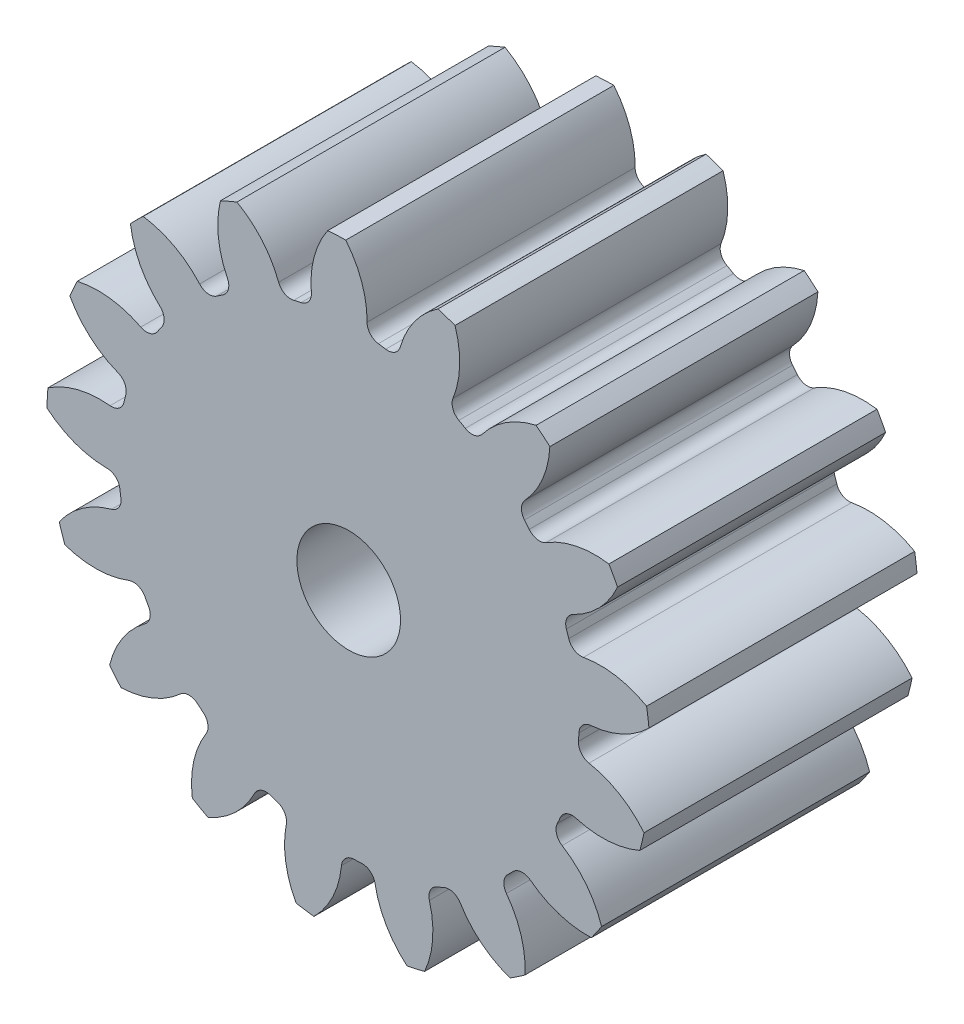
ISO-10303-21;
HEADER;
FILE_DESCRIPTION(('STEP AP214'),'2;1');
FILE_NAME('part.step','',(''),(''),'','','');
FILE_SCHEMA(('AUTOMOTIVE_DESIGN { 1 0 10303 214 1 1 1 1 }'));
ENDSEC;
DATA;
#1=APPLICATION_CONTEXT('core data for automotive mechanical design processes');
#2=APPLICATION_PROTOCOL_DEFINITION('international standard','automotive_design',2000,#1);
#3=PRODUCT_CONTEXT('',#1,'mechanical');
#4=PRODUCT('Part','Part','',(#3));
#5=PRODUCT_RELATED_PRODUCT_CATEGORY('part','',(#4));
#6=PRODUCT_DEFINITION_FORMATION('','',#4);
#7=PRODUCT_DEFINITION_CONTEXT('part definition',#1,'design');
#8=PRODUCT_DEFINITION('design','',#6,#7);
#9=PRODUCT_DEFINITION_SHAPE('','',#8);
#10=(LENGTH_UNIT() NAMED_UNIT(*) SI_UNIT(.MILLI.,.METRE.));
#11=(NAMED_UNIT(*) PLANE_ANGLE_UNIT() SI_UNIT($,.RADIAN.));
#12=(NAMED_UNIT(*) SI_UNIT($,.STERADIAN.) SOLID_ANGLE_UNIT());
#13=UNCERTAINTY_MEASURE_WITH_UNIT(LENGTH_MEASURE(1.E-05),#10,'distance_accuracy_value','');
#14=(GEOMETRIC_REPRESENTATION_CONTEXT(3) GLOBAL_UNCERTAINTY_ASSIGNED_CONTEXT((#13)) GLOBAL_UNIT_ASSIGNED_CONTEXT((#10,
#11,#12)) REPRESENTATION_CONTEXT('',''));
#15=CARTESIAN_POINT('',(0.,0.,0.));
#16=DIRECTION('',(0.,0.,1.));
#17=DIRECTION('',(1.,0.,0.));
#18=AXIS2_PLACEMENT_3D('',#15,#16,#17);
#19=CARTESIAN_POINT('',(0.,0.,95.25));
#20=DIRECTION('',(0.,0.,-1.));
#21=DIRECTION('',(-1.,0.,0.));
#22=AXIS2_PLACEMENT_3D('',#19,#20,#21);
#23=CYLINDRICAL_SURFACE('',#22,107.244444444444);
#24=DIRECTION('',(0.,0.,-1.));
#25=VECTOR('',#24,1.);
#26=CARTESIAN_POINT('',(105.844959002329,17.2689176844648,47.625));
#27=LINE('',#26,#25);
#28=CARTESIAN_POINT('',(105.844959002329,17.2689176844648,95.25));
#29=VERTEX_POINT('',#28);
#30=CARTESIAN_POINT('',(105.844959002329,17.2689176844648,0.));
#31=VERTEX_POINT('',#30);
#32=EDGE_CURVE('E708',#29,#31,#27,.T.);
#33=ORIENTED_EDGE('',*,*,#32,.F.);
#34=CARTESIAN_POINT('',(0.,0.,95.25));
#35=DIRECTION('',(0.,0.,1.));
#36=DIRECTION('',(1.,0.,0.));
#37=AXIS2_PLACEMENT_3D('',#34,#35,#36);
#38=CIRCLE('',#37,107.244444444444);
#39=CARTESIAN_POINT('',(106.685242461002,10.9375456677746,95.25));
#40=VERTEX_POINT('',#39);
#41=EDGE_CURVE('E1315',#40,#29,#38,.T.);
#42=ORIENTED_EDGE('',*,*,#41,.F.);
#43=DIRECTION('',(0.,0.,-1.));
#44=VECTOR('',#43,1.);
#45=CARTESIAN_POINT('',(106.685242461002,10.9375456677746,47.625));
#46=LINE('',#45,#44);
#47=CARTESIAN_POINT('',(106.685242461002,10.9375456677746,0.));
#48=VERTEX_POINT('',#47);
#49=EDGE_CURVE('E1309',#48,#40,#46,.F.);
#50=ORIENTED_EDGE('',*,*,#49,.F.);
#51=CARTESIAN_POINT('',(0.,0.,0.));
#52=DIRECTION('',(0.,0.,1.));
#53=DIRECTION('',(1.,0.,0.));
#54=AXIS2_PLACEMENT_3D('',#51,#52,#53);
#55=CIRCLE('',#54,107.244444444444);
#56=EDGE_CURVE('E1320',#48,#31,#55,.T.);
#57=ORIENTED_EDGE('',*,*,#56,.T.);
#58=EDGE_LOOP('',(#33,#42,#50,#57));
#59=FACE_BOUND('',#58,.T.);
#60=ADVANCED_FACE('F33',(#59),#23,.T.);
#61=DIRECTION('',(0.,0.,-1.));
#62=VECTOR('',#61,1.);
#63=CARTESIAN_POINT('',(95.5299286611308,48.7381123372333,47.625));
#64=LINE('',#63,#62);
#65=CARTESIAN_POINT('',(95.5299286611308,48.7381123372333,0.));
#66=VERTEX_POINT('',#65);
#67=CARTESIAN_POINT('',(95.5299286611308,48.7381123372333,95.25));
#68=VERTEX_POINT('',#67);
#69=EDGE_CURVE('E679',#66,#68,#64,.F.);
#70=ORIENTED_EDGE('',*,*,#69,.F.);
#71=CARTESIAN_POINT('',(92.4592322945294,54.3383955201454,0.));
#72=VERTEX_POINT('',#71);
#73=EDGE_CURVE('E1323',#66,#72,#55,.T.);
#74=ORIENTED_EDGE('',*,*,#73,.T.);
#75=DIRECTION('',(0.,0.,-1.));
#76=VECTOR('',#75,1.);
#77=CARTESIAN_POINT('',(92.4592322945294,54.3383955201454,47.625));
#78=LINE('',#77,#76);
#79=CARTESIAN_POINT('',(92.4592322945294,54.3383955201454,95.25));
#80=VERTEX_POINT('',#79);
#81=EDGE_CURVE('E741',#80,#72,#78,.T.);
#82=ORIENTED_EDGE('',*,*,#81,.F.);
#83=EDGE_CURVE('E1318',#68,#80,#38,.T.);
#84=ORIENTED_EDGE('',*,*,#83,.F.);
#85=EDGE_LOOP('',(#70,#74,#82,#84));
#86=FACE_BOUND('',#85,.T.);
#87=ADVANCED_FACE('F1516',(#86),#23,.T.);
#88=CARTESIAN_POINT('',(0.,0.,95.25));
#89=DIRECTION('',(0.,0.,1.));
#90=DIRECTION('',(1.,0.,0.));
#91=AXIS2_PLACEMENT_3D('',#88,#89,#90);
#92=PLANE('',#91);
#93=CARTESIAN_POINT('',(0.,0.,95.2500000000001));
#94=DIRECTION('',(0.,0.,1.));
#95=DIRECTION('',(1.,0.,0.));
#96=AXIS2_PLACEMENT_3D('',#93,#94,#95);
#97=CIRCLE('',#96,18.415);
#98=CARTESIAN_POINT('',(18.415,0.,95.2499999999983));
#99=VERTEX_POINT('',#98);
#100=EDGE_CURVE('E696',#99,#99,#97,.T.);
#101=ORIENTED_EDGE('',*,*,#100,.F.);
#102=EDGE_LOOP('',(#101));
#103=FACE_BOUND('',#102,.T.);
#104=ORIENTED_EDGE('',*,*,#41,.T.);
#105=CARTESIAN_POINT('',(89.4217625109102,-11.5822193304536,95.25));
#106=DIRECTION('',(0.,0.,-1.));
#107=DIRECTION('',(0.932472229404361,0.361241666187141,0.));
#108=AXIS2_PLACEMENT_3D('',#105,#106,#107);
#109=CIRCLE('',#108,33.1980344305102);
#110=CARTESIAN_POINT('',(83.399740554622,21.0650583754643,95.25));
#111=VERTEX_POINT('',#110);
#112=EDGE_CURVE('E688',#111,#29,#109,.T.);
#113=ORIENTED_EDGE('',*,*,#112,.F.);
#114=CARTESIAN_POINT('',(82.5662981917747,25.5834119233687,95.25));
#115=DIRECTION('',(0.,0.,1.));
#116=DIRECTION('',(-0.932472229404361,-0.361241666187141,0.));
#117=AXIS2_PLACEMENT_3D('',#114,#115,#116);
#118=CIRCLE('',#117,4.59457777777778);
#119=CARTESIAN_POINT('',(78.1775710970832,24.2235518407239,95.25));
#120=VERTEX_POINT('',#119);
#121=EDGE_CURVE('E686',#120,#111,#118,.T.);
#122=ORIENTED_EDGE('',*,*,#121,.F.);
#123=CARTESIAN_POINT('',(0.,0.,95.25));
#124=DIRECTION('',(0.,0.,-1.));
#125=DIRECTION('',(0.932472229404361,0.361241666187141,0.));
#126=AXIS2_PLACEMENT_3D('',#123,#124,#125);
#127=CIRCLE('',#126,81.8444444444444);
#128=CARTESIAN_POINT('',(77.3478550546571,26.7548575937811,95.25));
#129=VERTEX_POINT('',#128);
#130=EDGE_CURVE('E671',#129,#120,#127,.T.);
#131=ORIENTED_EDGE('',*,*,#130,.F.);
#132=CARTESIAN_POINT('',(81.6900036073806,28.2568199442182,95.25));
#133=DIRECTION('',(0.,0.,1.));
#134=DIRECTION('',(-0.932472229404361,-0.361241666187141,0.));
#135=AXIS2_PLACEMENT_3D('',#132,#133,#134);
#136=CIRCLE('',#135,4.59457777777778);
#137=CARTESIAN_POINT('',(79.6870327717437,32.3918233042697,95.25));
#138=VERTEX_POINT('',#137);
#139=EDGE_CURVE('E663',#138,#129,#136,.T.);
#140=ORIENTED_EDGE('',*,*,#139,.F.);
#141=CARTESIAN_POINT('',(65.2146050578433,62.2692115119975,95.25));
#142=DIRECTION('',(0.,0.,-1.));
#143=DIRECTION('',(-0.932472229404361,-0.361241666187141,0.));
#144=AXIS2_PLACEMENT_3D('',#141,#142,#143);
#145=CIRCLE('',#144,33.1980344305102);
#146=EDGE_CURVE('E693',#68,#138,#145,.T.);
#147=ORIENTED_EDGE('',*,*,#146,.F.);
#148=ORIENTED_EDGE('',*,*,#83,.T.);
#149=CARTESIAN_POINT('',(87.5672904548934,21.5027686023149,95.25));
#150=DIRECTION('',(0.,0.,-1.));
#151=DIRECTION('',(0.739008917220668,0.673695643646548,0.));
#152=AXIS2_PLACEMENT_3D('',#149,#150,#151);
#153=CIRCLE('',#152,33.1980344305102);
#154=CARTESIAN_POINT('',(70.1583652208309,49.77004318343,95.25));
#155=VERTEX_POINT('',#154);
#156=EDGE_CURVE('E717',#155,#80,#153,.T.);
#157=ORIENTED_EDGE('',*,*,#156,.F.);
#158=CARTESIAN_POINT('',(67.7489857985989,53.6822082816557,95.25));
#159=DIRECTION('',(0.,0.,1.));
#160=DIRECTION('',(-0.739008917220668,-0.673695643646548,0.));
#161=AXIS2_PLACEMENT_3D('',#158,#159,#160);
#162=CIRCLE('',#161,4.59457777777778);
#163=CARTESIAN_POINT('',(64.1478577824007,50.8287854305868,95.25));
#164=VERTEX_POINT('',#163);
#165=EDGE_CURVE('E715',#164,#155,#162,.T.);
#166=ORIENTED_EDGE('',*,*,#165,.F.);
#167=CARTESIAN_POINT('',(0.,0.,95.25));
#168=DIRECTION('',(0.,0.,-1.));
#169=DIRECTION('',(0.739008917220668,0.673695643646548,0.));
#170=AXIS2_PLACEMENT_3D('',#167,#168,#169);
#171=CIRCLE('',#170,81.8444444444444);
#172=CARTESIAN_POINT('',(62.4597575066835,52.8894297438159,95.25));
#173=VERTEX_POINT('',#172);
#174=EDGE_CURVE('E712',#173,#164,#171,.T.);
#175=ORIENTED_EDGE('',*,*,#174,.F.);
#176=CARTESIAN_POINT('',(65.9661190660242,55.8585329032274,95.25));
#177=DIRECTION('',(0.,0.,1.));
#178=DIRECTION('',(-0.739008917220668,-0.673695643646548,0.));
#179=AXIS2_PLACEMENT_3D('',#176,#177,#178);
#180=CIRCLE('',#179,4.59457777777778);
#181=CARTESIAN_POINT('',(62.6046688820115,58.9907521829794,95.25));
#182=VERTEX_POINT('',#181);
#183=EDGE_CURVE('E710',#182,#173,#180,.T.);
#184=ORIENTED_EDGE('',*,*,#183,.F.);
#185=CARTESIAN_POINT('',(38.3165744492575,81.6225430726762,95.25));
#186=DIRECTION('',(0.,0.,-1.));
#187=DIRECTION('',(-0.739008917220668,-0.673695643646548,0.));
#188=AXIS2_PLACEMENT_3D('',#185,#186,#187);
#189=CIRCLE('',#188,33.1980344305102);
#190=CARTESIAN_POINT('',(71.4727686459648,79.9563268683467,95.25));
#191=VERTEX_POINT('',#190);
#192=EDGE_CURVE('E720',#191,#182,#189,.T.);
#193=ORIENTED_EDGE('',*,*,#192,.F.);
#194=CARTESIAN_POINT('',(66.5863739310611,84.0691719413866,95.25));
#195=VERTEX_POINT('',#194);
#196=EDGE_CURVE('E1365',#191,#195,#38,.T.);
#197=ORIENTED_EDGE('',*,*,#196,.T.);
#198=CARTESIAN_POINT('',(73.8863705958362,51.6836884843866,95.25));
#199=DIRECTION('',(0.,0.,-1.));
#200=DIRECTION('',(0.445738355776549,0.895163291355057,0.));
#201=AXIS2_PLACEMENT_3D('',#198,#199,#200);
#202=CIRCLE('',#201,33.1980344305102);
#203=CARTESIAN_POINT('',(47.4417139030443,71.7533078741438,95.25));
#204=VERTEX_POINT('',#203);
#205=EDGE_CURVE('E752',#204,#195,#202,.T.);
#206=ORIENTED_EDGE('',*,*,#205,.F.);
#207=CARTESIAN_POINT('',(43.7817974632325,74.5309249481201,95.25));
#208=DIRECTION('',(0.,0.,1.));
#209=DIRECTION('',(-0.445738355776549,-0.895163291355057,0.));
#210=AXIS2_PLACEMENT_3D('',#207,#208,#209);
#211=CIRCLE('',#210,4.59457777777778);
#212=CARTESIAN_POINT('',(41.4546208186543,70.5693098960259,95.25));
#213=VERTEX_POINT('',#212);
#214=EDGE_CURVE('E750',#213,#204,#211,.T.);
#215=ORIENTED_EDGE('',*,*,#214,.F.);
#216=CARTESIAN_POINT('',(0.,0.,95.25));
#217=DIRECTION('',(0.,0.,-1.));
#218=DIRECTION('',(0.445738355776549,0.895163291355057,0.));
#219=AXIS2_PLACEMENT_3D('',#216,#217,#218);
#220=CIRCLE('',#219,81.8444444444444);
#221=CARTESIAN_POINT('',(39.1361236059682,71.8809913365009,95.25));
#222=VERTEX_POINT('',#221);
#223=EDGE_CURVE('E747',#222,#213,#220,.T.);
#224=ORIENTED_EDGE('',*,*,#223,.F.);
#225=CARTESIAN_POINT('',(41.333144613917,75.9162414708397,95.25));
#226=DIRECTION('',(0.,0.,1.));
#227=DIRECTION('',(-0.445738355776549,-0.895163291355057,0.));
#228=AXIS2_PLACEMENT_3D('',#225,#226,#227);
#229=CIRCLE('',#228,4.59457777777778);
#230=CARTESIAN_POINT('',(37.0671975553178,77.6226531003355,95.25));
#231=VERTEX_POINT('',#230);
#232=EDGE_CURVE('E745',#231,#222,#229,.T.);
#233=ORIENTED_EDGE('',*,*,#232,.F.);
#234=CARTESIAN_POINT('',(6.24367814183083,89.9522979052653,95.25));
#235=DIRECTION('',(0.,0.,-1.));
#236=DIRECTION('',(-0.445738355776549,-0.895163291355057,0.));
#237=AXIS2_PLACEMENT_3D('',#234,#235,#236);
#238=CIRCLE('',#237,33.1980344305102);
#239=CARTESIAN_POINT('',(37.7628151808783,100.375996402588,95.25));
#240=VERTEX_POINT('',#239);
#241=EDGE_CURVE('E755',#240,#231,#238,.T.);
#242=ORIENTED_EDGE('',*,*,#241,.F.);
#243=CARTESIAN_POINT('',(31.7206568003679,102.44594084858,95.25));
#244=VERTEX_POINT('',#243);
#245=EDGE_CURVE('E1498',#240,#244,#38,.T.);
#246=ORIENTED_EDGE('',*,*,#245,.T.);
#247=CARTESIAN_POINT('',(50.2266869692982,74.8844398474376,95.25));
#248=DIRECTION('',(0.,0.,-1.));
#249=DIRECTION('',(0.092268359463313,0.995734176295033,0.));
#250=AXIS2_PLACEMENT_3D('',#247,#248,#249);
#251=CIRCLE('',#250,33.1980344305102);
#252=CARTESIAN_POINT('',(18.3177962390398,84.04589073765,95.25));
#253=VERTEX_POINT('',#252);
#254=EDGE_CURVE('E790',#253,#244,#251,.T.);
#255=ORIENTED_EDGE('',*,*,#254,.F.);
#256=CARTESIAN_POINT('',(13.9016347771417,85.3138272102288,95.25));
#257=DIRECTION('',(0.,0.,1.));
#258=DIRECTION('',(-0.092268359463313,-0.995734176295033,0.));
#259=AXIS2_PLACEMENT_3D('',#256,#257,#258);
#260=CIRCLE('',#259,4.59457777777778);
#261=CARTESIAN_POINT('',(13.1627076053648,80.7790580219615,95.25));
#262=VERTEX_POINT('',#261);
#263=EDGE_CURVE('E788',#262,#253,#260,.T.);
#264=ORIENTED_EDGE('',*,*,#263,.F.);
#265=CARTESIAN_POINT('',(0.,0.,95.25));
#266=DIRECTION('',(0.,0.,-1.));
#267=DIRECTION('',(0.092268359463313,0.995734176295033,0.));
#268=AXIS2_PLACEMENT_3D('',#265,#266,#267);
#269=CIRCLE('',#268,81.8444444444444);
#270=CARTESIAN_POINT('',(10.5269393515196,81.1646267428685,95.25));
#271=VERTEX_POINT('',#270);
#272=EDGE_CURVE('E785',#271,#262,#269,.T.);
#273=ORIENTED_EDGE('',*,*,#272,.F.);
#274=CARTESIAN_POINT('',(11.1178999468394,85.7210409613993,95.25));
#275=DIRECTION('',(0.,0.,1.));
#276=DIRECTION('',(-0.092268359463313,-0.995734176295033,0.));
#277=AXIS2_PLACEMENT_3D('',#274,#275,#276);
#278=CIRCLE('',#277,4.59457777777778);
#279=CARTESIAN_POINT('',(6.52359580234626,85.7711845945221,95.25));
#280=VERTEX_POINT('',#279);
#281=EDGE_CURVE('E783',#280,#271,#278,.T.);
#282=ORIENTED_EDGE('',*,*,#281,.F.);
#283=CARTESIAN_POINT('',(-26.672461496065,86.1334964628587,95.25));
#284=DIRECTION('',(0.,0.,-1.));
#285=DIRECTION('',(-0.092268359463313,-0.995734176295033,0.));
#286=AXIS2_PLACEMENT_3D('',#283,#284,#285);
#287=CIRCLE('',#286,33.1980344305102);
#288=CARTESIAN_POINT('',(-1.04721572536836,107.239331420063,95.25));
#289=VERTEX_POINT('',#288);
#290=EDGE_CURVE('E793',#289,#280,#287,.T.);
#291=ORIENTED_EDGE('',*,*,#290,.F.);
#292=CARTESIAN_POINT('',(-7.42911080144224,106.986817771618,95.25));
#293=VERTEX_POINT('',#292);
#294=EDGE_CURVE('E1494',#289,#293,#38,.T.);
#295=ORIENTED_EDGE('',*,*,#294,.T.);
#296=CARTESIAN_POINT('',(19.7836109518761,87.9716326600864,95.25));
#297=DIRECTION('',(0.,0.,-1.));
#298=DIRECTION('',(-0.273662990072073,0.961825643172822,0.));
#299=AXIS2_PLACEMENT_3D('',#296,#297,#298);
#300=CIRCLE('',#299,33.1980344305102);
#301=CARTESIAN_POINT('',(-13.28004130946,84.9876103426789,95.25));
#302=VERTEX_POINT('',#301);
#303=EDGE_CURVE('E828',#302,#293,#300,.T.);
#304=ORIENTED_EDGE('',*,*,#303,.F.);
#305=CARTESIAN_POINT('',(-17.8560207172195,84.57462436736,95.25));
#306=DIRECTION('',(0.,0.,1.));
#307=DIRECTION('',(0.273662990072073,-0.961825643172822,0.));
#308=AXIS2_PLACEMENT_3D('',#305,#306,#307);
#309=CIRCLE('',#308,4.59457777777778);
#310=CARTESIAN_POINT('',(-16.90690220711,80.0791467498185,95.25));
#311=VERTEX_POINT('',#310);
#312=EDGE_CURVE('E826',#311,#302,#309,.T.);
#313=ORIENTED_EDGE('',*,*,#312,.F.);
#314=CARTESIAN_POINT('',(0.,0.,95.25));
#315=DIRECTION('',(0.,0.,-1.));
#316=DIRECTION('',(-0.273662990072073,0.961825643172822,0.));
#317=AXIS2_PLACEMENT_3D('',#314,#315,#316);
#318=CIRCLE('',#317,81.8444444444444);
#319=CARTESIAN_POINT('',(-19.5039663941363,79.4865295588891,95.25));
#320=VERTEX_POINT('',#319);
#321=EDGE_CURVE('E823',#320,#311,#318,.T.);
#322=ORIENTED_EDGE('',*,*,#321,.F.);
#323=CARTESIAN_POINT('',(-20.5988787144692,83.9487388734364,95.25));
#324=DIRECTION('',(0.,0.,1.));
#325=DIRECTION('',(0.273662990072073,-0.961825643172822,0.));
#326=AXIS2_PLACEMENT_3D('',#323,#324,#325);
#327=CIRCLE('',#326,4.59457777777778);
#328=CARTESIAN_POINT('',(-24.9010537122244,82.3358423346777,95.25));
#329=VERTEX_POINT('',#328);
#330=EDGE_CURVE('E821',#329,#320,#327,.T.);
#331=ORIENTED_EDGE('',*,*,#330,.F.);
#332=CARTESIAN_POINT('',(-55.986337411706,70.6818890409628,95.25));
#333=DIRECTION('',(0.,0.,-1.));
#334=DIRECTION('',(0.273662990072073,-0.961825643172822,0.));
#335=AXIS2_PLACEMENT_3D('',#332,#333,#334);
#336=CIRCLE('',#335,33.1980344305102);
#337=CARTESIAN_POINT('',(-39.7158143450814,99.619400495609,95.25));
#338=VERTEX_POINT('',#337);
#339=EDGE_CURVE('E831',#338,#329,#336,.T.);
#340=ORIENTED_EDGE('',*,*,#339,.F.);
#341=CARTESIAN_POINT('',(-45.5755358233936,97.0785321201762,95.25));
#342=VERTEX_POINT('',#341);
#343=EDGE_CURVE('E1490',#338,#342,#38,.T.);
#344=ORIENTED_EDGE('',*,*,#343,.T.);
#345=CARTESIAN_POINT('',(-13.3313513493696,89.1777690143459,95.25));
#346=DIRECTION('',(0.,0.,-1.));
#347=DIRECTION('',(-0.602634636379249,0.798017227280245,0.));
#348=AXIS2_PLACEMENT_3D('',#345,#346,#347);
#349=CIRCLE('',#348,33.1980344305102);
#350=CARTESIAN_POINT('',(-43.084335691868,74.4512822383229,95.25));
#351=VERTEX_POINT('',#350);
#352=EDGE_CURVE('E866',#351,#342,#349,.T.);
#353=ORIENTED_EDGE('',*,*,#352,.F.);
#354=CARTESIAN_POINT('',(-47.2021216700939,72.4131498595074,95.25));
#355=DIRECTION('',(0.,0.,1.));
#356=DIRECTION('',(0.602634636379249,-0.798017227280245,0.));
#357=AXIS2_PLACEMENT_3D('',#354,#355,#356);
#358=CIRCLE('',#357,4.59457777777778);
#359=CARTESIAN_POINT('',(-44.6931411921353,68.5641029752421,95.25));
#360=VERTEX_POINT('',#359);
#361=EDGE_CURVE('E864',#360,#351,#358,.T.);
#362=ORIENTED_EDGE('',*,*,#361,.F.);
#363=CARTESIAN_POINT('',(0.,0.,95.25));
#364=DIRECTION('',(0.,0.,-1.));
#365=DIRECTION('',(-0.602634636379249,0.798017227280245,0.));
#366=AXIS2_PLACEMENT_3D('',#363,#364,#365);
#367=CIRCLE('',#366,81.8444444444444);
#368=CARTESIAN_POINT('',(-46.9007534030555,67.0733361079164,95.25));
#369=VERTEX_POINT('',#368);
#370=EDGE_CURVE('E861',#369,#360,#367,.T.);
#371=ORIENTED_EDGE('',*,*,#370,.F.);
#372=CARTESIAN_POINT('',(-49.5336646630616,70.8386944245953,95.25));
#373=DIRECTION('',(0.,0.,1.));
#374=DIRECTION('',(0.602634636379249,-0.798017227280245,0.));
#375=AXIS2_PLACEMENT_3D('',#372,#373,#374);
#376=CIRCLE('',#375,4.59457777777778);
#377=CARTESIAN_POINT('',(-52.9626779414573,67.7805883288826,95.25));
#378=VERTEX_POINT('',#377);
#379=EDGE_CURVE('E859',#378,#369,#376,.T.);
#380=ORIENTED_EDGE('',*,*,#379,.F.);
#381=CARTESIAN_POINT('',(-77.7389482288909,45.684300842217,95.25));
#382=DIRECTION('',(0.,0.,-1.));
#383=DIRECTION('',(0.602634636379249,-0.798017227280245,0.));
#384=AXIS2_PLACEMENT_3D('',#381,#382,#383);
#385=CIRCLE('',#384,33.1980344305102);
#386=CARTESIAN_POINT('',(-73.0205721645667,78.545317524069,95.25));
#387=VERTEX_POINT('',#386);
#388=EDGE_CURVE('E869',#387,#378,#385,.T.);
#389=ORIENTED_EDGE('',*,*,#388,.F.);
#390=CARTESIAN_POINT('',(-77.5667321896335,74.059252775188,95.25));
#391=VERTEX_POINT('',#390);
#392=EDGE_CURVE('E1486',#387,#391,#38,.T.);
#393=ORIENTED_EDGE('',*,*,#392,.T.);
#394=CARTESIAN_POINT('',(-44.6458407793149,78.3399535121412,95.25));
#395=DIRECTION('',(0.,0.,-1.));
#396=DIRECTION('',(-0.85021713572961,0.526432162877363,0.));
#397=AXIS2_PLACEMENT_3D('',#394,#395,#396);
#398=CIRCLE('',#397,33.1980344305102);
#399=CARTESIAN_POINT('',(-67.0698518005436,53.8598959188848,95.25));
#400=VERTEX_POINT('',#399);
#401=EDGE_CURVE('E904',#400,#391,#398,.T.);
#402=ORIENTED_EDGE('',*,*,#401,.F.);
#403=CARTESIAN_POINT('',(-70.1733145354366,50.4718782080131,95.25));
#404=DIRECTION('',(0.,0.,1.));
#405=DIRECTION('',(0.85021713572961,-0.526432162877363,0.));
#406=AXIS2_PLACEMENT_3D('',#403,#404,#405);
#407=CIRCLE('',#406,4.59457777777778);
#408=CARTESIAN_POINT('',(-66.4433238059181,47.7890971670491,95.25));
#409=VERTEX_POINT('',#408);
#410=EDGE_CURVE('E902',#409,#400,#407,.T.);
#411=ORIENTED_EDGE('',*,*,#410,.F.);
#412=CARTESIAN_POINT('',(0.,0.,95.25));
#413=DIRECTION('',(0.,0.,-1.));
#414=DIRECTION('',(-0.85021713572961,0.526432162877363,0.));
#415=AXIS2_PLACEMENT_3D('',#412,#413,#414);
#416=CIRCLE('',#415,81.8444444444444);
#417=CARTESIAN_POINT('',(-67.9633337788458,45.6015169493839,95.25));
#418=VERTEX_POINT('',#417);
#419=EDGE_CURVE('E899',#418,#409,#416,.T.);
#420=ORIENTED_EDGE('',*,*,#419,.F.);
#421=CARTESIAN_POINT('',(-71.7786547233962,48.1614917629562,95.25));
#422=DIRECTION('',(0.,0.,1.));
#423=DIRECTION('',(0.85021713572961,-0.526432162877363,0.));
#424=AXIS2_PLACEMENT_3D('',#421,#422,#423);
#425=CIRCLE('',#424,4.59457777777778);
#426=CARTESIAN_POINT('',(-73.8713990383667,44.0711902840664,95.25));
#427=VERTEX_POINT('',#426);
#428=EDGE_CURVE('E897',#427,#418,#425,.T.);
#429=ORIENTED_EDGE('',*,*,#428,.F.);
#430=CARTESIAN_POINT('',(-88.9924833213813,14.5167946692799,95.25));
#431=DIRECTION('',(0.,0.,-1.));
#432=DIRECTION('',(0.85021713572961,-0.526432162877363,0.));
#433=AXIS2_PLACEMENT_3D('',#430,#431,#432);
#434=CIRCLE('',#433,33.1980344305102);
#435=CARTESIAN_POINT('',(-96.4634970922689,46.8632541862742,95.25));
#436=VERTEX_POINT('',#435);
#437=EDGE_CURVE('E907',#436,#427,#434,.T.);
#438=ORIENTED_EDGE('',*,*,#437,.F.);
#439=CARTESIAN_POINT('',(-99.0821115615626,41.0378609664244,95.25));
#440=VERTEX_POINT('',#439);
#441=EDGE_CURVE('E1482',#436,#440,#38,.T.);
#442=ORIENTED_EDGE('',*,*,#441,.T.);
#443=CARTESIAN_POINT('',(-69.9306620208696,56.9218931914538,95.25));
#444=DIRECTION('',(0.,0.,-1.));
#445=DIRECTION('',(-0.9829730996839,0.183749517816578,0.));
#446=AXIS2_PLACEMENT_3D('',#443,#444,#445);
#447=CIRCLE('',#446,33.1980344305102);
#448=CARTESIAN_POINT('',(-81.9972127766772,25.9944322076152,95.25));
#449=VERTEX_POINT('',#448);
#450=EDGE_CURVE('E942',#449,#440,#447,.T.);
#451=ORIENTED_EDGE('',*,*,#450,.F.);
#452=CARTESIAN_POINT('',(-83.6672124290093,21.7140997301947,95.25));
#453=DIRECTION('',(0.,0.,1.));
#454=DIRECTION('',(0.9829730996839,-0.183749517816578,0.));
#455=AXIS2_PLACEMENT_3D('',#452,#453,#454);
#456=CIRCLE('',#455,4.59457777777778);
#457=CARTESIAN_POINT('',(-79.2199673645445,20.5599089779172,95.25));
#458=VERTEX_POINT('',#457);
#459=EDGE_CURVE('E940',#458,#449,#456,.T.);
#460=ORIENTED_EDGE('',*,*,#459,.F.);
#461=CARTESIAN_POINT('',(0.,0.,95.25));
#462=DIRECTION('',(0.,0.,-1.));
#463=DIRECTION('',(-0.9829730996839,0.183749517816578,0.));
#464=AXIS2_PLACEMENT_3D('',#461,#462,#463);
#465=CIRCLE('',#464,81.8444444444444);
#466=CARTESIAN_POINT('',(-79.8470893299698,17.9709602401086,95.25));
#467=VERTEX_POINT('',#466);
#468=EDGE_CURVE('E937',#467,#458,#465,.T.);
#469=ORIENTED_EDGE('',*,*,#468,.F.);
#470=CARTESIAN_POINT('',(-84.3295397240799,18.9798127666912,95.25));
#471=DIRECTION('',(0.,0.,1.));
#472=DIRECTION('',(0.9829730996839,-0.183749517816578,0.));
#473=AXIS2_PLACEMENT_3D('',#470,#471,#472);
#474=CIRCLE('',#473,4.59457777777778);
#475=CARTESIAN_POINT('',(-84.8033783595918,14.4097337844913,95.25));
#476=VERTEX_POINT('',#475);
#477=EDGE_CURVE('E935',#476,#467,#474,.T.);
#478=ORIENTED_EDGE('',*,*,#477,.F.);
#479=CARTESIAN_POINT('',(-88.2270904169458,-18.6112850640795,95.25));
#480=DIRECTION('',(0.,0.,-1.));
#481=DIRECTION('',(0.9829730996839,-0.183749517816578,0.));
#482=AXIS2_PLACEMENT_3D('',#479,#480,#481);
#483=CIRCLE('',#482,33.1980344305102);
#484=CARTESIAN_POINT('',(-106.87849221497,8.85204869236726,95.25));
#485=VERTEX_POINT('',#484);
#486=EDGE_CURVE('E945',#485,#476,#483,.T.);
#487=ORIENTED_EDGE('',*,*,#486,.F.);
#488=CARTESIAN_POINT('',(-107.215902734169,2.47407863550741,95.25));
#489=VERTEX_POINT('',#488);
#490=EDGE_CURVE('E1478',#485,#489,#38,.T.);
#491=ORIENTED_EDGE('',*,*,#490,.T.);
#492=CARTESIAN_POINT('',(-85.7709598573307,27.8162157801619,95.25));
#493=DIRECTION('',(0.,0.,-1.));
#494=DIRECTION('',(-0.982973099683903,-0.183749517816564,0.));
#495=AXIS2_PLACEMENT_3D('',#492,#493,#494);
#496=CIRCLE('',#495,33.1980344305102);
#497=CARTESIAN_POINT('',(-85.8503958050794,-5.38172361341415,95.25));
#498=VERTEX_POINT('',#497);
#499=EDGE_CURVE('E980',#498,#489,#496,.T.);
#500=ORIENTED_EDGE('',*,*,#499,.F.);
#501=CARTESIAN_POINT('',(-85.8613896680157,-9.97628823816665,95.25));
#502=DIRECTION('',(0.,0.,1.));
#503=DIRECTION('',(0.982973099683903,0.183749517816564,0.));
#504=AXIS2_PLACEMENT_3D('',#501,#502,#503);
#505=CIRCLE('',#504,4.59457777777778);
#506=CARTESIAN_POINT('',(-81.2975153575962,-9.44600884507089,95.25));
#507=VERTEX_POINT('',#506);
#508=EDGE_CURVE('E978',#507,#498,#505,.T.);
#509=ORIENTED_EDGE('',*,*,#508,.F.);
#510=CARTESIAN_POINT('',(0.,0.,95.25));
#511=DIRECTION('',(0.,0.,-1.));
#512=DIRECTION('',(-0.982973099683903,-0.183749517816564,0.));
#513=AXIS2_PLACEMENT_3D('',#510,#511,#512);
#514=CIRCLE('',#513,81.8444444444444);
#515=CARTESIAN_POINT('',(-80.9470530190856,-12.0866742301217,95.25));
#516=VERTEX_POINT('',#515);
#517=EDGE_CURVE('E975',#516,#507,#514,.T.);
#518=ORIENTED_EDGE('',*,*,#517,.F.);
#519=CARTESIAN_POINT('',(-85.4912530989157,-12.7651951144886,95.25));
#520=DIRECTION('',(0.,0.,1.));
#521=DIRECTION('',(0.982973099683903,0.183749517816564,0.));
#522=AXIS2_PLACEMENT_3D('',#519,#520,#521);
#523=CIRCLE('',#522,4.59457777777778);
#524=CARTESIAN_POINT('',(-84.2821915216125,-17.1978371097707,95.25));
#525=VERTEX_POINT('',#524);
#526=EDGE_CURVE('E973',#525,#516,#523,.T.);
#527=ORIENTED_EDGE('',*,*,#526,.F.);
#528=CARTESIAN_POINT('',(-75.546140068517,-49.2258076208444,95.25));
#529=DIRECTION('',(0.,0.,-1.));
#530=DIRECTION('',(0.982973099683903,0.183749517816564,0.));
#531=AXIS2_PLACEMENT_3D('',#528,#529,#530);
#532=CIRCLE('',#531,33.1980344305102);
#533=CARTESIAN_POINT('',(-102.85895472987,-30.354675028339,95.25));
#534=VERTEX_POINT('',#533);
#535=EDGE_CURVE('E983',#534,#525,#532,.T.);
#536=ORIENTED_EDGE('',*,*,#535,.F.);
#537=CARTESIAN_POINT('',(-100.8695921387,-36.4238417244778,95.25));
#538=VERTEX_POINT('',#537);
#539=EDGE_CURVE('E1474',#534,#538,#38,.T.);
#540=ORIENTED_EDGE('',*,*,#539,.T.);
#541=CARTESIAN_POINT('',(-90.0274142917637,-5.04619570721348,95.25));
#542=DIRECTION('',(0.,0.,-1.));
#543=DIRECTION('',(-0.850217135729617,-0.526432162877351,0.));
#544=AXIS2_PLACEMENT_3D('',#541,#542,#543);
#545=CIRCLE('',#544,33.1980344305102);
#546=CARTESIAN_POINT('',(-78.1090071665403,-36.0310478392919,95.25));
#547=VERTEX_POINT('',#546);
#548=EDGE_CURVE('E1018',#547,#538,#545,.T.);
#549=ORIENTED_EDGE('',*,*,#548,.F.);
#550=CARTESIAN_POINT('',(-76.4595104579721,-40.3193231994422,95.25));
#551=DIRECTION('',(0.,0.,1.));
#552=DIRECTION('',(0.850217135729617,0.526432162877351,0.));
#553=AXIS2_PLACEMENT_3D('',#550,#551,#552);
#554=CIRCLE('',#553,4.59457777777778);
#555=CARTESIAN_POINT('',(-72.3953834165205,-38.1761908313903,95.25));
#556=VERTEX_POINT('',#555);
#557=EDGE_CURVE('E1016',#556,#547,#554,.T.);
#558=ORIENTED_EDGE('',*,*,#557,.F.);
#559=CARTESIAN_POINT('',(0.,0.,95.25));
#560=DIRECTION('',(0.,0.,-1.));
#561=DIRECTION('',(-0.850217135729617,-0.526432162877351,0.));
#562=AXIS2_PLACEMENT_3D('',#559,#560,#561);
#563=CIRCLE('',#562,81.8444444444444);
#564=CARTESIAN_POINT('',(-71.1146686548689,-40.5119363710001,95.25));
#565=VERTEX_POINT('',#564);
#566=EDGE_CURVE('E1013',#565,#556,#563,.T.);
#567=ORIENTED_EDGE('',*,*,#566,.F.);
#568=CARTESIAN_POINT('',(-75.106899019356,-42.7861926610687,95.25));
#569=DIRECTION('',(0.,0.,1.));
#570=DIRECTION('',(0.850217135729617,0.526432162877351,0.));
#571=AXIS2_PLACEMENT_3D('',#568,#569,#570);
#572=CIRCLE('',#571,4.59457777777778);
#573=CARTESIAN_POINT('',(-72.3782276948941,-46.4827448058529,95.25));
#574=VERTEX_POINT('',#573);
#575=EDGE_CURVE('E1011',#574,#565,#572,.T.);
#576=ORIENTED_EDGE('',*,*,#575,.F.);
#577=CARTESIAN_POINT('',(-52.6622648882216,-73.1921120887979,95.25));
#578=DIRECTION('',(0.,0.,-1.));
#579=DIRECTION('',(0.850217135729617,0.526432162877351,0.));
#580=AXIS2_PLACEMENT_3D('',#577,#578,#579);
#581=CIRCLE('',#580,33.1980344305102);
#582=CARTESIAN_POINT('',(-84.9477454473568,-65.4618316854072,95.25));
#583=VERTEX_POINT('',#582);
#584=EDGE_CURVE('E1021',#583,#574,#581,.T.);
#585=ORIENTED_EDGE('',*,*,#584,.F.);
#586=CARTESIAN_POINT('',(-80.9002841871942,-70.4025204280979,95.25));
#587=VERTEX_POINT('',#586);
#588=EDGE_CURVE('E1470',#583,#587,#38,.T.);
#589=ORIENTED_EDGE('',*,*,#588,.T.);
#590=CARTESIAN_POINT('',(-82.1251675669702,-37.2270905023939,95.25));
#591=DIRECTION('',(0.,0.,-1.));
#592=DIRECTION('',(-0.602634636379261,-0.798017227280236,0.));
#593=AXIS2_PLACEMENT_3D('',#590,#591,#592);
#594=CIRCLE('',#593,33.1980344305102);
#595=CARTESIAN_POINT('',(-59.8185642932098,-61.8141793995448,95.25));
#596=VERTEX_POINT('',#595);
#597=EDGE_CURVE('E1056',#596,#587,#594,.T.);
#598=ORIENTED_EDGE('',*,*,#597,.F.);
#599=CARTESIAN_POINT('',(-56.731350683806,-65.2170101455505,95.25));
#600=DIRECTION('',(0.,0.,1.));
#601=DIRECTION('',(0.602634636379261,0.798017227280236,0.));
#602=AXIS2_PLACEMENT_3D('',#599,#600,#601);
#603=CIRCLE('',#602,4.59457777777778);
#604=CARTESIAN_POINT('',(-53.7158537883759,-61.7504667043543,95.25));
#605=VERTEX_POINT('',#604);
#606=EDGE_CURVE('E1054',#605,#596,#603,.T.);
#607=ORIENTED_EDGE('',*,*,#606,.F.);
#608=CARTESIAN_POINT('',(0.,0.,95.25));
#609=DIRECTION('',(0.,0.,-1.));
#610=DIRECTION('',(-0.602634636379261,-0.798017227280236,0.));
#611=AXIS2_PLACEMENT_3D('',#608,#609,#610);
#612=CIRCLE('',#611,81.8444444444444);
#613=CARTESIAN_POINT('',(-51.6778542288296,-63.465837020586,95.25));
#614=VERTEX_POINT('',#613);
#615=EDGE_CURVE('E1051',#614,#605,#612,.T.);
#616=ORIENTED_EDGE('',*,*,#615,.F.);
#617=CARTESIAN_POINT('',(-54.5789420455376,-67.0286778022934,95.25));
#618=DIRECTION('',(0.,0.,1.));
#619=DIRECTION('',(0.602634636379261,0.798017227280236,0.));
#620=AXIS2_PLACEMENT_3D('',#617,#618,#619);
#621=CIRCLE('',#620,4.59457777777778);
#622=CARTESIAN_POINT('',(-50.6991831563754,-69.4899002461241,95.25));
#623=VERTEX_POINT('',#622);
#624=EDGE_CURVE('E1049',#623,#614,#621,.T.);
#625=ORIENTED_EDGE('',*,*,#624,.F.);
#626=CARTESIAN_POINT('',(-22.6660590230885,-87.2734162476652,95.25));
#627=DIRECTION('',(0.,0.,-1.));
#628=DIRECTION('',(0.602634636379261,0.798017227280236,0.));
#629=AXIS2_PLACEMENT_3D('',#626,#627,#628);
#630=CIRCLE('',#629,33.1980344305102);
#631=CARTESIAN_POINT('',(-55.563872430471,-91.7280052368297,95.25));
#632=VERTEX_POINT('',#631);
#633=EDGE_CURVE('E1059',#632,#623,#630,.T.);
#634=ORIENTED_EDGE('',*,*,#633,.F.);
#635=CARTESIAN_POINT('',(-50.0049445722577,-94.8729486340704,95.25));
#636=VERTEX_POINT('',#635);
#637=EDGE_CURVE('E1466',#632,#636,#38,.T.);
#638=ORIENTED_EDGE('',*,*,#637,.T.);
#639=CARTESIAN_POINT('',(-63.1314618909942,-64.3802604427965,95.25));
#640=DIRECTION('',(0.,0.,-1.));
#641=DIRECTION('',(-0.273662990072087,-0.961825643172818,0.));
#642=AXIS2_PLACEMENT_3D('',#639,#640,#641);
#643=CIRCLE('',#642,33.1980344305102);
#644=CARTESIAN_POINT('',(-33.4492928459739,-79.2489635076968,95.25));
#645=VERTEX_POINT('',#644);
#646=EDGE_CURVE('E1094',#645,#636,#643,.T.);
#647=ORIENTED_EDGE('',*,*,#646,.F.);
#648=CARTESIAN_POINT('',(-29.3413076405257,-81.3067784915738,95.25));
#649=DIRECTION('',(0.,0.,1.));
#650=DIRECTION('',(0.273662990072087,0.961825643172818,0.));
#651=AXIS2_PLACEMENT_3D('',#648,#649,#650);
#652=CIRCLE('',#651,4.59457777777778);
#653=CARTESIAN_POINT('',(-27.7817004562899,-76.9849998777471,95.25));
#654=VERTEX_POINT('',#653);
#655=EDGE_CURVE('E1092',#654,#645,#652,.T.);
#656=ORIENTED_EDGE('',*,*,#655,.F.);
#657=CARTESIAN_POINT('',(0.,0.,95.25));
#658=DIRECTION('',(0.,0.,-1.));
#659=DIRECTION('',(-0.273662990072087,-0.961825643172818,0.));
#660=AXIS2_PLACEMENT_3D('',#657,#658,#659);
#661=CIRCLE('',#660,81.8444444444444);
#662=CARTESIAN_POINT('',(-25.2616592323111,-77.8483247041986,95.25));
#663=VERTEX_POINT('',#662);
#664=EDGE_CURVE('E1089',#663,#654,#661,.T.);
#665=ORIENTED_EDGE('',*,*,#664,.F.);
#666=CARTESIAN_POINT('',(-26.6797965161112,-82.2185685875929,95.25));
#667=DIRECTION('',(0.,0.,1.));
#668=DIRECTION('',(0.273662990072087,0.961825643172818,0.));
#669=AXIS2_PLACEMENT_3D('',#666,#667,#668);
#670=CIRCLE('',#669,4.59457777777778);
#671=CARTESIAN_POINT('',(-22.1729329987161,-83.1120596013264,95.25));
#672=VERTEX_POINT('',#671);
#673=EDGE_CURVE('E1087',#672,#663,#670,.T.);
#674=ORIENTED_EDGE('',*,*,#673,.F.);
#675=CARTESIAN_POINT('',(10.3913237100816,-89.5679619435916,95.25));
#676=DIRECTION('',(0.,0.,-1.));
#677=DIRECTION('',(0.273662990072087,0.961825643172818,0.));
#678=AXIS2_PLACEMENT_3D('',#675,#676,#677);
#679=CIRCLE('',#678,33.1980344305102);
#680=CARTESIAN_POINT('',(-18.6757905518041,-105.605803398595,95.25));
#681=VERTEX_POINT('',#680);
#682=EDGE_CURVE('E1097',#681,#672,#679,.T.);
#683=ORIENTED_EDGE('',*,*,#682,.F.);
#684=CARTESIAN_POINT('',(-12.3561601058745,-106.530259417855,95.25));
#685=VERTEX_POINT('',#684);
#686=EDGE_CURVE('E1462',#681,#685,#38,.T.);
#687=ORIENTED_EDGE('',*,*,#686,.T.);
#688=CARTESIAN_POINT('',(-35.6115024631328,-82.8385194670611,95.25));
#689=DIRECTION('',(0.,0.,-1.));
#690=DIRECTION('',(0.0922683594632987,-0.995734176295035,0.));
#691=AXIS2_PLACEMENT_3D('',#688,#689,#690);
#692=CIRCLE('',#691,33.1980344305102);
#693=CARTESIAN_POINT('',(-2.56250905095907,-85.9807359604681,95.25));
#694=VERTEX_POINT('',#693);
#695=EDGE_CURVE('E1132',#694,#685,#692,.T.);
#696=ORIENTED_EDGE('',*,*,#695,.F.);
#697=CARTESIAN_POINT('',(2.01144158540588,-86.4156158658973,95.25));
#698=DIRECTION('',(0.,0.,1.));
#699=DIRECTION('',(-0.0922683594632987,0.995734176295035,0.));
#700=AXIS2_PLACEMENT_3D('',#697,#698,#699);
#701=CIRCLE('',#700,4.59457777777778);
#702=CARTESIAN_POINT('',(1.90452546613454,-81.8222822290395,95.25));
#703=VERTEX_POINT('',#702);
#704=EDGE_CURVE('E1130',#703,#694,#701,.T.);
#705=ORIENTED_EDGE('',*,*,#704,.F.);
#706=CARTESIAN_POINT('',(0.,0.,95.25));
#707=DIRECTION('',(0.,0.,-1.));
#708=DIRECTION('',(0.0922683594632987,-0.995734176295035,0.));
#709=AXIS2_PLACEMENT_3D('',#706,#707,#708);
#710=CIRCLE('',#709,81.8444444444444);
#711=CARTESIAN_POINT('',(4.56626282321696,-81.7169647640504,95.25));
#712=VERTEX_POINT('',#711);
#713=EDGE_CURVE('E1127',#712,#703,#710,.T.);
#714=ORIENTED_EDGE('',*,*,#713,.F.);
#715=CARTESIAN_POINT('',(4.82260337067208,-86.3043860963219,95.25));
#716=DIRECTION('',(0.,0.,1.));
#717=DIRECTION('',(-0.0922683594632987,0.995734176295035,0.));
#718=AXIS2_PLACEMENT_3D('',#715,#716,#717);
#719=CIRCLE('',#718,4.59457777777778);
#720=CARTESIAN_POINT('',(9.34789462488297,-85.5094747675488,95.25));
#721=VERTEX_POINT('',#720);
#722=EDGE_CURVE('E1125',#721,#712,#719,.T.);
#723=ORIENTED_EDGE('',*,*,#722,.F.);
#724=CARTESIAN_POINT('',(42.0453005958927,-79.7658580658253,95.25));
#725=DIRECTION('',(0.,0.,-1.));
#726=DIRECTION('',(-0.0922683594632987,0.995734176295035,0.));
#727=AXIS2_PLACEMENT_3D('',#724,#725,#726);
#728=CIRCLE('',#727,33.1980344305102);
#729=CARTESIAN_POINT('',(20.7345603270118,-105.220952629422,95.25));
#730=VERTEX_POINT('',#729);
#731=EDGE_CURVE('E1135',#730,#721,#728,.T.);
#732=ORIENTED_EDGE('',*,*,#731,.F.);
#733=CARTESIAN_POINT('',(26.9613922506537,-103.800068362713,95.25));
#734=VERTEX_POINT('',#733);
#735=EDGE_CURVE('E1458',#730,#734,#38,.T.);
#736=ORIENTED_EDGE('',*,*,#735,.T.);
#737=CARTESIAN_POINT('',(-3.28201229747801,-90.1089774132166,95.25));
#738=DIRECTION('',(0.,0.,-1.));
#739=DIRECTION('',(0.445738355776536,-0.895163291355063,0.));
#740=AXIS2_PLACEMENT_3D('',#737,#738,#739);
#741=CIRCLE('',#740,33.1980344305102);
#742=CARTESIAN_POINT('',(28.6703557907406,-81.1003335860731,95.25));
#743=VERTEX_POINT('',#742);
#744=EDGE_CURVE('E1170',#743,#734,#741,.T.);
#745=ORIENTED_EDGE('',*,*,#744,.F.);
#746=CARTESIAN_POINT('',(33.0925344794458,-79.8535454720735,95.25));
#747=DIRECTION('',(0.,0.,1.));
#748=DIRECTION('',(-0.445738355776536,0.895163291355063,0.));
#749=AXIS2_PLACEMENT_3D('',#746,#747,#748);
#750=CIRCLE('',#749,4.59457777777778);
#751=CARTESIAN_POINT('',(31.3335346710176,-75.6090119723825,95.25));
#752=VERTEX_POINT('',#751);
#753=EDGE_CURVE('E1168',#752,#743,#750,.T.);
#754=ORIENTED_EDGE('',*,*,#753,.F.);
#755=CARTESIAN_POINT('',(0.,0.,95.25));
#756=DIRECTION('',(0.,0.,-1.));
#757=DIRECTION('',(0.445738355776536,-0.895163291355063,0.));
#758=AXIS2_PLACEMENT_3D('',#755,#756,#757);
#759=CIRCLE('',#758,81.8444444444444);
#760=CARTESIAN_POINT('',(33.7774857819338,-74.5492759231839,95.25));
#761=VERTEX_POINT('',#760);
#762=EDGE_CURVE('E1165',#761,#752,#759,.T.);
#763=ORIENTED_EDGE('',*,*,#762,.F.);
#764=CARTESIAN_POINT('',(35.6736839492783,-78.7343180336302,95.25));
#765=DIRECTION('',(0.,0.,1.));
#766=DIRECTION('',(-0.445738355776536,0.895163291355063,0.));
#767=AXIS2_PLACEMENT_3D('',#764,#765,#766);
#768=CIRCLE('',#767,4.59457777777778);
#769=CARTESIAN_POINT('',(39.6062372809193,-76.3583615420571,95.25));
#770=VERTEX_POINT('',#769);
#771=EDGE_CURVE('E1163',#770,#761,#768,.T.);
#772=ORIENTED_EDGE('',*,*,#771,.F.);
#773=CARTESIAN_POINT('',(68.0208266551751,-59.1909330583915,95.25));
#774=DIRECTION('',(0.,0.,-1.));
#775=DIRECTION('',(-0.445738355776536,0.895163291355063,0.));
#776=AXIS2_PLACEMENT_3D('',#773,#774,#775);
#777=CIRCLE('',#776,33.1980344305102);
#778=CARTESIAN_POINT('',(57.3445939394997,-90.6254291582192,95.25));
#779=VERTEX_POINT('',#778);
#780=EDGE_CURVE('E1173',#779,#770,#777,.T.);
#781=ORIENTED_EDGE('',*,*,#780,.F.);
#782=CARTESIAN_POINT('',(62.6376591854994,-87.051102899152,95.25));
#783=VERTEX_POINT('',#782);
#784=EDGE_CURVE('E1454',#779,#783,#38,.T.);
#785=ORIENTED_EDGE('',*,*,#784,.T.);
#786=CARTESIAN_POINT('',(29.4907318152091,-85.2097186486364,95.25));
#787=DIRECTION('',(0.,0.,-1.));
#788=DIRECTION('',(0.739008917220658,-0.673695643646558,0.));
#789=AXIS2_PLACEMENT_3D('',#786,#787,#788);
#790=CIRCLE('',#789,33.1980344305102);
#791=CARTESIAN_POINT('',(56.031130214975,-65.2668817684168,95.25));
#792=VERTEX_POINT('',#791);
#793=EDGE_CURVE('E1208',#792,#783,#790,.T.);
#794=ORIENTED_EDGE('',*,*,#793,.F.);
#795=CARTESIAN_POINT('',(59.7042972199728,-62.5068112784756,95.25));
#796=DIRECTION('',(0.,0.,1.));
#797=DIRECTION('',(-0.739008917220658,0.673695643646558,0.));
#798=AXIS2_PLACEMENT_3D('',#795,#796,#797);
#799=CIRCLE('',#798,4.59457777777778);
#800=CARTESIAN_POINT('',(56.5307763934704,-59.1843256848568,95.25));
#801=VERTEX_POINT('',#800);
#802=EDGE_CURVE('E1206',#801,#792,#799,.T.);
#803=ORIENTED_EDGE('',*,*,#802,.F.);
#804=CARTESIAN_POINT('',(0.,0.,95.25));
#805=DIRECTION('',(0.,0.,-1.));
#806=DIRECTION('',(0.739008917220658,-0.673695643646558,0.));
#807=AXIS2_PLACEMENT_3D('',#804,#805,#806);
#808=CIRCLE('',#807,81.8444444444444);
#809=CARTESIAN_POINT('',(58.4268721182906,-57.313294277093,95.25));
#810=VERTEX_POINT('',#809);
#811=EDGE_CURVE('E1203',#810,#801,#808,.T.);
#812=ORIENTED_EDGE('',*,*,#811,.F.);
#813=CARTESIAN_POINT('',(61.7068358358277,-60.5307440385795,95.25));
#814=DIRECTION('',(0.,0.,1.));
#815=DIRECTION('',(-0.739008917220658,0.673695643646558,0.));
#816=AXIS2_PLACEMENT_3D('',#813,#814,#815);
#817=CIRCLE('',#816,4.59457777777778);
#818=CARTESIAN_POINT('',(64.5155381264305,-56.8946284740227,95.25));
#819=VERTEX_POINT('',#818);
#820=EDGE_CURVE('E1201',#819,#810,#817,.T.);
#821=ORIENTED_EDGE('',*,*,#820,.F.);
#822=CARTESIAN_POINT('',(84.809763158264,-30.6219445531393,95.25));
#823=DIRECTION('',(0.,0.,-1.));
#824=DIRECTION('',(-0.739008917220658,0.673695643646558,0.));
#825=AXIS2_PLACEMENT_3D('',#822,#823,#824);
#826=CIRCLE('',#825,33.1980344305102);
#827=CARTESIAN_POINT('',(86.2099223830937,-63.7904393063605,95.25));
#828=VERTEX_POINT('',#827);
#829=EDGE_CURVE('E1211',#828,#819,#826,.T.);
#830=ORIENTED_EDGE('',*,*,#829,.F.);
#831=CARTESIAN_POINT('',(89.8543631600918,-58.5454036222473,95.25));
#832=VERTEX_POINT('',#831);
#833=EDGE_CURVE('E1453',#828,#832,#38,.T.);
#834=ORIENTED_EDGE('',*,*,#833,.T.);
#835=CARTESIAN_POINT('',(58.280589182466,-68.8024152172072,95.25));
#836=DIRECTION('',(0.,0.,-1.));
#837=DIRECTION('',(0.932472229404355,-0.361241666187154,0.));
#838=AXIS2_PLACEMENT_3D('',#835,#836,#837);
#839=CIRCLE('',#838,33.1980344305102);
#840=CARTESIAN_POINT('',(75.8245900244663,-40.6187759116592,95.25));
#841=VERTEX_POINT('',#840);
#842=EDGE_CURVE('E1246',#841,#832,#839,.T.);
#843=ORIENTED_EDGE('',*,*,#842,.F.);
#844=CARTESIAN_POINT('',(78.2526637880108,-36.7181858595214,95.25));
#845=DIRECTION('',(0.,0.,1.));
#846=DIRECTION('',(-0.932472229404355,0.361241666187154,0.));
#847=AXIS2_PLACEMENT_3D('',#844,#845,#846);
#848=CIRCLE('',#847,4.59457777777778);
#849=CARTESIAN_POINT('',(74.0932235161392,-34.7664682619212,95.25));
#850=VERTEX_POINT('',#849);
#851=EDGE_CURVE('E1244',#850,#841,#848,.T.);
#852=ORIENTED_EDGE('',*,*,#851,.F.);
#853=CARTESIAN_POINT('',(0.,0.,95.25));
#854=DIRECTION('',(0.,0.,-1.));
#855=DIRECTION('',(0.932472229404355,-0.361241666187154,0.));
#856=AXIS2_PLACEMENT_3D('',#853,#854,#855);
#857=CIRCLE('',#856,81.8444444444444);
#858=CARTESIAN_POINT('',(75.1853856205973,-32.3368346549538,95.25));
#859=VERTEX_POINT('',#858);
#860=EDGE_CURVE('E1241',#859,#850,#857,.T.);
#861=ORIENTED_EDGE('',*,*,#860,.F.);
#862=CARTESIAN_POINT('',(79.4061376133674,-34.152157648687,95.25));
#863=DIRECTION('',(0.,0.,1.));
#864=DIRECTION('',(-0.932472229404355,0.361241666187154,0.));
#865=AXIS2_PLACEMENT_3D('',#862,#863,#864);
#866=CIRCLE('',#865,4.59457777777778);
#867=CARTESIAN_POINT('',(80.7116580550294,-29.7469605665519,95.25));
#868=VERTEX_POINT('',#867);
#869=EDGE_CURVE('E1239',#868,#859,#866,.T.);
#870=ORIENTED_EDGE('',*,*,#869,.F.);
#871=CARTESIAN_POINT('',(90.1446711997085,2.0827072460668,95.25));
#872=DIRECTION('',(0.,0.,-1.));
#873=DIRECTION('',(-0.932472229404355,0.361241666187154,0.));
#874=AXIS2_PLACEMENT_3D('',#871,#872,#873);
#875=CIRCLE('',#874,33.1980344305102);
#876=CARTESIAN_POINT('',(103.43212310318,-28.3401971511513,95.25));
#877=VERTEX_POINT('',#876);
#878=EDGE_CURVE('E1249',#877,#868,#875,.T.);
#879=ORIENTED_EDGE('',*,*,#878,.F.);
#880=CARTESIAN_POINT('',(104.935737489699,-22.1328231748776,95.25));
#881=VERTEX_POINT('',#880);
#882=EDGE_CURVE('E1319',#877,#881,#38,.T.);
#883=ORIENTED_EDGE('',*,*,#882,.T.);
#884=CARTESIAN_POINT('',(79.1993300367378,-43.1029643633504,95.25));
#885=DIRECTION('',(0.,0.,-1.));
#886=DIRECTION('',(1.,0.,0.));
#887=AXIS2_PLACEMENT_3D('',#884,#885,#886);
#888=CIRCLE('',#887,33.1980344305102);
#889=CARTESIAN_POINT('',(85.3775187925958,-10.4848792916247,95.25));
#890=VERTEX_POINT('',#889);
#891=EDGE_CURVE('E1284',#890,#881,#888,.T.);
#892=ORIENTED_EDGE('',*,*,#891,.F.);
#893=CARTESIAN_POINT('',(86.232574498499,-5.97056597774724,95.25));
#894=DIRECTION('',(0.,0.,1.));
#895=DIRECTION('',(-1.,0.,0.));
#896=AXIS2_PLACEMENT_3D('',#893,#894,#895);
#897=CIRCLE('',#896,4.59457777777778);
#898=CARTESIAN_POINT('',(81.6489702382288,-5.65320665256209,95.25));
#899=VERTEX_POINT('',#898);
#900=EDGE_CURVE('E1282',#899,#890,#897,.T.);
#901=ORIENTED_EDGE('',*,*,#900,.F.);
#902=CARTESIAN_POINT('',(0.,0.,95.25));
#903=DIRECTION('',(0.,0.,-1.));
#904=DIRECTION('',(1.,0.,0.));
#905=AXIS2_PLACEMENT_3D('',#902,#903,#904);
#906=CIRCLE('',#905,81.8444444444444);
#907=CARTESIAN_POINT('',(81.7896961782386,-2.99310632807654,95.25));
#908=VERTEX_POINT('',#907);
#909=EDGE_CURVE('E1279',#908,#899,#906,.T.);
#910=ORIENTED_EDGE('',*,*,#909,.F.);
#911=CARTESIAN_POINT('',(86.3812005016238,-3.16113312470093,95.25));
#912=DIRECTION('',(0.,0.,1.));
#913=DIRECTION('',(-1.,0.,0.));
#914=AXIS2_PLACEMENT_3D('',#911,#912,#913);
#915=CIRCLE('',#914,4.59457777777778);
#916=CARTESIAN_POINT('',(86.00722132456,1.41819919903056,95.25));
#917=VERTEX_POINT('',#916);
#918=EDGE_CURVE('E1277',#917,#908,#915,.T.);
#919=ORIENTED_EDGE('',*,*,#918,.F.);
#920=CARTESIAN_POINT('',(83.3050418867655,34.5060778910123,95.25));
#921=DIRECTION('',(0.,0.,-1.));
#922=DIRECTION('',(-1.,0.,0.));
#923=AXIS2_PLACEMENT_3D('',#920,#921,#922);
#924=CIRCLE('',#923,33.1980344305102);
#925=EDGE_CURVE('E1287',#40,#917,#924,.T.);
#926=ORIENTED_EDGE('',*,*,#925,.F.);
#927=EDGE_LOOP('',(#104,#113,#122,#131,#140,#147,#148,#157,#166,#175,#184,#193,#197,#206,#215,
#224,#233,#242,#246,#255,#264,#273,#282,#291,#295,#304,#313,#322,#331,#340,#344,#353,#362,#371,
#380,#389,#393,#402,#411,#420,#429,#438,#442,#451,#460,#469,#478,#487,#491,#500,#509,#518,#527,
#536,#540,#549,#558,#567,#576,#585,#589,#598,#607,#616,#625,#634,#638,#647,#656,#665,#674,#683,
#687,#696,#705,#714,#723,#732,#736,#745,#754,#763,#772,#781,#785,#794,#803,#812,#821,#830,#834,
#843,#852,#861,#870,#879,#883,#892,#901,#910,#919,#926));
#928=FACE_BOUND('',#927,.T.);
#929=ADVANCED_FACE('F684',(#103,#928),#92,.T.);
#930=CARTESIAN_POINT('',(0.,0.,0.));
#931=DIRECTION('',(0.,0.,1.));
#932=DIRECTION('',(1.,0.,0.));
#933=AXIS2_PLACEMENT_3D('',#930,#931,#932);
#934=PLANE('',#933);
#935=CARTESIAN_POINT('',(0.,0.,0.));
#936=DIRECTION('',(0.,0.,1.));
#937=DIRECTION('',(1.,0.,0.));
#938=AXIS2_PLACEMENT_3D('',#935,#936,#937);
#939=CIRCLE('',#938,18.415);
#940=CARTESIAN_POINT('',(18.415,0.,-1.77635683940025E-12));
#941=VERTEX_POINT('',#940);
#942=EDGE_CURVE('E36',#941,#941,#939,.T.);
#943=ORIENTED_EDGE('',*,*,#942,.T.);
#944=EDGE_LOOP('',(#943));
#945=FACE_BOUND('',#944,.T.);
#946=CARTESIAN_POINT('',(89.4217625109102,-11.5822193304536,0.));
#947=DIRECTION('',(0.,0.,-1.));
#948=DIRECTION('',(0.932472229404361,0.361241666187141,0.));
#949=AXIS2_PLACEMENT_3D('',#946,#947,#948);
#950=CIRCLE('',#949,33.1980344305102);
#951=CARTESIAN_POINT('',(83.399740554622,21.0650583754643,0.));
#952=VERTEX_POINT('',#951);
#953=EDGE_CURVE('E672',#952,#31,#950,.T.);
#954=ORIENTED_EDGE('',*,*,#953,.T.);
#955=ORIENTED_EDGE('',*,*,#56,.F.);
#956=CARTESIAN_POINT('',(83.3050418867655,34.5060778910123,0.));
#957=DIRECTION('',(0.,0.,1.));
#958=DIRECTION('',(1.,0.,0.));
#959=AXIS2_PLACEMENT_3D('',#956,#957,#958);
#960=CIRCLE('',#959,33.1980344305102);
#961=CARTESIAN_POINT('',(86.00722132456,1.41819919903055,0.));
#962=VERTEX_POINT('',#961);
#963=EDGE_CURVE('E1317',#962,#48,#960,.T.);
#964=ORIENTED_EDGE('',*,*,#963,.F.);
#965=CARTESIAN_POINT('',(86.3812005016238,-3.16113312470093,0.));
#966=DIRECTION('',(0.,0.,1.));
#967=DIRECTION('',(-1.,0.,0.));
#968=AXIS2_PLACEMENT_3D('',#965,#966,#967);
#969=CIRCLE('',#968,4.59457777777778);
#970=CARTESIAN_POINT('',(81.7896961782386,-2.99310632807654,0.));
#971=VERTEX_POINT('',#970);
#972=EDGE_CURVE('E1276',#962,#971,#969,.T.);
#973=ORIENTED_EDGE('',*,*,#972,.T.);
#974=CARTESIAN_POINT('',(0.,0.,0.));
#975=DIRECTION('',(0.,0.,-1.));
#976=DIRECTION('',(1.,0.,0.));
#977=AXIS2_PLACEMENT_3D('',#974,#975,#976);
#978=CIRCLE('',#977,81.8444444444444);
#979=CARTESIAN_POINT('',(81.6489702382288,-5.65320665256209,0.));
#980=VERTEX_POINT('',#979);
#981=EDGE_CURVE('E1292',#971,#980,#978,.T.);
#982=ORIENTED_EDGE('',*,*,#981,.T.);
#983=CARTESIAN_POINT('',(86.232574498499,-5.97056597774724,0.));
#984=DIRECTION('',(0.,0.,1.));
#985=DIRECTION('',(-1.,0.,0.));
#986=AXIS2_PLACEMENT_3D('',#983,#984,#985);
#987=CIRCLE('',#986,4.59457777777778);
#988=CARTESIAN_POINT('',(85.3775187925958,-10.4848792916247,0.));
#989=VERTEX_POINT('',#988);
#990=EDGE_CURVE('E1295',#980,#989,#987,.T.);
#991=ORIENTED_EDGE('',*,*,#990,.T.);
#992=CARTESIAN_POINT('',(79.1993300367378,-43.1029643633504,0.));
#993=DIRECTION('',(0.,0.,-1.));
#994=DIRECTION('',(1.,0.,0.));
#995=AXIS2_PLACEMENT_3D('',#992,#993,#994);
#996=CIRCLE('',#995,33.1980344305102);
#997=CARTESIAN_POINT('',(104.935737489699,-22.1328231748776,0.));
#998=VERTEX_POINT('',#997);
#999=EDGE_CURVE('E1280',#989,#998,#996,.T.);
#1000=ORIENTED_EDGE('',*,*,#999,.T.);
#1001=CARTESIAN_POINT('',(103.43212310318,-28.3401971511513,0.));
#1002=VERTEX_POINT('',#1001);
#1003=EDGE_CURVE('E1314',#1002,#998,#55,.T.);
#1004=ORIENTED_EDGE('',*,*,#1003,.F.);
#1005=CARTESIAN_POINT('',(90.1446711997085,2.0827072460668,0.));
#1006=DIRECTION('',(0.,0.,1.));
#1007=DIRECTION('',(1.,0.,0.));
#1008=AXIS2_PLACEMENT_3D('',#1005,#1006,#1007);
#1009=CIRCLE('',#1008,33.1980344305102);
#1010=CARTESIAN_POINT('',(80.7116580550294,-29.7469605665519,0.));
#1011=VERTEX_POINT('',#1010);
#1012=EDGE_CURVE('E1325',#1011,#1002,#1009,.T.);
#1013=ORIENTED_EDGE('',*,*,#1012,.F.);
#1014=CARTESIAN_POINT('',(79.4061376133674,-34.152157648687,0.));
#1015=DIRECTION('',(0.,0.,1.));
#1016=DIRECTION('',(-0.932472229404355,0.361241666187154,0.));
#1017=AXIS2_PLACEMENT_3D('',#1014,#1015,#1016);
#1018=CIRCLE('',#1017,4.59457777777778);
#1019=CARTESIAN_POINT('',(75.1853856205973,-32.3368346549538,0.));
#1020=VERTEX_POINT('',#1019);
#1021=EDGE_CURVE('E1238',#1011,#1020,#1018,.T.);
#1022=ORIENTED_EDGE('',*,*,#1021,.T.);
#1023=CARTESIAN_POINT('',(0.,0.,0.));
#1024=DIRECTION('',(0.,0.,-1.));
#1025=DIRECTION('',(0.932472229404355,-0.361241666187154,0.));
#1026=AXIS2_PLACEMENT_3D('',#1023,#1024,#1025);
#1027=CIRCLE('',#1026,81.8444444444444);
#1028=CARTESIAN_POINT('',(74.0932235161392,-34.7664682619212,0.));
#1029=VERTEX_POINT('',#1028);
#1030=EDGE_CURVE('E1254',#1020,#1029,#1027,.T.);
#1031=ORIENTED_EDGE('',*,*,#1030,.T.);
#1032=CARTESIAN_POINT('',(78.2526637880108,-36.7181858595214,0.));
#1033=DIRECTION('',(0.,0.,1.));
#1034=DIRECTION('',(-0.932472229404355,0.361241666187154,0.));
#1035=AXIS2_PLACEMENT_3D('',#1032,#1033,#1034);
#1036=CIRCLE('',#1035,4.59457777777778);
#1037=CARTESIAN_POINT('',(75.8245900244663,-40.6187759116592,0.));
#1038=VERTEX_POINT('',#1037);
#1039=EDGE_CURVE('E1257',#1029,#1038,#1036,.T.);
#1040=ORIENTED_EDGE('',*,*,#1039,.T.);
#1041=CARTESIAN_POINT('',(58.280589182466,-68.8024152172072,0.));
#1042=DIRECTION('',(0.,0.,-1.));
#1043=DIRECTION('',(0.932472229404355,-0.361241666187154,0.));
#1044=AXIS2_PLACEMENT_3D('',#1041,#1042,#1043);
#1045=CIRCLE('',#1044,33.1980344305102);
#1046=CARTESIAN_POINT('',(89.8543631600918,-58.5454036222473,0.));
#1047=VERTEX_POINT('',#1046);
#1048=EDGE_CURVE('E1242',#1038,#1047,#1045,.T.);
#1049=ORIENTED_EDGE('',*,*,#1048,.T.);
#1050=CARTESIAN_POINT('',(86.2099223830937,-63.7904393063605,0.));
#1051=VERTEX_POINT('',#1050);
#1052=EDGE_CURVE('E1424',#1051,#1047,#55,.T.);
#1053=ORIENTED_EDGE('',*,*,#1052,.F.);
#1054=CARTESIAN_POINT('',(84.809763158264,-30.6219445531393,0.));
#1055=DIRECTION('',(0.,0.,1.));
#1056=DIRECTION('',(1.,0.,0.));
#1057=AXIS2_PLACEMENT_3D('',#1054,#1055,#1056);
#1058=CIRCLE('',#1057,33.1980344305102);
#1059=CARTESIAN_POINT('',(64.5155381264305,-56.8946284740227,0.));
#1060=VERTEX_POINT('',#1059);
#1061=EDGE_CURVE('E1327',#1060,#1051,#1058,.T.);
#1062=ORIENTED_EDGE('',*,*,#1061,.F.);
#1063=CARTESIAN_POINT('',(61.7068358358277,-60.5307440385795,0.));
#1064=DIRECTION('',(0.,0.,1.));
#1065=DIRECTION('',(-0.739008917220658,0.673695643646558,0.));
#1066=AXIS2_PLACEMENT_3D('',#1063,#1064,#1065);
#1067=CIRCLE('',#1066,4.59457777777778);
#1068=CARTESIAN_POINT('',(58.4268721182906,-57.313294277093,0.));
#1069=VERTEX_POINT('',#1068);
#1070=EDGE_CURVE('E1200',#1060,#1069,#1067,.T.);
#1071=ORIENTED_EDGE('',*,*,#1070,.T.);
#1072=CARTESIAN_POINT('',(0.,0.,0.));
#1073=DIRECTION('',(0.,0.,-1.));
#1074=DIRECTION('',(0.739008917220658,-0.673695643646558,0.));
#1075=AXIS2_PLACEMENT_3D('',#1072,#1073,#1074);
#1076=CIRCLE('',#1075,81.8444444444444);
#1077=CARTESIAN_POINT('',(56.5307763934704,-59.1843256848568,0.));
#1078=VERTEX_POINT('',#1077);
#1079=EDGE_CURVE('E1216',#1069,#1078,#1076,.T.);
#1080=ORIENTED_EDGE('',*,*,#1079,.T.);
#1081=CARTESIAN_POINT('',(59.7042972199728,-62.5068112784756,0.));
#1082=DIRECTION('',(0.,0.,1.));
#1083=DIRECTION('',(-0.739008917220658,0.673695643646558,0.));
#1084=AXIS2_PLACEMENT_3D('',#1081,#1082,#1083);
#1085=CIRCLE('',#1084,4.59457777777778);
#1086=CARTESIAN_POINT('',(56.031130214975,-65.2668817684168,0.));
#1087=VERTEX_POINT('',#1086);
#1088=EDGE_CURVE('E1219',#1078,#1087,#1085,.T.);
#1089=ORIENTED_EDGE('',*,*,#1088,.T.);
#1090=CARTESIAN_POINT('',(29.4907318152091,-85.2097186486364,0.));
#1091=DIRECTION('',(0.,0.,-1.));
#1092=DIRECTION('',(0.739008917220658,-0.673695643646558,0.));
#1093=AXIS2_PLACEMENT_3D('',#1090,#1091,#1092);
#1094=CIRCLE('',#1093,33.1980344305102);
#1095=CARTESIAN_POINT('',(62.6376591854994,-87.051102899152,0.));
#1096=VERTEX_POINT('',#1095);
#1097=EDGE_CURVE('E1204',#1087,#1096,#1094,.T.);
#1098=ORIENTED_EDGE('',*,*,#1097,.T.);
#1099=CARTESIAN_POINT('',(57.3445939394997,-90.6254291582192,0.));
#1100=VERTEX_POINT('',#1099);
#1101=EDGE_CURVE('E1419',#1100,#1096,#55,.T.);
#1102=ORIENTED_EDGE('',*,*,#1101,.F.);
#1103=CARTESIAN_POINT('',(68.0208266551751,-59.1909330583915,0.));
#1104=DIRECTION('',(0.,0.,1.));
#1105=DIRECTION('',(1.,0.,0.));
#1106=AXIS2_PLACEMENT_3D('',#1103,#1104,#1105);
#1107=CIRCLE('',#1106,33.1980344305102);
#1108=CARTESIAN_POINT('',(39.6062372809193,-76.3583615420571,0.));
#1109=VERTEX_POINT('',#1108);
#1110=EDGE_CURVE('E1329',#1109,#1100,#1107,.T.);
#1111=ORIENTED_EDGE('',*,*,#1110,.F.);
#1112=CARTESIAN_POINT('',(35.6736839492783,-78.7343180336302,0.));
#1113=DIRECTION('',(0.,0.,1.));
#1114=DIRECTION('',(-0.445738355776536,0.895163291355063,0.));
#1115=AXIS2_PLACEMENT_3D('',#1112,#1113,#1114);
#1116=CIRCLE('',#1115,4.59457777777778);
#1117=CARTESIAN_POINT('',(33.7774857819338,-74.5492759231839,0.));
#1118=VERTEX_POINT('',#1117);
#1119=EDGE_CURVE('E1162',#1109,#1118,#1116,.T.);
#1120=ORIENTED_EDGE('',*,*,#1119,.T.);
#1121=CARTESIAN_POINT('',(0.,0.,0.));
#1122=DIRECTION('',(0.,0.,-1.));
#1123=DIRECTION('',(0.445738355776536,-0.895163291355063,0.));
#1124=AXIS2_PLACEMENT_3D('',#1121,#1122,#1123);
#1125=CIRCLE('',#1124,81.8444444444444);
#1126=CARTESIAN_POINT('',(31.3335346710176,-75.6090119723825,0.));
#1127=VERTEX_POINT('',#1126);
#1128=EDGE_CURVE('E1178',#1118,#1127,#1125,.T.);
#1129=ORIENTED_EDGE('',*,*,#1128,.T.);
#1130=CARTESIAN_POINT('',(33.0925344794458,-79.8535454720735,0.));
#1131=DIRECTION('',(0.,0.,1.));
#1132=DIRECTION('',(-0.445738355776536,0.895163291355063,0.));
#1133=AXIS2_PLACEMENT_3D('',#1130,#1131,#1132);
#1134=CIRCLE('',#1133,4.59457777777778);
#1135=CARTESIAN_POINT('',(28.6703557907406,-81.1003335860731,0.));
#1136=VERTEX_POINT('',#1135);
#1137=EDGE_CURVE('E1181',#1127,#1136,#1134,.T.);
#1138=ORIENTED_EDGE('',*,*,#1137,.T.);
#1139=CARTESIAN_POINT('',(-3.28201229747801,-90.1089774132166,0.));
#1140=DIRECTION('',(0.,0.,-1.));
#1141=DIRECTION('',(0.445738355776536,-0.895163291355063,0.));
#1142=AXIS2_PLACEMENT_3D('',#1139,#1140,#1141);
#1143=CIRCLE('',#1142,33.1980344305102);
#1144=CARTESIAN_POINT('',(26.9613922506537,-103.800068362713,0.));
#1145=VERTEX_POINT('',#1144);
#1146=EDGE_CURVE('E1166',#1136,#1145,#1143,.T.);
#1147=ORIENTED_EDGE('',*,*,#1146,.T.);
#1148=CARTESIAN_POINT('',(20.7345603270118,-105.220952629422,0.));
#1149=VERTEX_POINT('',#1148);
#1150=EDGE_CURVE('E1414',#1149,#1145,#55,.T.);
#1151=ORIENTED_EDGE('',*,*,#1150,.F.);
#1152=CARTESIAN_POINT('',(42.0453005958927,-79.7658580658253,0.));
#1153=DIRECTION('',(0.,0.,1.));
#1154=DIRECTION('',(1.,0.,0.));
#1155=AXIS2_PLACEMENT_3D('',#1152,#1153,#1154);
#1156=CIRCLE('',#1155,33.1980344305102);
#1157=CARTESIAN_POINT('',(9.34789462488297,-85.5094747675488,0.));
#1158=VERTEX_POINT('',#1157);
#1159=EDGE_CURVE('E1331',#1158,#1149,#1156,.T.);
#1160=ORIENTED_EDGE('',*,*,#1159,.F.);
#1161=CARTESIAN_POINT('',(4.82260337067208,-86.3043860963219,0.));
#1162=DIRECTION('',(0.,0.,1.));
#1163=DIRECTION('',(-0.0922683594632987,0.995734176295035,0.));
#1164=AXIS2_PLACEMENT_3D('',#1161,#1162,#1163);
#1165=CIRCLE('',#1164,4.59457777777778);
#1166=CARTESIAN_POINT('',(4.56626282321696,-81.7169647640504,0.));
#1167=VERTEX_POINT('',#1166);
#1168=EDGE_CURVE('E1124',#1158,#1167,#1165,.T.);
#1169=ORIENTED_EDGE('',*,*,#1168,.T.);
#1170=CARTESIAN_POINT('',(0.,0.,0.));
#1171=DIRECTION('',(0.,0.,-1.));
#1172=DIRECTION('',(0.0922683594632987,-0.995734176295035,0.));
#1173=AXIS2_PLACEMENT_3D('',#1170,#1171,#1172);
#1174=CIRCLE('',#1173,81.8444444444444);
#1175=CARTESIAN_POINT('',(1.90452546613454,-81.8222822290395,0.));
#1176=VERTEX_POINT('',#1175);
#1177=EDGE_CURVE('E1140',#1167,#1176,#1174,.T.);
#1178=ORIENTED_EDGE('',*,*,#1177,.T.);
#1179=CARTESIAN_POINT('',(2.01144158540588,-86.4156158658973,0.));
#1180=DIRECTION('',(0.,0.,1.));
#1181=DIRECTION('',(-0.0922683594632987,0.995734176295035,0.));
#1182=AXIS2_PLACEMENT_3D('',#1179,#1180,#1181);
#1183=CIRCLE('',#1182,4.59457777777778);
#1184=CARTESIAN_POINT('',(-2.56250905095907,-85.9807359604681,0.));
#1185=VERTEX_POINT('',#1184);
#1186=EDGE_CURVE('E1143',#1176,#1185,#1183,.T.);
#1187=ORIENTED_EDGE('',*,*,#1186,.T.);
#1188=CARTESIAN_POINT('',(-35.6115024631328,-82.8385194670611,0.));
#1189=DIRECTION('',(0.,0.,-1.));
#1190=DIRECTION('',(0.0922683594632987,-0.995734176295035,0.));
#1191=AXIS2_PLACEMENT_3D('',#1188,#1189,#1190);
#1192=CIRCLE('',#1191,33.1980344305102);
#1193=CARTESIAN_POINT('',(-12.3561601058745,-106.530259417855,0.));
#1194=VERTEX_POINT('',#1193);
#1195=EDGE_CURVE('E1128',#1185,#1194,#1192,.T.);
#1196=ORIENTED_EDGE('',*,*,#1195,.T.);
#1197=CARTESIAN_POINT('',(-18.6757905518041,-105.605803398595,0.));
#1198=VERTEX_POINT('',#1197);
#1199=EDGE_CURVE('E1409',#1198,#1194,#55,.T.);
#1200=ORIENTED_EDGE('',*,*,#1199,.F.);
#1201=CARTESIAN_POINT('',(10.3913237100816,-89.5679619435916,0.));
#1202=DIRECTION('',(0.,0.,1.));
#1203=DIRECTION('',(1.,0.,0.));
#1204=AXIS2_PLACEMENT_3D('',#1201,#1202,#1203);
#1205=CIRCLE('',#1204,33.1980344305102);
#1206=CARTESIAN_POINT('',(-22.1729329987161,-83.1120596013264,0.));
#1207=VERTEX_POINT('',#1206);
#1208=EDGE_CURVE('E1333',#1207,#1198,#1205,.T.);
#1209=ORIENTED_EDGE('',*,*,#1208,.F.);
#1210=CARTESIAN_POINT('',(-26.6797965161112,-82.2185685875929,0.));
#1211=DIRECTION('',(0.,0.,1.));
#1212=DIRECTION('',(0.273662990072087,0.961825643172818,0.));
#1213=AXIS2_PLACEMENT_3D('',#1210,#1211,#1212);
#1214=CIRCLE('',#1213,4.59457777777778);
#1215=CARTESIAN_POINT('',(-25.2616592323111,-77.8483247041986,0.));
#1216=VERTEX_POINT('',#1215);
#1217=EDGE_CURVE('E1086',#1207,#1216,#1214,.T.);
#1218=ORIENTED_EDGE('',*,*,#1217,.T.);
#1219=CARTESIAN_POINT('',(0.,0.,0.));
#1220=DIRECTION('',(0.,0.,-1.));
#1221=DIRECTION('',(-0.273662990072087,-0.961825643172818,0.));
#1222=AXIS2_PLACEMENT_3D('',#1219,#1220,#1221);
#1223=CIRCLE('',#1222,81.8444444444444);
#1224=CARTESIAN_POINT('',(-27.7817004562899,-76.9849998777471,0.));
#1225=VERTEX_POINT('',#1224);
#1226=EDGE_CURVE('E1102',#1216,#1225,#1223,.T.);
#1227=ORIENTED_EDGE('',*,*,#1226,.T.);
#1228=CARTESIAN_POINT('',(-29.3413076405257,-81.3067784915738,0.));
#1229=DIRECTION('',(0.,0.,1.));
#1230=DIRECTION('',(0.273662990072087,0.961825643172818,0.));
#1231=AXIS2_PLACEMENT_3D('',#1228,#1229,#1230);
#1232=CIRCLE('',#1231,4.59457777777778);
#1233=CARTESIAN_POINT('',(-33.4492928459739,-79.2489635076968,0.));
#1234=VERTEX_POINT('',#1233);
#1235=EDGE_CURVE('E1105',#1225,#1234,#1232,.T.);
#1236=ORIENTED_EDGE('',*,*,#1235,.T.);
#1237=CARTESIAN_POINT('',(-63.1314618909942,-64.3802604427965,0.));
#1238=DIRECTION('',(0.,0.,-1.));
#1239=DIRECTION('',(-0.273662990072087,-0.961825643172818,0.));
#1240=AXIS2_PLACEMENT_3D('',#1237,#1238,#1239);
#1241=CIRCLE('',#1240,33.1980344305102);
#1242=CARTESIAN_POINT('',(-50.0049445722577,-94.8729486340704,0.));
#1243=VERTEX_POINT('',#1242);
#1244=EDGE_CURVE('E1090',#1234,#1243,#1241,.T.);
#1245=ORIENTED_EDGE('',*,*,#1244,.T.);
#1246=CARTESIAN_POINT('',(-55.563872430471,-91.7280052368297,0.));
#1247=VERTEX_POINT('',#1246);
#1248=EDGE_CURVE('E1404',#1247,#1243,#55,.T.);
#1249=ORIENTED_EDGE('',*,*,#1248,.F.);
#1250=CARTESIAN_POINT('',(-22.6660590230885,-87.2734162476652,0.));
#1251=DIRECTION('',(0.,0.,1.));
#1252=DIRECTION('',(1.,0.,0.));
#1253=AXIS2_PLACEMENT_3D('',#1250,#1251,#1252);
#1254=CIRCLE('',#1253,33.1980344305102);
#1255=CARTESIAN_POINT('',(-50.6991831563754,-69.4899002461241,0.));
#1256=VERTEX_POINT('',#1255);
#1257=EDGE_CURVE('E1335',#1256,#1247,#1254,.T.);
#1258=ORIENTED_EDGE('',*,*,#1257,.F.);
#1259=CARTESIAN_POINT('',(-54.5789420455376,-67.0286778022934,0.));
#1260=DIRECTION('',(0.,0.,1.));
#1261=DIRECTION('',(0.602634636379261,0.798017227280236,0.));
#1262=AXIS2_PLACEMENT_3D('',#1259,#1260,#1261);
#1263=CIRCLE('',#1262,4.59457777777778);
#1264=CARTESIAN_POINT('',(-51.6778542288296,-63.465837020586,0.));
#1265=VERTEX_POINT('',#1264);
#1266=EDGE_CURVE('E1048',#1256,#1265,#1263,.T.);
#1267=ORIENTED_EDGE('',*,*,#1266,.T.);
#1268=CARTESIAN_POINT('',(0.,0.,0.));
#1269=DIRECTION('',(0.,0.,-1.));
#1270=DIRECTION('',(-0.602634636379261,-0.798017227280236,0.));
#1271=AXIS2_PLACEMENT_3D('',#1268,#1269,#1270);
#1272=CIRCLE('',#1271,81.8444444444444);
#1273=CARTESIAN_POINT('',(-53.7158537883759,-61.7504667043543,0.));
#1274=VERTEX_POINT('',#1273);
#1275=EDGE_CURVE('E1064',#1265,#1274,#1272,.T.);
#1276=ORIENTED_EDGE('',*,*,#1275,.T.);
#1277=CARTESIAN_POINT('',(-56.731350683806,-65.2170101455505,0.));
#1278=DIRECTION('',(0.,0.,1.));
#1279=DIRECTION('',(0.602634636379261,0.798017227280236,0.));
#1280=AXIS2_PLACEMENT_3D('',#1277,#1278,#1279);
#1281=CIRCLE('',#1280,4.59457777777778);
#1282=CARTESIAN_POINT('',(-59.8185642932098,-61.8141793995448,0.));
#1283=VERTEX_POINT('',#1282);
#1284=EDGE_CURVE('E1067',#1274,#1283,#1281,.T.);
#1285=ORIENTED_EDGE('',*,*,#1284,.T.);
#1286=CARTESIAN_POINT('',(-82.1251675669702,-37.2270905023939,0.));
#1287=DIRECTION('',(0.,0.,-1.));
#1288=DIRECTION('',(-0.602634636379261,-0.798017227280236,0.));
#1289=AXIS2_PLACEMENT_3D('',#1286,#1287,#1288);
#1290=CIRCLE('',#1289,33.1980344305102);
#1291=CARTESIAN_POINT('',(-80.9002841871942,-70.4025204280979,0.));
#1292=VERTEX_POINT('',#1291);
#1293=EDGE_CURVE('E1052',#1283,#1292,#1290,.T.);
#1294=ORIENTED_EDGE('',*,*,#1293,.T.);
#1295=CARTESIAN_POINT('',(-84.9477454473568,-65.4618316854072,0.));
#1296=VERTEX_POINT('',#1295);
#1297=EDGE_CURVE('E1399',#1296,#1292,#55,.T.);
#1298=ORIENTED_EDGE('',*,*,#1297,.F.);
#1299=CARTESIAN_POINT('',(-52.6622648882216,-73.1921120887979,0.));
#1300=DIRECTION('',(0.,0.,1.));
#1301=DIRECTION('',(1.,0.,0.));
#1302=AXIS2_PLACEMENT_3D('',#1299,#1300,#1301);
#1303=CIRCLE('',#1302,33.1980344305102);
#1304=CARTESIAN_POINT('',(-72.3782276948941,-46.482744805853,0.));
#1305=VERTEX_POINT('',#1304);
#1306=EDGE_CURVE('E1337',#1305,#1296,#1303,.T.);
#1307=ORIENTED_EDGE('',*,*,#1306,.F.);
#1308=CARTESIAN_POINT('',(-75.106899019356,-42.7861926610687,0.));
#1309=DIRECTION('',(0.,0.,1.));
#1310=DIRECTION('',(0.850217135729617,0.526432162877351,0.));
#1311=AXIS2_PLACEMENT_3D('',#1308,#1309,#1310);
#1312=CIRCLE('',#1311,4.59457777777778);
#1313=CARTESIAN_POINT('',(-71.1146686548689,-40.5119363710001,0.));
#1314=VERTEX_POINT('',#1313);
#1315=EDGE_CURVE('E1010',#1305,#1314,#1312,.T.);
#1316=ORIENTED_EDGE('',*,*,#1315,.T.);
#1317=CARTESIAN_POINT('',(0.,0.,0.));
#1318=DIRECTION('',(0.,0.,-1.));
#1319=DIRECTION('',(-0.850217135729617,-0.526432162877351,0.));
#1320=AXIS2_PLACEMENT_3D('',#1317,#1318,#1319);
#1321=CIRCLE('',#1320,81.8444444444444);
#1322=CARTESIAN_POINT('',(-72.3953834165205,-38.1761908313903,0.));
#1323=VERTEX_POINT('',#1322);
#1324=EDGE_CURVE('E1026',#1314,#1323,#1321,.T.);
#1325=ORIENTED_EDGE('',*,*,#1324,.T.);
#1326=CARTESIAN_POINT('',(-76.4595104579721,-40.3193231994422,0.));
#1327=DIRECTION('',(0.,0.,1.));
#1328=DIRECTION('',(0.850217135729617,0.526432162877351,0.));
#1329=AXIS2_PLACEMENT_3D('',#1326,#1327,#1328);
#1330=CIRCLE('',#1329,4.59457777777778);
#1331=CARTESIAN_POINT('',(-78.1090071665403,-36.0310478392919,0.));
#1332=VERTEX_POINT('',#1331);
#1333=EDGE_CURVE('E1029',#1323,#1332,#1330,.T.);
#1334=ORIENTED_EDGE('',*,*,#1333,.T.);
#1335=CARTESIAN_POINT('',(-90.0274142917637,-5.04619570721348,0.));
#1336=DIRECTION('',(0.,0.,-1.));
#1337=DIRECTION('',(-0.850217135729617,-0.526432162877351,0.));
#1338=AXIS2_PLACEMENT_3D('',#1335,#1336,#1337);
#1339=CIRCLE('',#1338,33.1980344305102);
#1340=CARTESIAN_POINT('',(-100.8695921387,-36.4238417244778,0.));
#1341=VERTEX_POINT('',#1340);
#1342=EDGE_CURVE('E1014',#1332,#1341,#1339,.T.);
#1343=ORIENTED_EDGE('',*,*,#1342,.T.);
#1344=CARTESIAN_POINT('',(-102.85895472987,-30.354675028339,0.));
#1345=VERTEX_POINT('',#1344);
#1346=EDGE_CURVE('E1394',#1345,#1341,#55,.T.);
#1347=ORIENTED_EDGE('',*,*,#1346,.F.);
#1348=CARTESIAN_POINT('',(-75.546140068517,-49.2258076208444,0.));
#1349=DIRECTION('',(0.,0.,1.));
#1350=DIRECTION('',(1.,0.,0.));
#1351=AXIS2_PLACEMENT_3D('',#1348,#1349,#1350);
#1352=CIRCLE('',#1351,33.1980344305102);
#1353=CARTESIAN_POINT('',(-84.2821915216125,-17.1978371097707,0.));
#1354=VERTEX_POINT('',#1353);
#1355=EDGE_CURVE('E1339',#1354,#1345,#1352,.T.);
#1356=ORIENTED_EDGE('',*,*,#1355,.F.);
#1357=CARTESIAN_POINT('',(-85.4912530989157,-12.7651951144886,0.));
#1358=DIRECTION('',(0.,0.,1.));
#1359=DIRECTION('',(0.982973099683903,0.183749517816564,0.));
#1360=AXIS2_PLACEMENT_3D('',#1357,#1358,#1359);
#1361=CIRCLE('',#1360,4.59457777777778);
#1362=CARTESIAN_POINT('',(-80.9470530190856,-12.0866742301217,0.));
#1363=VERTEX_POINT('',#1362);
#1364=EDGE_CURVE('E972',#1354,#1363,#1361,.T.);
#1365=ORIENTED_EDGE('',*,*,#1364,.T.);
#1366=CARTESIAN_POINT('',(0.,0.,0.));
#1367=DIRECTION('',(0.,0.,-1.));
#1368=DIRECTION('',(-0.982973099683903,-0.183749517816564,0.));
#1369=AXIS2_PLACEMENT_3D('',#1366,#1367,#1368);
#1370=CIRCLE('',#1369,81.8444444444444);
#1371=CARTESIAN_POINT('',(-81.2975153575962,-9.44600884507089,0.));
#1372=VERTEX_POINT('',#1371);
#1373=EDGE_CURVE('E988',#1363,#1372,#1370,.T.);
#1374=ORIENTED_EDGE('',*,*,#1373,.T.);
#1375=CARTESIAN_POINT('',(-85.8613896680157,-9.97628823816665,0.));
#1376=DIRECTION('',(0.,0.,1.));
#1377=DIRECTION('',(0.982973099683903,0.183749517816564,0.));
#1378=AXIS2_PLACEMENT_3D('',#1375,#1376,#1377);
#1379=CIRCLE('',#1378,4.59457777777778);
#1380=CARTESIAN_POINT('',(-85.8503958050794,-5.38172361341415,0.));
#1381=VERTEX_POINT('',#1380);
#1382=EDGE_CURVE('E991',#1372,#1381,#1379,.T.);
#1383=ORIENTED_EDGE('',*,*,#1382,.T.);
#1384=CARTESIAN_POINT('',(-85.7709598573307,27.8162157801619,0.));
#1385=DIRECTION('',(0.,0.,-1.));
#1386=DIRECTION('',(-0.982973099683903,-0.183749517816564,0.));
#1387=AXIS2_PLACEMENT_3D('',#1384,#1385,#1386);
#1388=CIRCLE('',#1387,33.1980344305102);
#1389=CARTESIAN_POINT('',(-107.215902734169,2.47407863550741,0.));
#1390=VERTEX_POINT('',#1389);
#1391=EDGE_CURVE('E976',#1381,#1390,#1388,.T.);
#1392=ORIENTED_EDGE('',*,*,#1391,.T.);
#1393=CARTESIAN_POINT('',(-106.87849221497,8.85204869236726,0.));
#1394=VERTEX_POINT('',#1393);
#1395=EDGE_CURVE('E1389',#1394,#1390,#55,.T.);
#1396=ORIENTED_EDGE('',*,*,#1395,.F.);
#1397=CARTESIAN_POINT('',(-88.2270904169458,-18.6112850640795,0.));
#1398=DIRECTION('',(0.,0.,1.));
#1399=DIRECTION('',(1.,0.,0.));
#1400=AXIS2_PLACEMENT_3D('',#1397,#1398,#1399);
#1401=CIRCLE('',#1400,33.1980344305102);
#1402=CARTESIAN_POINT('',(-84.8033783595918,14.4097337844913,0.));
#1403=VERTEX_POINT('',#1402);
#1404=EDGE_CURVE('E1341',#1403,#1394,#1401,.T.);
#1405=ORIENTED_EDGE('',*,*,#1404,.F.);
#1406=CARTESIAN_POINT('',(-84.3295397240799,18.9798127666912,0.));
#1407=DIRECTION('',(0.,0.,1.));
#1408=DIRECTION('',(0.9829730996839,-0.183749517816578,0.));
#1409=AXIS2_PLACEMENT_3D('',#1406,#1407,#1408);
#1410=CIRCLE('',#1409,4.59457777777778);
#1411=CARTESIAN_POINT('',(-79.8470893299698,17.9709602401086,0.));
#1412=VERTEX_POINT('',#1411);
#1413=EDGE_CURVE('E934',#1403,#1412,#1410,.T.);
#1414=ORIENTED_EDGE('',*,*,#1413,.T.);
#1415=CARTESIAN_POINT('',(0.,0.,0.));
#1416=DIRECTION('',(0.,0.,-1.));
#1417=DIRECTION('',(-0.9829730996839,0.183749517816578,0.));
#1418=AXIS2_PLACEMENT_3D('',#1415,#1416,#1417);
#1419=CIRCLE('',#1418,81.8444444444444);
#1420=CARTESIAN_POINT('',(-79.2199673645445,20.5599089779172,0.));
#1421=VERTEX_POINT('',#1420);
#1422=EDGE_CURVE('E950',#1412,#1421,#1419,.T.);
#1423=ORIENTED_EDGE('',*,*,#1422,.T.);
#1424=CARTESIAN_POINT('',(-83.6672124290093,21.7140997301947,0.));
#1425=DIRECTION('',(0.,0.,1.));
#1426=DIRECTION('',(0.9829730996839,-0.183749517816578,0.));
#1427=AXIS2_PLACEMENT_3D('',#1424,#1425,#1426);
#1428=CIRCLE('',#1427,4.59457777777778);
#1429=CARTESIAN_POINT('',(-81.9972127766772,25.9944322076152,0.));
#1430=VERTEX_POINT('',#1429);
#1431=EDGE_CURVE('E953',#1421,#1430,#1428,.T.);
#1432=ORIENTED_EDGE('',*,*,#1431,.T.);
#1433=CARTESIAN_POINT('',(-69.9306620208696,56.9218931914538,0.));
#1434=DIRECTION('',(0.,0.,-1.));
#1435=DIRECTION('',(-0.9829730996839,0.183749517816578,0.));
#1436=AXIS2_PLACEMENT_3D('',#1433,#1434,#1435);
#1437=CIRCLE('',#1436,33.1980344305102);
#1438=CARTESIAN_POINT('',(-99.0821115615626,41.0378609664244,0.));
#1439=VERTEX_POINT('',#1438);
#1440=EDGE_CURVE('E938',#1430,#1439,#1437,.T.);
#1441=ORIENTED_EDGE('',*,*,#1440,.T.);
#1442=CARTESIAN_POINT('',(-96.4634970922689,46.8632541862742,0.));
#1443=VERTEX_POINT('',#1442);
#1444=EDGE_CURVE('E1384',#1443,#1439,#55,.T.);
#1445=ORIENTED_EDGE('',*,*,#1444,.F.);
#1446=CARTESIAN_POINT('',(-88.9924833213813,14.5167946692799,0.));
#1447=DIRECTION('',(0.,0.,1.));
#1448=DIRECTION('',(1.,0.,0.));
#1449=AXIS2_PLACEMENT_3D('',#1446,#1447,#1448);
#1450=CIRCLE('',#1449,33.1980344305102);
#1451=CARTESIAN_POINT('',(-73.8713990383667,44.0711902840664,0.));
#1452=VERTEX_POINT('',#1451);
#1453=EDGE_CURVE('E1343',#1452,#1443,#1450,.T.);
#1454=ORIENTED_EDGE('',*,*,#1453,.F.);
#1455=CARTESIAN_POINT('',(-71.7786547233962,48.1614917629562,0.));
#1456=DIRECTION('',(0.,0.,1.));
#1457=DIRECTION('',(0.85021713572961,-0.526432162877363,0.));
#1458=AXIS2_PLACEMENT_3D('',#1455,#1456,#1457);
#1459=CIRCLE('',#1458,4.59457777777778);
#1460=CARTESIAN_POINT('',(-67.9633337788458,45.6015169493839,0.));
#1461=VERTEX_POINT('',#1460);
#1462=EDGE_CURVE('E896',#1452,#1461,#1459,.T.);
#1463=ORIENTED_EDGE('',*,*,#1462,.T.);
#1464=CARTESIAN_POINT('',(0.,0.,0.));
#1465=DIRECTION('',(0.,0.,-1.));
#1466=DIRECTION('',(-0.85021713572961,0.526432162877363,0.));
#1467=AXIS2_PLACEMENT_3D('',#1464,#1465,#1466);
#1468=CIRCLE('',#1467,81.8444444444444);
#1469=CARTESIAN_POINT('',(-66.4433238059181,47.7890971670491,0.));
#1470=VERTEX_POINT('',#1469);
#1471=EDGE_CURVE('E912',#1461,#1470,#1468,.T.);
#1472=ORIENTED_EDGE('',*,*,#1471,.T.);
#1473=CARTESIAN_POINT('',(-70.1733145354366,50.4718782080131,0.));
#1474=DIRECTION('',(0.,0.,1.));
#1475=DIRECTION('',(0.85021713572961,-0.526432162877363,0.));
#1476=AXIS2_PLACEMENT_3D('',#1473,#1474,#1475);
#1477=CIRCLE('',#1476,4.59457777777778);
#1478=CARTESIAN_POINT('',(-67.0698518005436,53.8598959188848,0.));
#1479=VERTEX_POINT('',#1478);
#1480=EDGE_CURVE('E915',#1470,#1479,#1477,.T.);
#1481=ORIENTED_EDGE('',*,*,#1480,.T.);
#1482=CARTESIAN_POINT('',(-44.6458407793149,78.3399535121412,0.));
#1483=DIRECTION('',(0.,0.,-1.));
#1484=DIRECTION('',(-0.85021713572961,0.526432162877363,0.));
#1485=AXIS2_PLACEMENT_3D('',#1482,#1483,#1484);
#1486=CIRCLE('',#1485,33.1980344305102);
#1487=CARTESIAN_POINT('',(-77.5667321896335,74.059252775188,0.));
#1488=VERTEX_POINT('',#1487);
#1489=EDGE_CURVE('E900',#1479,#1488,#1486,.T.);
#1490=ORIENTED_EDGE('',*,*,#1489,.T.);
#1491=CARTESIAN_POINT('',(-73.0205721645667,78.545317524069,0.));
#1492=VERTEX_POINT('',#1491);
#1493=EDGE_CURVE('E1379',#1492,#1488,#55,.T.);
#1494=ORIENTED_EDGE('',*,*,#1493,.F.);
#1495=CARTESIAN_POINT('',(-77.7389482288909,45.684300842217,0.));
#1496=DIRECTION('',(0.,0.,1.));
#1497=DIRECTION('',(1.,0.,0.));
#1498=AXIS2_PLACEMENT_3D('',#1495,#1496,#1497);
#1499=CIRCLE('',#1498,33.1980344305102);
#1500=CARTESIAN_POINT('',(-52.9626779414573,67.7805883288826,0.));
#1501=VERTEX_POINT('',#1500);
#1502=EDGE_CURVE('E1345',#1501,#1492,#1499,.T.);
#1503=ORIENTED_EDGE('',*,*,#1502,.F.);
#1504=CARTESIAN_POINT('',(-49.5336646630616,70.8386944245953,0.));
#1505=DIRECTION('',(0.,0.,1.));
#1506=DIRECTION('',(0.602634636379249,-0.798017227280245,0.));
#1507=AXIS2_PLACEMENT_3D('',#1504,#1505,#1506);
#1508=CIRCLE('',#1507,4.59457777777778);
#1509=CARTESIAN_POINT('',(-46.9007534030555,67.0733361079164,0.));
#1510=VERTEX_POINT('',#1509);
#1511=EDGE_CURVE('E858',#1501,#1510,#1508,.T.);
#1512=ORIENTED_EDGE('',*,*,#1511,.T.);
#1513=CARTESIAN_POINT('',(0.,0.,0.));
#1514=DIRECTION('',(0.,0.,-1.));
#1515=DIRECTION('',(-0.602634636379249,0.798017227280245,0.));
#1516=AXIS2_PLACEMENT_3D('',#1513,#1514,#1515);
#1517=CIRCLE('',#1516,81.8444444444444);
#1518=CARTESIAN_POINT('',(-44.6931411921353,68.5641029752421,0.));
#1519=VERTEX_POINT('',#1518);
#1520=EDGE_CURVE('E874',#1510,#1519,#1517,.T.);
#1521=ORIENTED_EDGE('',*,*,#1520,.T.);
#1522=CARTESIAN_POINT('',(-47.2021216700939,72.4131498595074,0.));
#1523=DIRECTION('',(0.,0.,1.));
#1524=DIRECTION('',(0.602634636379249,-0.798017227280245,0.));
#1525=AXIS2_PLACEMENT_3D('',#1522,#1523,#1524);
#1526=CIRCLE('',#1525,4.59457777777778);
#1527=CARTESIAN_POINT('',(-43.084335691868,74.4512822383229,0.));
#1528=VERTEX_POINT('',#1527);
#1529=EDGE_CURVE('E877',#1519,#1528,#1526,.T.);
#1530=ORIENTED_EDGE('',*,*,#1529,.T.);
#1531=CARTESIAN_POINT('',(-13.3313513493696,89.1777690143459,0.));
#1532=DIRECTION('',(0.,0.,-1.));
#1533=DIRECTION('',(-0.602634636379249,0.798017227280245,0.));
#1534=AXIS2_PLACEMENT_3D('',#1531,#1532,#1533);
#1535=CIRCLE('',#1534,33.1980344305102);
#1536=CARTESIAN_POINT('',(-45.5755358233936,97.0785321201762,0.));
#1537=VERTEX_POINT('',#1536);
#1538=EDGE_CURVE('E862',#1528,#1537,#1535,.T.);
#1539=ORIENTED_EDGE('',*,*,#1538,.T.);
#1540=CARTESIAN_POINT('',(-39.7158143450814,99.619400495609,0.));
#1541=VERTEX_POINT('',#1540);
#1542=EDGE_CURVE('E1374',#1541,#1537,#55,.T.);
#1543=ORIENTED_EDGE('',*,*,#1542,.F.);
#1544=CARTESIAN_POINT('',(-55.986337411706,70.6818890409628,0.));
#1545=DIRECTION('',(0.,0.,1.));
#1546=DIRECTION('',(1.,0.,0.));
#1547=AXIS2_PLACEMENT_3D('',#1544,#1545,#1546);
#1548=CIRCLE('',#1547,33.1980344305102);
#1549=CARTESIAN_POINT('',(-24.9010537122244,82.3358423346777,0.));
#1550=VERTEX_POINT('',#1549);
#1551=EDGE_CURVE('E1347',#1550,#1541,#1548,.T.);
#1552=ORIENTED_EDGE('',*,*,#1551,.F.);
#1553=CARTESIAN_POINT('',(-20.5988787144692,83.9487388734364,0.));
#1554=DIRECTION('',(0.,0.,1.));
#1555=DIRECTION('',(0.273662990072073,-0.961825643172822,0.));
#1556=AXIS2_PLACEMENT_3D('',#1553,#1554,#1555);
#1557=CIRCLE('',#1556,4.59457777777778);
#1558=CARTESIAN_POINT('',(-19.5039663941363,79.4865295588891,0.));
#1559=VERTEX_POINT('',#1558);
#1560=EDGE_CURVE('E820',#1550,#1559,#1557,.T.);
#1561=ORIENTED_EDGE('',*,*,#1560,.T.);
#1562=CARTESIAN_POINT('',(0.,0.,0.));
#1563=DIRECTION('',(0.,0.,-1.));
#1564=DIRECTION('',(-0.273662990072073,0.961825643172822,0.));
#1565=AXIS2_PLACEMENT_3D('',#1562,#1563,#1564);
#1566=CIRCLE('',#1565,81.8444444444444);
#1567=CARTESIAN_POINT('',(-16.90690220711,80.0791467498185,0.));
#1568=VERTEX_POINT('',#1567);
#1569=EDGE_CURVE('E836',#1559,#1568,#1566,.T.);
#1570=ORIENTED_EDGE('',*,*,#1569,.T.);
#1571=CARTESIAN_POINT('',(-17.8560207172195,84.57462436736,0.));
#1572=DIRECTION('',(0.,0.,1.));
#1573=DIRECTION('',(0.273662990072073,-0.961825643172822,0.));
#1574=AXIS2_PLACEMENT_3D('',#1571,#1572,#1573);
#1575=CIRCLE('',#1574,4.59457777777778);
#1576=CARTESIAN_POINT('',(-13.28004130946,84.9876103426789,0.));
#1577=VERTEX_POINT('',#1576);
#1578=EDGE_CURVE('E839',#1568,#1577,#1575,.T.);
#1579=ORIENTED_EDGE('',*,*,#1578,.T.);
#1580=CARTESIAN_POINT('',(19.7836109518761,87.9716326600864,0.));
#1581=DIRECTION('',(0.,0.,-1.));
#1582=DIRECTION('',(-0.273662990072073,0.961825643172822,0.));
#1583=AXIS2_PLACEMENT_3D('',#1580,#1581,#1582);
#1584=CIRCLE('',#1583,33.1980344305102);
#1585=CARTESIAN_POINT('',(-7.42911080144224,106.986817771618,0.));
#1586=VERTEX_POINT('',#1585);
#1587=EDGE_CURVE('E824',#1577,#1586,#1584,.T.);
#1588=ORIENTED_EDGE('',*,*,#1587,.T.);
#1589=CARTESIAN_POINT('',(-1.04721572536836,107.239331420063,0.));
#1590=VERTEX_POINT('',#1589);
#1591=EDGE_CURVE('E1369',#1590,#1586,#55,.T.);
#1592=ORIENTED_EDGE('',*,*,#1591,.F.);
#1593=CARTESIAN_POINT('',(-26.672461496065,86.1334964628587,0.));
#1594=DIRECTION('',(0.,0.,1.));
#1595=DIRECTION('',(1.,0.,0.));
#1596=AXIS2_PLACEMENT_3D('',#1593,#1594,#1595);
#1597=CIRCLE('',#1596,33.1980344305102);
#1598=CARTESIAN_POINT('',(6.52359580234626,85.7711845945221,0.));
#1599=VERTEX_POINT('',#1598);
#1600=EDGE_CURVE('E1349',#1599,#1590,#1597,.T.);
#1601=ORIENTED_EDGE('',*,*,#1600,.F.);
#1602=CARTESIAN_POINT('',(11.1178999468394,85.7210409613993,0.));
#1603=DIRECTION('',(0.,0.,1.));
#1604=DIRECTION('',(-0.092268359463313,-0.995734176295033,0.));
#1605=AXIS2_PLACEMENT_3D('',#1602,#1603,#1604);
#1606=CIRCLE('',#1605,4.59457777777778);
#1607=CARTESIAN_POINT('',(10.5269393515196,81.1646267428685,0.));
#1608=VERTEX_POINT('',#1607);
#1609=EDGE_CURVE('E782',#1599,#1608,#1606,.T.);
#1610=ORIENTED_EDGE('',*,*,#1609,.T.);
#1611=CARTESIAN_POINT('',(0.,0.,0.));
#1612=DIRECTION('',(0.,0.,-1.));
#1613=DIRECTION('',(0.092268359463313,0.995734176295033,0.));
#1614=AXIS2_PLACEMENT_3D('',#1611,#1612,#1613);
#1615=CIRCLE('',#1614,81.8444444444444);
#1616=CARTESIAN_POINT('',(13.1627076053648,80.7790580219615,0.));
#1617=VERTEX_POINT('',#1616);
#1618=EDGE_CURVE('E798',#1608,#1617,#1615,.T.);
#1619=ORIENTED_EDGE('',*,*,#1618,.T.);
#1620=CARTESIAN_POINT('',(13.9016347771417,85.3138272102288,0.));
#1621=DIRECTION('',(0.,0.,1.));
#1622=DIRECTION('',(-0.092268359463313,-0.995734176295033,0.));
#1623=AXIS2_PLACEMENT_3D('',#1620,#1621,#1622);
#1624=CIRCLE('',#1623,4.59457777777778);
#1625=CARTESIAN_POINT('',(18.3177962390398,84.04589073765,0.));
#1626=VERTEX_POINT('',#1625);
#1627=EDGE_CURVE('E801',#1617,#1626,#1624,.T.);
#1628=ORIENTED_EDGE('',*,*,#1627,.T.);
#1629=CARTESIAN_POINT('',(50.2266869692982,74.8844398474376,0.));
#1630=DIRECTION('',(0.,0.,-1.));
#1631=DIRECTION('',(0.092268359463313,0.995734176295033,0.));
#1632=AXIS2_PLACEMENT_3D('',#1629,#1630,#1631);
#1633=CIRCLE('',#1632,33.1980344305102);
#1634=CARTESIAN_POINT('',(31.7206568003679,102.44594084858,0.));
#1635=VERTEX_POINT('',#1634);
#1636=EDGE_CURVE('E786',#1626,#1635,#1633,.T.);
#1637=ORIENTED_EDGE('',*,*,#1636,.T.);
#1638=CARTESIAN_POINT('',(37.7628151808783,100.375996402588,0.));
#1639=VERTEX_POINT('',#1638);
#1640=EDGE_CURVE('E1368',#1639,#1635,#55,.T.);
#1641=ORIENTED_EDGE('',*,*,#1640,.F.);
#1642=CARTESIAN_POINT('',(6.24367814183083,89.9522979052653,0.));
#1643=DIRECTION('',(0.,0.,1.));
#1644=DIRECTION('',(1.,0.,0.));
#1645=AXIS2_PLACEMENT_3D('',#1642,#1643,#1644);
#1646=CIRCLE('',#1645,33.1980344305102);
#1647=CARTESIAN_POINT('',(37.0671975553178,77.6226531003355,0.));
#1648=VERTEX_POINT('',#1647);
#1649=EDGE_CURVE('E1351',#1648,#1639,#1646,.T.);
#1650=ORIENTED_EDGE('',*,*,#1649,.F.);
#1651=CARTESIAN_POINT('',(41.333144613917,75.9162414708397,0.));
#1652=DIRECTION('',(0.,0.,1.));
#1653=DIRECTION('',(-0.445738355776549,-0.895163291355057,0.));
#1654=AXIS2_PLACEMENT_3D('',#1651,#1652,#1653);
#1655=CIRCLE('',#1654,4.59457777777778);
#1656=CARTESIAN_POINT('',(39.1361236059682,71.8809913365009,0.));
#1657=VERTEX_POINT('',#1656);
#1658=EDGE_CURVE('E744',#1648,#1657,#1655,.T.);
#1659=ORIENTED_EDGE('',*,*,#1658,.T.);
#1660=CARTESIAN_POINT('',(0.,0.,0.));
#1661=DIRECTION('',(0.,0.,-1.));
#1662=DIRECTION('',(0.445738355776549,0.895163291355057,0.));
#1663=AXIS2_PLACEMENT_3D('',#1660,#1661,#1662);
#1664=CIRCLE('',#1663,81.8444444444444);
#1665=CARTESIAN_POINT('',(41.4546208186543,70.5693098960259,0.));
#1666=VERTEX_POINT('',#1665);
#1667=EDGE_CURVE('E760',#1657,#1666,#1664,.T.);
#1668=ORIENTED_EDGE('',*,*,#1667,.T.);
#1669=CARTESIAN_POINT('',(43.7817974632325,74.5309249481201,0.));
#1670=DIRECTION('',(0.,0.,1.));
#1671=DIRECTION('',(-0.445738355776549,-0.895163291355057,0.));
#1672=AXIS2_PLACEMENT_3D('',#1669,#1670,#1671);
#1673=CIRCLE('',#1672,4.59457777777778);
#1674=CARTESIAN_POINT('',(47.4417139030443,71.7533078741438,0.));
#1675=VERTEX_POINT('',#1674);
#1676=EDGE_CURVE('E763',#1666,#1675,#1673,.T.);
#1677=ORIENTED_EDGE('',*,*,#1676,.T.);
#1678=CARTESIAN_POINT('',(73.8863705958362,51.6836884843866,0.));
#1679=DIRECTION('',(0.,0.,-1.));
#1680=DIRECTION('',(0.445738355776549,0.895163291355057,0.));
#1681=AXIS2_PLACEMENT_3D('',#1678,#1679,#1680);
#1682=CIRCLE('',#1681,33.1980344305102);
#1683=CARTESIAN_POINT('',(66.5863739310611,84.0691719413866,0.));
#1684=VERTEX_POINT('',#1683);
#1685=EDGE_CURVE('E748',#1675,#1684,#1682,.T.);
#1686=ORIENTED_EDGE('',*,*,#1685,.T.);
#1687=CARTESIAN_POINT('',(71.4727686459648,79.9563268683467,0.));
#1688=VERTEX_POINT('',#1687);
#1689=EDGE_CURVE('E1364',#1688,#1684,#55,.T.);
#1690=ORIENTED_EDGE('',*,*,#1689,.F.);
#1691=CARTESIAN_POINT('',(38.3165744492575,81.6225430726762,0.));
#1692=DIRECTION('',(0.,0.,1.));
#1693=DIRECTION('',(1.,0.,0.));
#1694=AXIS2_PLACEMENT_3D('',#1691,#1692,#1693);
#1695=CIRCLE('',#1694,33.1980344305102);
#1696=CARTESIAN_POINT('',(62.6046688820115,58.9907521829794,0.));
#1697=VERTEX_POINT('',#1696);
#1698=EDGE_CURVE('E41',#1697,#1688,#1695,.T.);
#1699=ORIENTED_EDGE('',*,*,#1698,.F.);
#1700=CARTESIAN_POINT('',(65.9661190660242,55.8585329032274,0.));
#1701=DIRECTION('',(0.,0.,1.));
#1702=DIRECTION('',(-0.739008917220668,-0.673695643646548,0.));
#1703=AXIS2_PLACEMENT_3D('',#1700,#1701,#1702);
#1704=CIRCLE('',#1703,4.59457777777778);
#1705=CARTESIAN_POINT('',(62.4597575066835,52.8894297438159,0.));
#1706=VERTEX_POINT('',#1705);
#1707=EDGE_CURVE('E56',#1697,#1706,#1704,.T.);
#1708=ORIENTED_EDGE('',*,*,#1707,.T.);
#1709=CARTESIAN_POINT('',(0.,0.,0.));
#1710=DIRECTION('',(0.,0.,-1.));
#1711=DIRECTION('',(0.739008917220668,0.673695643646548,0.));
#1712=AXIS2_PLACEMENT_3D('',#1709,#1710,#1711);
#1713=CIRCLE('',#1712,81.8444444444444);
#1714=CARTESIAN_POINT('',(64.1478577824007,50.8287854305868,0.));
#1715=VERTEX_POINT('',#1714);
#1716=EDGE_CURVE('E724',#1706,#1715,#1713,.T.);
#1717=ORIENTED_EDGE('',*,*,#1716,.T.);
#1718=CARTESIAN_POINT('',(67.7489857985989,53.6822082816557,0.));
#1719=DIRECTION('',(0.,0.,1.));
#1720=DIRECTION('',(-0.739008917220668,-0.673695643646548,0.));
#1721=AXIS2_PLACEMENT_3D('',#1718,#1719,#1720);
#1722=CIRCLE('',#1721,4.59457777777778);
#1723=CARTESIAN_POINT('',(70.1583652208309,49.77004318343,0.));
#1724=VERTEX_POINT('',#1723);
#1725=EDGE_CURVE('E727',#1715,#1724,#1722,.T.);
#1726=ORIENTED_EDGE('',*,*,#1725,.T.);
#1727=CARTESIAN_POINT('',(87.5672904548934,21.5027686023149,0.));
#1728=DIRECTION('',(0.,0.,-1.));
#1729=DIRECTION('',(0.739008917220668,0.673695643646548,0.));
#1730=AXIS2_PLACEMENT_3D('',#1727,#1728,#1729);
#1731=CIRCLE('',#1730,33.1980344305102);
#1732=EDGE_CURVE('E713',#1724,#72,#1731,.T.);
#1733=ORIENTED_EDGE('',*,*,#1732,.T.);
#1734=ORIENTED_EDGE('',*,*,#73,.F.);
#1735=CARTESIAN_POINT('',(65.2146050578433,62.2692115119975,0.));
#1736=DIRECTION('',(0.,0.,1.));
#1737=DIRECTION('',(1.,0.,0.));
#1738=AXIS2_PLACEMENT_3D('',#1735,#1736,#1737);
#1739=CIRCLE('',#1738,33.1980344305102);
#1740=CARTESIAN_POINT('',(79.6870327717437,32.3918233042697,0.));
#1741=VERTEX_POINT('',#1740);
#1742=EDGE_CURVE('E11',#1741,#66,#1739,.T.);
#1743=ORIENTED_EDGE('',*,*,#1742,.F.);
#1744=CARTESIAN_POINT('',(81.6900036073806,28.2568199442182,0.));
#1745=DIRECTION('',(0.,0.,1.));
#1746=DIRECTION('',(-0.932472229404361,-0.361241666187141,0.));
#1747=AXIS2_PLACEMENT_3D('',#1744,#1745,#1746);
#1748=CIRCLE('',#1747,4.59457777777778);
#1749=CARTESIAN_POINT('',(77.3478550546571,26.7548575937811,0.));
#1750=VERTEX_POINT('',#1749);
#1751=EDGE_CURVE('E48',#1741,#1750,#1748,.T.);
#1752=ORIENTED_EDGE('',*,*,#1751,.T.);
#1753=CARTESIAN_POINT('',(0.,0.,0.));
#1754=DIRECTION('',(0.,0.,-1.));
#1755=DIRECTION('',(0.932472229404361,0.361241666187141,0.));
#1756=AXIS2_PLACEMENT_3D('',#1753,#1754,#1755);
#1757=CIRCLE('',#1756,81.8444444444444);
#1758=CARTESIAN_POINT('',(78.1775710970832,24.2235518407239,0.));
#1759=VERTEX_POINT('',#1758);
#1760=EDGE_CURVE('E678',#1750,#1759,#1757,.T.);
#1761=ORIENTED_EDGE('',*,*,#1760,.T.);
#1762=CARTESIAN_POINT('',(82.5662981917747,25.5834119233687,0.));
#1763=DIRECTION('',(0.,0.,1.));
#1764=DIRECTION('',(-0.932472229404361,-0.361241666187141,0.));
#1765=AXIS2_PLACEMENT_3D('',#1762,#1763,#1764);
#1766=CIRCLE('',#1765,4.59457777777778);
#1767=EDGE_CURVE('E698',#1759,#952,#1766,.T.);
#1768=ORIENTED_EDGE('',*,*,#1767,.T.);
#1769=EDGE_LOOP('',(#954,#955,#964,#973,#982,#991,#1000,#1004,#1013,#1022,#1031,#1040,#1049,
#1053,#1062,#1071,#1080,#1089,#1098,#1102,#1111,#1120,#1129,#1138,#1147,#1151,#1160,#1169,#1178,
#1187,#1196,#1200,#1209,#1218,#1227,#1236,#1245,#1249,#1258,#1267,#1276,#1285,#1294,#1298,#1307,
#1316,#1325,#1334,#1343,#1347,#1356,#1365,#1374,#1383,#1392,#1396,#1405,#1414,#1423,#1432,#1441,
#1445,#1454,#1463,#1472,#1481,#1490,#1494,#1503,#1512,#1521,#1530,#1539,#1543,#1552,#1561,#1570,
#1579,#1588,#1592,#1601,#1610,#1619,#1628,#1637,#1641,#1650,#1659,#1668,#1677,#1686,#1690,#1699,
#1708,#1717,#1726,#1733,#1734,#1743,#1752,#1761,#1768));
#1770=FACE_BOUND('',#1769,.T.);
#1771=ADVANCED_FACE('F1366',(#945,#1770),#934,.F.);
#1772=DIRECTION('',(0.,0.,-1.));
#1773=VECTOR('',#1772,1.);
#1774=CARTESIAN_POINT('',(71.4727686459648,79.9563268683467,47.625));
#1775=LINE('',#1774,#1773);
#1776=EDGE_CURVE('E739',#1688,#191,#1775,.F.);
#1777=ORIENTED_EDGE('',*,*,#1776,.F.);
#1778=ORIENTED_EDGE('',*,*,#1689,.T.);
#1779=DIRECTION('',(0.,0.,-1.));
#1780=VECTOR('',#1779,1.);
#1781=CARTESIAN_POINT('',(66.5863739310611,84.0691719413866,47.625));
#1782=LINE('',#1781,#1780);
#1783=EDGE_CURVE('E779',#195,#1684,#1782,.T.);
#1784=ORIENTED_EDGE('',*,*,#1783,.F.);
#1785=ORIENTED_EDGE('',*,*,#196,.F.);
#1786=EDGE_LOOP('',(#1777,#1778,#1784,#1785));
#1787=FACE_BOUND('',#1786,.T.);
#1788=ADVANCED_FACE('F1362',(#1787),#23,.T.);
#1789=DIRECTION('',(0.,0.,-1.));
#1790=VECTOR('',#1789,1.);
#1791=CARTESIAN_POINT('',(37.7628151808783,100.375996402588,47.625));
#1792=LINE('',#1791,#1790);
#1793=EDGE_CURVE('E777',#1639,#240,#1792,.F.);
#1794=ORIENTED_EDGE('',*,*,#1793,.F.);
#1795=ORIENTED_EDGE('',*,*,#1640,.T.);
#1796=DIRECTION('',(0.,0.,-1.));
#1797=VECTOR('',#1796,1.);
#1798=CARTESIAN_POINT('',(31.7206568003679,102.44594084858,47.625));
#1799=LINE('',#1798,#1797);
#1800=EDGE_CURVE('E817',#244,#1635,#1799,.T.);
#1801=ORIENTED_EDGE('',*,*,#1800,.F.);
#1802=ORIENTED_EDGE('',*,*,#245,.F.);
#1803=EDGE_LOOP('',(#1794,#1795,#1801,#1802));
#1804=FACE_BOUND('',#1803,.T.);
#1805=ADVANCED_FACE('F1614',(#1804),#23,.T.);
#1806=DIRECTION('',(0.,0.,-1.));
#1807=VECTOR('',#1806,1.);
#1808=CARTESIAN_POINT('',(-1.04721572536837,107.239331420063,47.625));
#1809=LINE('',#1808,#1807);
#1810=EDGE_CURVE('E815',#1590,#289,#1809,.F.);
#1811=ORIENTED_EDGE('',*,*,#1810,.F.);
#1812=ORIENTED_EDGE('',*,*,#1591,.T.);
#1813=DIRECTION('',(0.,0.,-1.));
#1814=VECTOR('',#1813,1.);
#1815=CARTESIAN_POINT('',(-7.42911080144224,106.986817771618,47.625));
#1816=LINE('',#1815,#1814);
#1817=EDGE_CURVE('E855',#293,#1586,#1816,.T.);
#1818=ORIENTED_EDGE('',*,*,#1817,.F.);
#1819=ORIENTED_EDGE('',*,*,#294,.F.);
#1820=EDGE_LOOP('',(#1811,#1812,#1818,#1819));
#1821=FACE_BOUND('',#1820,.T.);
#1822=ADVANCED_FACE('F1702',(#1821),#23,.T.);
#1823=DIRECTION('',(0.,0.,-1.));
#1824=VECTOR('',#1823,1.);
#1825=CARTESIAN_POINT('',(-39.7158143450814,99.619400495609,47.625));
#1826=LINE('',#1825,#1824);
#1827=EDGE_CURVE('E853',#1541,#338,#1826,.F.);
#1828=ORIENTED_EDGE('',*,*,#1827,.F.);
#1829=ORIENTED_EDGE('',*,*,#1542,.T.);
#1830=DIRECTION('',(0.,0.,-1.));
#1831=VECTOR('',#1830,1.);
#1832=CARTESIAN_POINT('',(-45.5755358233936,97.0785321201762,47.625));
#1833=LINE('',#1832,#1831);
#1834=EDGE_CURVE('E893',#342,#1537,#1833,.T.);
#1835=ORIENTED_EDGE('',*,*,#1834,.F.);
#1836=ORIENTED_EDGE('',*,*,#343,.F.);
#1837=EDGE_LOOP('',(#1828,#1829,#1835,#1836));
#1838=FACE_BOUND('',#1837,.T.);
#1839=ADVANCED_FACE('F1709',(#1838),#23,.T.);
#1840=DIRECTION('',(0.,0.,-1.));
#1841=VECTOR('',#1840,1.);
#1842=CARTESIAN_POINT('',(-73.0205721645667,78.545317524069,47.625));
#1843=LINE('',#1842,#1841);
#1844=EDGE_CURVE('E891',#1492,#387,#1843,.F.);
#1845=ORIENTED_EDGE('',*,*,#1844,.F.);
#1846=ORIENTED_EDGE('',*,*,#1493,.T.);
#1847=DIRECTION('',(0.,0.,-1.));
#1848=VECTOR('',#1847,1.);
#1849=CARTESIAN_POINT('',(-77.5667321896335,74.059252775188,47.625));
#1850=LINE('',#1849,#1848);
#1851=EDGE_CURVE('E931',#391,#1488,#1850,.T.);
#1852=ORIENTED_EDGE('',*,*,#1851,.F.);
#1853=ORIENTED_EDGE('',*,*,#392,.F.);
#1854=EDGE_LOOP('',(#1845,#1846,#1852,#1853));
#1855=FACE_BOUND('',#1854,.T.);
#1856=ADVANCED_FACE('F1716',(#1855),#23,.T.);
#1857=DIRECTION('',(0.,0.,-1.));
#1858=VECTOR('',#1857,1.);
#1859=CARTESIAN_POINT('',(-96.4634970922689,46.8632541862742,47.625));
#1860=LINE('',#1859,#1858);
#1861=EDGE_CURVE('E929',#1443,#436,#1860,.F.);
#1862=ORIENTED_EDGE('',*,*,#1861,.F.);
#1863=ORIENTED_EDGE('',*,*,#1444,.T.);
#1864=DIRECTION('',(0.,0.,-1.));
#1865=VECTOR('',#1864,1.);
#1866=CARTESIAN_POINT('',(-99.0821115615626,41.0378609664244,47.625));
#1867=LINE('',#1866,#1865);
#1868=EDGE_CURVE('E969',#440,#1439,#1867,.T.);
#1869=ORIENTED_EDGE('',*,*,#1868,.F.);
#1870=ORIENTED_EDGE('',*,*,#441,.F.);
#1871=EDGE_LOOP('',(#1862,#1863,#1869,#1870));
#1872=FACE_BOUND('',#1871,.T.);
#1873=ADVANCED_FACE('F1723',(#1872),#23,.T.);
#1874=DIRECTION('',(0.,0.,-1.));
#1875=VECTOR('',#1874,1.);
#1876=CARTESIAN_POINT('',(-106.87849221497,8.85204869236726,47.625));
#1877=LINE('',#1876,#1875);
#1878=EDGE_CURVE('E967',#1394,#485,#1877,.F.);
#1879=ORIENTED_EDGE('',*,*,#1878,.F.);
#1880=ORIENTED_EDGE('',*,*,#1395,.T.);
#1881=DIRECTION('',(0.,0.,-1.));
#1882=VECTOR('',#1881,1.);
#1883=CARTESIAN_POINT('',(-107.215902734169,2.47407863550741,47.625));
#1884=LINE('',#1883,#1882);
#1885=EDGE_CURVE('E1007',#489,#1390,#1884,.T.);
#1886=ORIENTED_EDGE('',*,*,#1885,.F.);
#1887=ORIENTED_EDGE('',*,*,#490,.F.);
#1888=EDGE_LOOP('',(#1879,#1880,#1886,#1887));
#1889=FACE_BOUND('',#1888,.T.);
#1890=ADVANCED_FACE('F1730',(#1889),#23,.T.);
#1891=DIRECTION('',(0.,0.,-1.));
#1892=VECTOR('',#1891,1.);
#1893=CARTESIAN_POINT('',(-102.85895472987,-30.354675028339,47.625));
#1894=LINE('',#1893,#1892);
#1895=EDGE_CURVE('E1005',#1345,#534,#1894,.F.);
#1896=ORIENTED_EDGE('',*,*,#1895,.F.);
#1897=ORIENTED_EDGE('',*,*,#1346,.T.);
#1898=DIRECTION('',(0.,0.,-1.));
#1899=VECTOR('',#1898,1.);
#1900=CARTESIAN_POINT('',(-100.8695921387,-36.4238417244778,47.625));
#1901=LINE('',#1900,#1899);
#1902=EDGE_CURVE('E1045',#538,#1341,#1901,.T.);
#1903=ORIENTED_EDGE('',*,*,#1902,.F.);
#1904=ORIENTED_EDGE('',*,*,#539,.F.);
#1905=EDGE_LOOP('',(#1896,#1897,#1903,#1904));
#1906=FACE_BOUND('',#1905,.T.);
#1907=ADVANCED_FACE('F1737',(#1906),#23,.T.);
#1908=DIRECTION('',(0.,0.,-1.));
#1909=VECTOR('',#1908,1.);
#1910=CARTESIAN_POINT('',(-84.9477454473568,-65.4618316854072,47.625));
#1911=LINE('',#1910,#1909);
#1912=EDGE_CURVE('E1043',#1296,#583,#1911,.F.);
#1913=ORIENTED_EDGE('',*,*,#1912,.F.);
#1914=ORIENTED_EDGE('',*,*,#1297,.T.);
#1915=DIRECTION('',(0.,0.,-1.));
#1916=VECTOR('',#1915,1.);
#1917=CARTESIAN_POINT('',(-80.9002841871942,-70.4025204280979,47.625));
#1918=LINE('',#1917,#1916);
#1919=EDGE_CURVE('E1083',#587,#1292,#1918,.T.);
#1920=ORIENTED_EDGE('',*,*,#1919,.F.);
#1921=ORIENTED_EDGE('',*,*,#588,.F.);
#1922=EDGE_LOOP('',(#1913,#1914,#1920,#1921));
#1923=FACE_BOUND('',#1922,.T.);
#1924=ADVANCED_FACE('F1744',(#1923),#23,.T.);
#1925=DIRECTION('',(0.,0.,-1.));
#1926=VECTOR('',#1925,1.);
#1927=CARTESIAN_POINT('',(-55.563872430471,-91.7280052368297,47.625));
#1928=LINE('',#1927,#1926);
#1929=EDGE_CURVE('E1081',#1247,#632,#1928,.F.);
#1930=ORIENTED_EDGE('',*,*,#1929,.F.);
#1931=ORIENTED_EDGE('',*,*,#1248,.T.);
#1932=DIRECTION('',(0.,0.,-1.));
#1933=VECTOR('',#1932,1.);
#1934=CARTESIAN_POINT('',(-50.0049445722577,-94.8729486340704,47.625));
#1935=LINE('',#1934,#1933);
#1936=EDGE_CURVE('E1121',#636,#1243,#1935,.T.);
#1937=ORIENTED_EDGE('',*,*,#1936,.F.);
#1938=ORIENTED_EDGE('',*,*,#637,.F.);
#1939=EDGE_LOOP('',(#1930,#1931,#1937,#1938));
#1940=FACE_BOUND('',#1939,.T.);
#1941=ADVANCED_FACE('F1751',(#1940),#23,.T.);
#1942=DIRECTION('',(0.,0.,-1.));
#1943=VECTOR('',#1942,1.);
#1944=CARTESIAN_POINT('',(-18.6757905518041,-105.605803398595,47.625));
#1945=LINE('',#1944,#1943);
#1946=EDGE_CURVE('E1119',#1198,#681,#1945,.F.);
#1947=ORIENTED_EDGE('',*,*,#1946,.F.);
#1948=ORIENTED_EDGE('',*,*,#1199,.T.);
#1949=DIRECTION('',(0.,0.,-1.));
#1950=VECTOR('',#1949,1.);
#1951=CARTESIAN_POINT('',(-12.3561601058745,-106.530259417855,47.625));
#1952=LINE('',#1951,#1950);
#1953=EDGE_CURVE('E1159',#685,#1194,#1952,.T.);
#1954=ORIENTED_EDGE('',*,*,#1953,.F.);
#1955=ORIENTED_EDGE('',*,*,#686,.F.);
#1956=EDGE_LOOP('',(#1947,#1948,#1954,#1955));
#1957=FACE_BOUND('',#1956,.T.);
#1958=ADVANCED_FACE('F1758',(#1957),#23,.T.);
#1959=DIRECTION('',(0.,0.,-1.));
#1960=VECTOR('',#1959,1.);
#1961=CARTESIAN_POINT('',(20.7345603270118,-105.220952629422,47.625));
#1962=LINE('',#1961,#1960);
#1963=EDGE_CURVE('E1157',#1149,#730,#1962,.F.);
#1964=ORIENTED_EDGE('',*,*,#1963,.F.);
#1965=ORIENTED_EDGE('',*,*,#1150,.T.);
#1966=DIRECTION('',(0.,0.,-1.));
#1967=VECTOR('',#1966,1.);
#1968=CARTESIAN_POINT('',(26.9613922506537,-103.800068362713,47.625));
#1969=LINE('',#1968,#1967);
#1970=EDGE_CURVE('E1197',#734,#1145,#1969,.T.);
#1971=ORIENTED_EDGE('',*,*,#1970,.F.);
#1972=ORIENTED_EDGE('',*,*,#735,.F.);
#1973=EDGE_LOOP('',(#1964,#1965,#1971,#1972));
#1974=FACE_BOUND('',#1973,.T.);
#1975=ADVANCED_FACE('F1556',(#1974),#23,.T.);
#1976=DIRECTION('',(0.,0.,-1.));
#1977=VECTOR('',#1976,1.);
#1978=CARTESIAN_POINT('',(57.3445939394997,-90.6254291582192,47.625));
#1979=LINE('',#1978,#1977);
#1980=EDGE_CURVE('E1195',#1100,#779,#1979,.F.);
#1981=ORIENTED_EDGE('',*,*,#1980,.F.);
#1982=ORIENTED_EDGE('',*,*,#1101,.T.);
#1983=DIRECTION('',(0.,0.,-1.));
#1984=VECTOR('',#1983,1.);
#1985=CARTESIAN_POINT('',(62.6376591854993,-87.051102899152,47.625));
#1986=LINE('',#1985,#1984);
#1987=EDGE_CURVE('E1235',#783,#1096,#1986,.T.);
#1988=ORIENTED_EDGE('',*,*,#1987,.F.);
#1989=ORIENTED_EDGE('',*,*,#784,.F.);
#1990=EDGE_LOOP('',(#1981,#1982,#1988,#1989));
#1991=FACE_BOUND('',#1990,.T.);
#1992=ADVANCED_FACE('F1552',(#1991),#23,.T.);
#1993=DIRECTION('',(0.,0.,-1.));
#1994=VECTOR('',#1993,1.);
#1995=CARTESIAN_POINT('',(86.2099223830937,-63.7904393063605,47.625));
#1996=LINE('',#1995,#1994);
#1997=EDGE_CURVE('E1233',#1051,#828,#1996,.F.);
#1998=ORIENTED_EDGE('',*,*,#1997,.F.);
#1999=ORIENTED_EDGE('',*,*,#1052,.T.);
#2000=DIRECTION('',(0.,0.,-1.));
#2001=VECTOR('',#2000,1.);
#2002=CARTESIAN_POINT('',(89.8543631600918,-58.5454036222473,47.625));
#2003=LINE('',#2002,#2001);
#2004=EDGE_CURVE('E1273',#832,#1047,#2003,.T.);
#2005=ORIENTED_EDGE('',*,*,#2004,.F.);
#2006=ORIENTED_EDGE('',*,*,#833,.F.);
#2007=EDGE_LOOP('',(#1998,#1999,#2005,#2006));
#2008=FACE_BOUND('',#2007,.T.);
#2009=ADVANCED_FACE('F1545',(#2008),#23,.T.);
#2010=DIRECTION('',(0.,0.,-1.));
#2011=VECTOR('',#2010,1.);
#2012=CARTESIAN_POINT('',(103.43212310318,-28.3401971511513,47.625));
#2013=LINE('',#2012,#2011);
#2014=EDGE_CURVE('E1271',#1002,#877,#2013,.F.);
#2015=ORIENTED_EDGE('',*,*,#2014,.F.);
#2016=ORIENTED_EDGE('',*,*,#1003,.T.);
#2017=DIRECTION('',(0.,0.,-1.));
#2018=VECTOR('',#2017,1.);
#2019=CARTESIAN_POINT('',(104.935737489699,-22.1328231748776,47.625));
#2020=LINE('',#2019,#2018);
#2021=EDGE_CURVE('E1311',#881,#998,#2020,.T.);
#2022=ORIENTED_EDGE('',*,*,#2021,.F.);
#2023=ORIENTED_EDGE('',*,*,#882,.F.);
#2024=EDGE_LOOP('',(#2015,#2016,#2022,#2023));
#2025=FACE_BOUND('',#2024,.T.);
#2026=ADVANCED_FACE('F1437',(#2025),#23,.T.);
#2027=CARTESIAN_POINT('',(79.1993300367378,-43.1029643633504,95.25));
#2028=DIRECTION('',(0.,0.,-1.));
#2029=DIRECTION('',(-1.,0.,0.));
#2030=AXIS2_PLACEMENT_3D('',#2027,#2028,#2029);
#2031=CYLINDRICAL_SURFACE('',#2030,33.1980344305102);
#2032=ORIENTED_EDGE('',*,*,#2021,.T.);
#2033=ORIENTED_EDGE('',*,*,#999,.F.);
#2034=DIRECTION('',(0.,0.,-1.));
#2035=VECTOR('',#2034,1.);
#2036=CARTESIAN_POINT('',(85.3775187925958,-10.4848792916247,95.25));
#2037=LINE('',#2036,#2035);
#2038=EDGE_CURVE('E1302',#890,#989,#2037,.T.);
#2039=ORIENTED_EDGE('',*,*,#2038,.F.);
#2040=ORIENTED_EDGE('',*,*,#891,.T.);
#2041=EDGE_LOOP('',(#2032,#2033,#2039,#2040));
#2042=FACE_BOUND('',#2041,.T.);
#2043=ADVANCED_FACE('F1442',(#2042),#2031,.T.);
#2044=CARTESIAN_POINT('',(83.3050418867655,34.5060778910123,95.25));
#2045=DIRECTION('',(0.,0.,-1.));
#2046=DIRECTION('',(-1.,0.,0.));
#2047=AXIS2_PLACEMENT_3D('',#2044,#2045,#2046);
#2048=CYLINDRICAL_SURFACE('',#2047,33.1980344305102);
#2049=ORIENTED_EDGE('',*,*,#49,.T.);
#2050=ORIENTED_EDGE('',*,*,#925,.T.);
#2051=DIRECTION('',(0.,0.,-1.));
#2052=VECTOR('',#2051,1.);
#2053=CARTESIAN_POINT('',(86.00722132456,1.41819919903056,95.25));
#2054=LINE('',#2053,#2052);
#2055=EDGE_CURVE('E1289',#917,#962,#2054,.T.);
#2056=ORIENTED_EDGE('',*,*,#2055,.T.);
#2057=ORIENTED_EDGE('',*,*,#963,.T.);
#2058=EDGE_LOOP('',(#2049,#2050,#2056,#2057));
#2059=FACE_BOUND('',#2058,.T.);
#2060=ADVANCED_FACE('F1550',(#2059),#2048,.T.);
#2061=CARTESIAN_POINT('',(86.3812005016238,-3.16113312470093,95.25));
#2062=DIRECTION('',(0.,0.,-1.));
#2063=DIRECTION('',(-1.,0.,0.));
#2064=AXIS2_PLACEMENT_3D('',#2061,#2062,#2063);
#2065=CYLINDRICAL_SURFACE('',#2064,4.59457777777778);
#2066=ORIENTED_EDGE('',*,*,#972,.F.);
#2067=ORIENTED_EDGE('',*,*,#2055,.F.);
#2068=ORIENTED_EDGE('',*,*,#918,.T.);
#2069=DIRECTION('',(0.,0.,-1.));
#2070=VECTOR('',#2069,1.);
#2071=CARTESIAN_POINT('',(81.7896961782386,-2.99310632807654,95.25));
#2072=LINE('',#2071,#2070);
#2073=EDGE_CURVE('E1306',#908,#971,#2072,.T.);
#2074=ORIENTED_EDGE('',*,*,#2073,.T.);
#2075=EDGE_LOOP('',(#2066,#2067,#2068,#2074));
#2076=FACE_BOUND('',#2075,.T.);
#2077=ADVANCED_FACE('F1595',(#2076),#2065,.F.);
#2078=CARTESIAN_POINT('',(0.,0.,95.25));
#2079=DIRECTION('',(0.,0.,-1.));
#2080=DIRECTION('',(-1.,0.,0.));
#2081=AXIS2_PLACEMENT_3D('',#2078,#2079,#2080);
#2082=CYLINDRICAL_SURFACE('',#2081,81.8444444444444);
#2083=ORIENTED_EDGE('',*,*,#981,.F.);
#2084=ORIENTED_EDGE('',*,*,#2073,.F.);
#2085=ORIENTED_EDGE('',*,*,#909,.T.);
#2086=DIRECTION('',(0.,0.,-1.));
#2087=VECTOR('',#2086,1.);
#2088=CARTESIAN_POINT('',(81.6489702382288,-5.65320665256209,95.25));
#2089=LINE('',#2088,#2087);
#2090=EDGE_CURVE('E1304',#899,#980,#2089,.T.);
#2091=ORIENTED_EDGE('',*,*,#2090,.T.);
#2092=EDGE_LOOP('',(#2083,#2084,#2085,#2091));
#2093=FACE_BOUND('',#2092,.T.);
#2094=ADVANCED_FACE('F1600',(#2093),#2082,.T.);
#2095=CARTESIAN_POINT('',(86.232574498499,-5.97056597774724,95.25));
#2096=DIRECTION('',(0.,0.,-1.));
#2097=DIRECTION('',(-1.,0.,0.));
#2098=AXIS2_PLACEMENT_3D('',#2095,#2096,#2097);
#2099=CYLINDRICAL_SURFACE('',#2098,4.59457777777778);
#2100=ORIENTED_EDGE('',*,*,#990,.F.);
#2101=ORIENTED_EDGE('',*,*,#2090,.F.);
#2102=ORIENTED_EDGE('',*,*,#900,.T.);
#2103=ORIENTED_EDGE('',*,*,#2038,.T.);
#2104=EDGE_LOOP('',(#2100,#2101,#2102,#2103));
#2105=FACE_BOUND('',#2104,.T.);
#2106=ADVANCED_FACE('F1448',(#2105),#2099,.F.);
#2107=CARTESIAN_POINT('',(58.280589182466,-68.8024152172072,95.25));
#2108=DIRECTION('',(0.,0.,-1.));
#2109=DIRECTION('',(-1.,0.,0.));
#2110=AXIS2_PLACEMENT_3D('',#2107,#2108,#2109);
#2111=CYLINDRICAL_SURFACE('',#2110,33.1980344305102);
#2112=ORIENTED_EDGE('',*,*,#2004,.T.);
#2113=ORIENTED_EDGE('',*,*,#1048,.F.);
#2114=DIRECTION('',(0.,0.,-1.));
#2115=VECTOR('',#2114,1.);
#2116=CARTESIAN_POINT('',(75.8245900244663,-40.6187759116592,95.25));
#2117=LINE('',#2116,#2115);
#2118=EDGE_CURVE('E1264',#841,#1038,#2117,.T.);
#2119=ORIENTED_EDGE('',*,*,#2118,.F.);
#2120=ORIENTED_EDGE('',*,*,#842,.T.);
#2121=EDGE_LOOP('',(#2112,#2113,#2119,#2120));
#2122=FACE_BOUND('',#2121,.T.);
#2123=ADVANCED_FACE('F1563',(#2122),#2111,.T.);
#2124=CARTESIAN_POINT('',(90.1446711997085,2.0827072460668,95.25));
#2125=DIRECTION('',(0.,0.,-1.));
#2126=DIRECTION('',(-1.,0.,0.));
#2127=AXIS2_PLACEMENT_3D('',#2124,#2125,#2126);
#2128=CYLINDRICAL_SURFACE('',#2127,33.1980344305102);
#2129=ORIENTED_EDGE('',*,*,#2014,.T.);
#2130=ORIENTED_EDGE('',*,*,#878,.T.);
#2131=DIRECTION('',(0.,0.,-1.));
#2132=VECTOR('',#2131,1.);
#2133=CARTESIAN_POINT('',(80.7116580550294,-29.7469605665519,95.25));
#2134=LINE('',#2133,#2132);
#2135=EDGE_CURVE('E1251',#868,#1011,#2134,.T.);
#2136=ORIENTED_EDGE('',*,*,#2135,.T.);
#2137=ORIENTED_EDGE('',*,*,#1012,.T.);
#2138=EDGE_LOOP('',(#2129,#2130,#2136,#2137));
#2139=FACE_BOUND('',#2138,.T.);
#2140=ADVANCED_FACE('F1576',(#2139),#2128,.T.);
#2141=CARTESIAN_POINT('',(79.4061376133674,-34.152157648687,95.25));
#2142=DIRECTION('',(0.,0.,-1.));
#2143=DIRECTION('',(-1.,0.,0.));
#2144=AXIS2_PLACEMENT_3D('',#2141,#2142,#2143);
#2145=CYLINDRICAL_SURFACE('',#2144,4.59457777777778);
#2146=ORIENTED_EDGE('',*,*,#1021,.F.);
#2147=ORIENTED_EDGE('',*,*,#2135,.F.);
#2148=ORIENTED_EDGE('',*,*,#869,.T.);
#2149=DIRECTION('',(0.,0.,-1.));
#2150=VECTOR('',#2149,1.);
#2151=CARTESIAN_POINT('',(75.1853856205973,-32.3368346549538,95.25));
#2152=LINE('',#2151,#2150);
#2153=EDGE_CURVE('E1268',#859,#1020,#2152,.T.);
#2154=ORIENTED_EDGE('',*,*,#2153,.T.);
#2155=EDGE_LOOP('',(#2146,#2147,#2148,#2154));
#2156=FACE_BOUND('',#2155,.T.);
#2157=ADVANCED_FACE('F1573',(#2156),#2145,.F.);
#2158=CARTESIAN_POINT('',(0.,0.,95.25));
#2159=DIRECTION('',(0.,0.,-1.));
#2160=DIRECTION('',(-1.,0.,0.));
#2161=AXIS2_PLACEMENT_3D('',#2158,#2159,#2160);
#2162=CYLINDRICAL_SURFACE('',#2161,81.8444444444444);
#2163=ORIENTED_EDGE('',*,*,#1030,.F.);
#2164=ORIENTED_EDGE('',*,*,#2153,.F.);
#2165=ORIENTED_EDGE('',*,*,#860,.T.);
#2166=DIRECTION('',(0.,0.,-1.));
#2167=VECTOR('',#2166,1.);
#2168=CARTESIAN_POINT('',(74.0932235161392,-34.7664682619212,95.25));
#2169=LINE('',#2168,#2167);
#2170=EDGE_CURVE('E1266',#850,#1029,#2169,.T.);
#2171=ORIENTED_EDGE('',*,*,#2170,.T.);
#2172=EDGE_LOOP('',(#2163,#2164,#2165,#2171));
#2173=FACE_BOUND('',#2172,.T.);
#2174=ADVANCED_FACE('F1570',(#2173),#2162,.T.);
#2175=CARTESIAN_POINT('',(78.2526637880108,-36.7181858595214,95.25));
#2176=DIRECTION('',(0.,0.,-1.));
#2177=DIRECTION('',(-1.,0.,0.));
#2178=AXIS2_PLACEMENT_3D('',#2175,#2176,#2177);
#2179=CYLINDRICAL_SURFACE('',#2178,4.59457777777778);
#2180=ORIENTED_EDGE('',*,*,#1039,.F.);
#2181=ORIENTED_EDGE('',*,*,#2170,.F.);
#2182=ORIENTED_EDGE('',*,*,#851,.T.);
#2183=ORIENTED_EDGE('',*,*,#2118,.T.);
#2184=EDGE_LOOP('',(#2180,#2181,#2182,#2183));
#2185=FACE_BOUND('',#2184,.T.);
#2186=ADVANCED_FACE('F1568',(#2185),#2179,.F.);
#2187=CARTESIAN_POINT('',(29.4907318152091,-85.2097186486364,95.25));
#2188=DIRECTION('',(0.,0.,-1.));
#2189=DIRECTION('',(-1.,0.,0.));
#2190=AXIS2_PLACEMENT_3D('',#2187,#2188,#2189);
#2191=CYLINDRICAL_SURFACE('',#2190,33.1980344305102);
#2192=ORIENTED_EDGE('',*,*,#1987,.T.);
#2193=ORIENTED_EDGE('',*,*,#1097,.F.);
#2194=DIRECTION('',(0.,0.,-1.));
#2195=VECTOR('',#2194,1.);
#2196=CARTESIAN_POINT('',(56.031130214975,-65.2668817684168,95.25));
#2197=LINE('',#2196,#2195);
#2198=EDGE_CURVE('E1226',#792,#1087,#2197,.T.);
#2199=ORIENTED_EDGE('',*,*,#2198,.F.);
#2200=ORIENTED_EDGE('',*,*,#793,.T.);
#2201=EDGE_LOOP('',(#2192,#2193,#2199,#2200));
#2202=FACE_BOUND('',#2201,.T.);
#2203=ADVANCED_FACE('F1591',(#2202),#2191,.T.);
#2204=CARTESIAN_POINT('',(84.809763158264,-30.6219445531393,95.25));
#2205=DIRECTION('',(0.,0.,-1.));
#2206=DIRECTION('',(-1.,0.,0.));
#2207=AXIS2_PLACEMENT_3D('',#2204,#2205,#2206);
#2208=CYLINDRICAL_SURFACE('',#2207,33.1980344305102);
#2209=ORIENTED_EDGE('',*,*,#1997,.T.);
#2210=ORIENTED_EDGE('',*,*,#829,.T.);
#2211=DIRECTION('',(0.,0.,-1.));
#2212=VECTOR('',#2211,1.);
#2213=CARTESIAN_POINT('',(64.5155381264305,-56.8946284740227,95.25));
#2214=LINE('',#2213,#2212);
#2215=EDGE_CURVE('E1213',#819,#1060,#2214,.T.);
#2216=ORIENTED_EDGE('',*,*,#2215,.T.);
#2217=ORIENTED_EDGE('',*,*,#1061,.T.);
#2218=EDGE_LOOP('',(#2209,#2210,#2216,#2217));
#2219=FACE_BOUND('',#2218,.T.);
#2220=ADVANCED_FACE('F1848',(#2219),#2208,.T.);
#2221=CARTESIAN_POINT('',(61.7068358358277,-60.5307440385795,95.25));
#2222=DIRECTION('',(0.,0.,-1.));
#2223=DIRECTION('',(-1.,0.,0.));
#2224=AXIS2_PLACEMENT_3D('',#2221,#2222,#2223);
#2225=CYLINDRICAL_SURFACE('',#2224,4.59457777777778);
#2226=ORIENTED_EDGE('',*,*,#1070,.F.);
#2227=ORIENTED_EDGE('',*,*,#2215,.F.);
#2228=ORIENTED_EDGE('',*,*,#820,.T.);
#2229=DIRECTION('',(0.,0.,-1.));
#2230=VECTOR('',#2229,1.);
#2231=CARTESIAN_POINT('',(58.4268721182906,-57.313294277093,95.25));
#2232=LINE('',#2231,#2230);
#2233=EDGE_CURVE('E1230',#810,#1069,#2232,.T.);
#2234=ORIENTED_EDGE('',*,*,#2233,.T.);
#2235=EDGE_LOOP('',(#2226,#2227,#2228,#2234));
#2236=FACE_BOUND('',#2235,.T.);
#2237=ADVANCED_FACE('F1586',(#2236),#2225,.F.);
#2238=CARTESIAN_POINT('',(0.,0.,95.25));
#2239=DIRECTION('',(0.,0.,-1.));
#2240=DIRECTION('',(-1.,0.,0.));
#2241=AXIS2_PLACEMENT_3D('',#2238,#2239,#2240);
#2242=CYLINDRICAL_SURFACE('',#2241,81.8444444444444);
#2243=ORIENTED_EDGE('',*,*,#1079,.F.);
#2244=ORIENTED_EDGE('',*,*,#2233,.F.);
#2245=ORIENTED_EDGE('',*,*,#811,.T.);
#2246=DIRECTION('',(0.,0.,-1.));
#2247=VECTOR('',#2246,1.);
#2248=CARTESIAN_POINT('',(56.5307763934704,-59.1843256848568,95.25));
#2249=LINE('',#2248,#2247);
#2250=EDGE_CURVE('E1228',#801,#1078,#2249,.T.);
#2251=ORIENTED_EDGE('',*,*,#2250,.T.);
#2252=EDGE_LOOP('',(#2243,#2244,#2245,#2251));
#2253=FACE_BOUND('',#2252,.T.);
#2254=ADVANCED_FACE('F1866',(#2253),#2242,.T.);
#2255=CARTESIAN_POINT('',(59.7042972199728,-62.5068112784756,95.25));
#2256=DIRECTION('',(0.,0.,-1.));
#2257=DIRECTION('',(-1.,0.,0.));
#2258=AXIS2_PLACEMENT_3D('',#2255,#2256,#2257);
#2259=CYLINDRICAL_SURFACE('',#2258,4.59457777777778);
#2260=ORIENTED_EDGE('',*,*,#1088,.F.);
#2261=ORIENTED_EDGE('',*,*,#2250,.F.);
#2262=ORIENTED_EDGE('',*,*,#802,.T.);
#2263=ORIENTED_EDGE('',*,*,#2198,.T.);
#2264=EDGE_LOOP('',(#2260,#2261,#2262,#2263));
#2265=FACE_BOUND('',#2264,.T.);
#2266=ADVANCED_FACE('F1875',(#2265),#2259,.F.);
#2267=CARTESIAN_POINT('',(-3.28201229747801,-90.1089774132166,95.25));
#2268=DIRECTION('',(0.,0.,-1.));
#2269=DIRECTION('',(-1.,0.,0.));
#2270=AXIS2_PLACEMENT_3D('',#2267,#2268,#2269);
#2271=CYLINDRICAL_SURFACE('',#2270,33.1980344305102);
#2272=ORIENTED_EDGE('',*,*,#1970,.T.);
#2273=ORIENTED_EDGE('',*,*,#1146,.F.);
#2274=DIRECTION('',(0.,0.,-1.));
#2275=VECTOR('',#2274,1.);
#2276=CARTESIAN_POINT('',(28.6703557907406,-81.1003335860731,95.25));
#2277=LINE('',#2276,#2275);
#2278=EDGE_CURVE('E1188',#743,#1136,#2277,.T.);
#2279=ORIENTED_EDGE('',*,*,#2278,.F.);
#2280=ORIENTED_EDGE('',*,*,#744,.T.);
#2281=EDGE_LOOP('',(#2272,#2273,#2279,#2280));
#2282=FACE_BOUND('',#2281,.T.);
#2283=ADVANCED_FACE('F1884',(#2282),#2271,.T.);
#2284=CARTESIAN_POINT('',(68.0208266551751,-59.1909330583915,95.25));
#2285=DIRECTION('',(0.,0.,-1.));
#2286=DIRECTION('',(-1.,0.,0.));
#2287=AXIS2_PLACEMENT_3D('',#2284,#2285,#2286);
#2288=CYLINDRICAL_SURFACE('',#2287,33.1980344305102);
#2289=ORIENTED_EDGE('',*,*,#1980,.T.);
#2290=ORIENTED_EDGE('',*,*,#780,.T.);
#2291=DIRECTION('',(0.,0.,-1.));
#2292=VECTOR('',#2291,1.);
#2293=CARTESIAN_POINT('',(39.6062372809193,-76.3583615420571,95.25));
#2294=LINE('',#2293,#2292);
#2295=EDGE_CURVE('E1175',#770,#1109,#2294,.T.);
#2296=ORIENTED_EDGE('',*,*,#2295,.T.);
#2297=ORIENTED_EDGE('',*,*,#1110,.T.);
#2298=EDGE_LOOP('',(#2289,#2290,#2296,#2297));
#2299=FACE_BOUND('',#2298,.T.);
#2300=ADVANCED_FACE('F1894',(#2299),#2288,.T.);
#2301=CARTESIAN_POINT('',(35.6736839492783,-78.7343180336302,95.25));
#2302=DIRECTION('',(0.,0.,-1.));
#2303=DIRECTION('',(-1.,0.,0.));
#2304=AXIS2_PLACEMENT_3D('',#2301,#2302,#2303);
#2305=CYLINDRICAL_SURFACE('',#2304,4.59457777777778);
#2306=ORIENTED_EDGE('',*,*,#1119,.F.);
#2307=ORIENTED_EDGE('',*,*,#2295,.F.);
#2308=ORIENTED_EDGE('',*,*,#771,.T.);
#2309=DIRECTION('',(0.,0.,-1.));
#2310=VECTOR('',#2309,1.);
#2311=CARTESIAN_POINT('',(33.7774857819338,-74.5492759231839,95.25));
#2312=LINE('',#2311,#2310);
#2313=EDGE_CURVE('E1192',#761,#1118,#2312,.T.);
#2314=ORIENTED_EDGE('',*,*,#2313,.T.);
#2315=EDGE_LOOP('',(#2306,#2307,#2308,#2314));
#2316=FACE_BOUND('',#2315,.T.);
#2317=ADVANCED_FACE('F1904',(#2316),#2305,.F.);
#2318=CARTESIAN_POINT('',(0.,0.,95.25));
#2319=DIRECTION('',(0.,0.,-1.));
#2320=DIRECTION('',(-1.,0.,0.));
#2321=AXIS2_PLACEMENT_3D('',#2318,#2319,#2320);
#2322=CYLINDRICAL_SURFACE('',#2321,81.8444444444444);
#2323=ORIENTED_EDGE('',*,*,#1128,.F.);
#2324=ORIENTED_EDGE('',*,*,#2313,.F.);
#2325=ORIENTED_EDGE('',*,*,#762,.T.);
#2326=DIRECTION('',(0.,0.,-1.));
#2327=VECTOR('',#2326,1.);
#2328=CARTESIAN_POINT('',(31.3335346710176,-75.6090119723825,95.25));
#2329=LINE('',#2328,#2327);
#2330=EDGE_CURVE('E1190',#752,#1127,#2329,.T.);
#2331=ORIENTED_EDGE('',*,*,#2330,.T.);
#2332=EDGE_LOOP('',(#2323,#2324,#2325,#2331));
#2333=FACE_BOUND('',#2332,.T.);
#2334=ADVANCED_FACE('F1914',(#2333),#2322,.T.);
#2335=CARTESIAN_POINT('',(33.0925344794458,-79.8535454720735,95.25));
#2336=DIRECTION('',(0.,0.,-1.));
#2337=DIRECTION('',(-1.,0.,0.));
#2338=AXIS2_PLACEMENT_3D('',#2335,#2336,#2337);
#2339=CYLINDRICAL_SURFACE('',#2338,4.59457777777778);
#2340=ORIENTED_EDGE('',*,*,#1137,.F.);
#2341=ORIENTED_EDGE('',*,*,#2330,.F.);
#2342=ORIENTED_EDGE('',*,*,#753,.T.);
#2343=ORIENTED_EDGE('',*,*,#2278,.T.);
#2344=EDGE_LOOP('',(#2340,#2341,#2342,#2343));
#2345=FACE_BOUND('',#2344,.T.);
#2346=ADVANCED_FACE('F1924',(#2345),#2339,.F.);
#2347=CARTESIAN_POINT('',(-35.6115024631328,-82.8385194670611,95.25));
#2348=DIRECTION('',(0.,0.,-1.));
#2349=DIRECTION('',(-1.,0.,0.));
#2350=AXIS2_PLACEMENT_3D('',#2347,#2348,#2349);
#2351=CYLINDRICAL_SURFACE('',#2350,33.1980344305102);
#2352=ORIENTED_EDGE('',*,*,#1953,.T.);
#2353=ORIENTED_EDGE('',*,*,#1195,.F.);
#2354=DIRECTION('',(0.,0.,-1.));
#2355=VECTOR('',#2354,1.);
#2356=CARTESIAN_POINT('',(-2.56250905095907,-85.9807359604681,95.25));
#2357=LINE('',#2356,#2355);
#2358=EDGE_CURVE('E1150',#694,#1185,#2357,.T.);
#2359=ORIENTED_EDGE('',*,*,#2358,.F.);
#2360=ORIENTED_EDGE('',*,*,#695,.T.);
#2361=EDGE_LOOP('',(#2352,#2353,#2359,#2360));
#2362=FACE_BOUND('',#2361,.T.);
#2363=ADVANCED_FACE('F1934',(#2362),#2351,.T.);
#2364=CARTESIAN_POINT('',(42.0453005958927,-79.7658580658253,95.25));
#2365=DIRECTION('',(0.,0.,-1.));
#2366=DIRECTION('',(-1.,0.,0.));
#2367=AXIS2_PLACEMENT_3D('',#2364,#2365,#2366);
#2368=CYLINDRICAL_SURFACE('',#2367,33.1980344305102);
#2369=ORIENTED_EDGE('',*,*,#1963,.T.);
#2370=ORIENTED_EDGE('',*,*,#731,.T.);
#2371=DIRECTION('',(0.,0.,-1.));
#2372=VECTOR('',#2371,1.);
#2373=CARTESIAN_POINT('',(9.34789462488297,-85.5094747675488,95.25));
#2374=LINE('',#2373,#2372);
#2375=EDGE_CURVE('E1137',#721,#1158,#2374,.T.);
#2376=ORIENTED_EDGE('',*,*,#2375,.T.);
#2377=ORIENTED_EDGE('',*,*,#1159,.T.);
#2378=EDGE_LOOP('',(#2369,#2370,#2376,#2377));
#2379=FACE_BOUND('',#2378,.T.);
#2380=ADVANCED_FACE('F1944',(#2379),#2368,.T.);
#2381=CARTESIAN_POINT('',(4.82260337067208,-86.3043860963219,95.25));
#2382=DIRECTION('',(0.,0.,-1.));
#2383=DIRECTION('',(-1.,0.,0.));
#2384=AXIS2_PLACEMENT_3D('',#2381,#2382,#2383);
#2385=CYLINDRICAL_SURFACE('',#2384,4.59457777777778);
#2386=ORIENTED_EDGE('',*,*,#1168,.F.);
#2387=ORIENTED_EDGE('',*,*,#2375,.F.);
#2388=ORIENTED_EDGE('',*,*,#722,.T.);
#2389=DIRECTION('',(0.,0.,-1.));
#2390=VECTOR('',#2389,1.);
#2391=CARTESIAN_POINT('',(4.56626282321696,-81.7169647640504,95.25));
#2392=LINE('',#2391,#2390);
#2393=EDGE_CURVE('E1154',#712,#1167,#2392,.T.);
#2394=ORIENTED_EDGE('',*,*,#2393,.T.);
#2395=EDGE_LOOP('',(#2386,#2387,#2388,#2394));
#2396=FACE_BOUND('',#2395,.T.);
#2397=ADVANCED_FACE('F1954',(#2396),#2385,.F.);
#2398=CARTESIAN_POINT('',(0.,0.,95.25));
#2399=DIRECTION('',(0.,0.,-1.));
#2400=DIRECTION('',(-1.,0.,0.));
#2401=AXIS2_PLACEMENT_3D('',#2398,#2399,#2400);
#2402=CYLINDRICAL_SURFACE('',#2401,81.8444444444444);
#2403=ORIENTED_EDGE('',*,*,#1177,.F.);
#2404=ORIENTED_EDGE('',*,*,#2393,.F.);
#2405=ORIENTED_EDGE('',*,*,#713,.T.);
#2406=DIRECTION('',(0.,0.,-1.));
#2407=VECTOR('',#2406,1.);
#2408=CARTESIAN_POINT('',(1.90452546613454,-81.8222822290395,95.25));
#2409=LINE('',#2408,#2407);
#2410=EDGE_CURVE('E1152',#703,#1176,#2409,.T.);
#2411=ORIENTED_EDGE('',*,*,#2410,.T.);
#2412=EDGE_LOOP('',(#2403,#2404,#2405,#2411));
#2413=FACE_BOUND('',#2412,.T.);
#2414=ADVANCED_FACE('F1964',(#2413),#2402,.T.);
#2415=CARTESIAN_POINT('',(2.01144158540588,-86.4156158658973,95.25));
#2416=DIRECTION('',(0.,0.,-1.));
#2417=DIRECTION('',(-1.,0.,0.));
#2418=AXIS2_PLACEMENT_3D('',#2415,#2416,#2417);
#2419=CYLINDRICAL_SURFACE('',#2418,4.59457777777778);
#2420=ORIENTED_EDGE('',*,*,#1186,.F.);
#2421=ORIENTED_EDGE('',*,*,#2410,.F.);
#2422=ORIENTED_EDGE('',*,*,#704,.T.);
#2423=ORIENTED_EDGE('',*,*,#2358,.T.);
#2424=EDGE_LOOP('',(#2420,#2421,#2422,#2423));
#2425=FACE_BOUND('',#2424,.T.);
#2426=ADVANCED_FACE('F1974',(#2425),#2419,.F.);
#2427=CARTESIAN_POINT('',(-63.1314618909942,-64.3802604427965,95.25));
#2428=DIRECTION('',(0.,0.,-1.));
#2429=DIRECTION('',(-1.,0.,0.));
#2430=AXIS2_PLACEMENT_3D('',#2427,#2428,#2429);
#2431=CYLINDRICAL_SURFACE('',#2430,33.1980344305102);
#2432=ORIENTED_EDGE('',*,*,#1936,.T.);
#2433=ORIENTED_EDGE('',*,*,#1244,.F.);
#2434=DIRECTION('',(0.,0.,-1.));
#2435=VECTOR('',#2434,1.);
#2436=CARTESIAN_POINT('',(-33.4492928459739,-79.2489635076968,95.25));
#2437=LINE('',#2436,#2435);
#2438=EDGE_CURVE('E1112',#645,#1234,#2437,.T.);
#2439=ORIENTED_EDGE('',*,*,#2438,.F.);
#2440=ORIENTED_EDGE('',*,*,#646,.T.);
#2441=EDGE_LOOP('',(#2432,#2433,#2439,#2440));
#2442=FACE_BOUND('',#2441,.T.);
#2443=ADVANCED_FACE('F1984',(#2442),#2431,.T.);
#2444=CARTESIAN_POINT('',(10.3913237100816,-89.5679619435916,95.25));
#2445=DIRECTION('',(0.,0.,-1.));
#2446=DIRECTION('',(-1.,0.,0.));
#2447=AXIS2_PLACEMENT_3D('',#2444,#2445,#2446);
#2448=CYLINDRICAL_SURFACE('',#2447,33.1980344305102);
#2449=ORIENTED_EDGE('',*,*,#1946,.T.);
#2450=ORIENTED_EDGE('',*,*,#682,.T.);
#2451=DIRECTION('',(0.,0.,-1.));
#2452=VECTOR('',#2451,1.);
#2453=CARTESIAN_POINT('',(-22.1729329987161,-83.1120596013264,95.25));
#2454=LINE('',#2453,#2452);
#2455=EDGE_CURVE('E1099',#672,#1207,#2454,.T.);
#2456=ORIENTED_EDGE('',*,*,#2455,.T.);
#2457=ORIENTED_EDGE('',*,*,#1208,.T.);
#2458=EDGE_LOOP('',(#2449,#2450,#2456,#2457));
#2459=FACE_BOUND('',#2458,.T.);
#2460=ADVANCED_FACE('F1994',(#2459),#2448,.T.);
#2461=CARTESIAN_POINT('',(-26.6797965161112,-82.2185685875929,95.25));
#2462=DIRECTION('',(0.,0.,-1.));
#2463=DIRECTION('',(-1.,0.,0.));
#2464=AXIS2_PLACEMENT_3D('',#2461,#2462,#2463);
#2465=CYLINDRICAL_SURFACE('',#2464,4.59457777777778);
#2466=ORIENTED_EDGE('',*,*,#1217,.F.);
#2467=ORIENTED_EDGE('',*,*,#2455,.F.);
#2468=ORIENTED_EDGE('',*,*,#673,.T.);
#2469=DIRECTION('',(0.,0.,-1.));
#2470=VECTOR('',#2469,1.);
#2471=CARTESIAN_POINT('',(-25.2616592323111,-77.8483247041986,95.25));
#2472=LINE('',#2471,#2470);
#2473=EDGE_CURVE('E1116',#663,#1216,#2472,.T.);
#2474=ORIENTED_EDGE('',*,*,#2473,.T.);
#2475=EDGE_LOOP('',(#2466,#2467,#2468,#2474));
#2476=FACE_BOUND('',#2475,.T.);
#2477=ADVANCED_FACE('F2004',(#2476),#2465,.F.);
#2478=CARTESIAN_POINT('',(0.,0.,95.25));
#2479=DIRECTION('',(0.,0.,-1.));
#2480=DIRECTION('',(-1.,0.,0.));
#2481=AXIS2_PLACEMENT_3D('',#2478,#2479,#2480);
#2482=CYLINDRICAL_SURFACE('',#2481,81.8444444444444);
#2483=ORIENTED_EDGE('',*,*,#1226,.F.);
#2484=ORIENTED_EDGE('',*,*,#2473,.F.);
#2485=ORIENTED_EDGE('',*,*,#664,.T.);
#2486=DIRECTION('',(0.,0.,-1.));
#2487=VECTOR('',#2486,1.);
#2488=CARTESIAN_POINT('',(-27.7817004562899,-76.9849998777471,95.25));
#2489=LINE('',#2488,#2487);
#2490=EDGE_CURVE('E1114',#654,#1225,#2489,.T.);
#2491=ORIENTED_EDGE('',*,*,#2490,.T.);
#2492=EDGE_LOOP('',(#2483,#2484,#2485,#2491));
#2493=FACE_BOUND('',#2492,.T.);
#2494=ADVANCED_FACE('F2014',(#2493),#2482,.T.);
#2495=CARTESIAN_POINT('',(-29.3413076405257,-81.3067784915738,95.25));
#2496=DIRECTION('',(0.,0.,-1.));
#2497=DIRECTION('',(-1.,0.,0.));
#2498=AXIS2_PLACEMENT_3D('',#2495,#2496,#2497);
#2499=CYLINDRICAL_SURFACE('',#2498,4.59457777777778);
#2500=ORIENTED_EDGE('',*,*,#1235,.F.);
#2501=ORIENTED_EDGE('',*,*,#2490,.F.);
#2502=ORIENTED_EDGE('',*,*,#655,.T.);
#2503=ORIENTED_EDGE('',*,*,#2438,.T.);
#2504=EDGE_LOOP('',(#2500,#2501,#2502,#2503));
#2505=FACE_BOUND('',#2504,.T.);
#2506=ADVANCED_FACE('F2024',(#2505),#2499,.F.);
#2507=CARTESIAN_POINT('',(-82.1251675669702,-37.2270905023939,95.25));
#2508=DIRECTION('',(0.,0.,-1.));
#2509=DIRECTION('',(-1.,0.,0.));
#2510=AXIS2_PLACEMENT_3D('',#2507,#2508,#2509);
#2511=CYLINDRICAL_SURFACE('',#2510,33.1980344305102);
#2512=ORIENTED_EDGE('',*,*,#1919,.T.);
#2513=ORIENTED_EDGE('',*,*,#1293,.F.);
#2514=DIRECTION('',(0.,0.,-1.));
#2515=VECTOR('',#2514,1.);
#2516=CARTESIAN_POINT('',(-59.8185642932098,-61.8141793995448,95.25));
#2517=LINE('',#2516,#2515);
#2518=EDGE_CURVE('E1074',#596,#1283,#2517,.T.);
#2519=ORIENTED_EDGE('',*,*,#2518,.F.);
#2520=ORIENTED_EDGE('',*,*,#597,.T.);
#2521=EDGE_LOOP('',(#2512,#2513,#2519,#2520));
#2522=FACE_BOUND('',#2521,.T.);
#2523=ADVANCED_FACE('F2034',(#2522),#2511,.T.);
#2524=CARTESIAN_POINT('',(-22.6660590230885,-87.2734162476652,95.25));
#2525=DIRECTION('',(0.,0.,-1.));
#2526=DIRECTION('',(-1.,0.,0.));
#2527=AXIS2_PLACEMENT_3D('',#2524,#2525,#2526);
#2528=CYLINDRICAL_SURFACE('',#2527,33.1980344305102);
#2529=ORIENTED_EDGE('',*,*,#1929,.T.);
#2530=ORIENTED_EDGE('',*,*,#633,.T.);
#2531=DIRECTION('',(0.,0.,-1.));
#2532=VECTOR('',#2531,1.);
#2533=CARTESIAN_POINT('',(-50.6991831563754,-69.4899002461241,95.25));
#2534=LINE('',#2533,#2532);
#2535=EDGE_CURVE('E1061',#623,#1256,#2534,.T.);
#2536=ORIENTED_EDGE('',*,*,#2535,.T.);
#2537=ORIENTED_EDGE('',*,*,#1257,.T.);
#2538=EDGE_LOOP('',(#2529,#2530,#2536,#2537));
#2539=FACE_BOUND('',#2538,.T.);
#2540=ADVANCED_FACE('F2044',(#2539),#2528,.T.);
#2541=CARTESIAN_POINT('',(-54.5789420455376,-67.0286778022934,95.25));
#2542=DIRECTION('',(0.,0.,-1.));
#2543=DIRECTION('',(-1.,0.,0.));
#2544=AXIS2_PLACEMENT_3D('',#2541,#2542,#2543);
#2545=CYLINDRICAL_SURFACE('',#2544,4.59457777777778);
#2546=ORIENTED_EDGE('',*,*,#1266,.F.);
#2547=ORIENTED_EDGE('',*,*,#2535,.F.);
#2548=ORIENTED_EDGE('',*,*,#624,.T.);
#2549=DIRECTION('',(0.,0.,-1.));
#2550=VECTOR('',#2549,1.);
#2551=CARTESIAN_POINT('',(-51.6778542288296,-63.465837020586,95.25));
#2552=LINE('',#2551,#2550);
#2553=EDGE_CURVE('E1078',#614,#1265,#2552,.T.);
#2554=ORIENTED_EDGE('',*,*,#2553,.T.);
#2555=EDGE_LOOP('',(#2546,#2547,#2548,#2554));
#2556=FACE_BOUND('',#2555,.T.);
#2557=ADVANCED_FACE('F2054',(#2556),#2545,.F.);
#2558=CARTESIAN_POINT('',(0.,0.,95.25));
#2559=DIRECTION('',(0.,0.,-1.));
#2560=DIRECTION('',(-1.,0.,0.));
#2561=AXIS2_PLACEMENT_3D('',#2558,#2559,#2560);
#2562=CYLINDRICAL_SURFACE('',#2561,81.8444444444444);
#2563=ORIENTED_EDGE('',*,*,#1275,.F.);
#2564=ORIENTED_EDGE('',*,*,#2553,.F.);
#2565=ORIENTED_EDGE('',*,*,#615,.T.);
#2566=DIRECTION('',(0.,0.,-1.));
#2567=VECTOR('',#2566,1.);
#2568=CARTESIAN_POINT('',(-53.7158537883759,-61.7504667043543,95.25));
#2569=LINE('',#2568,#2567);
#2570=EDGE_CURVE('E1076',#605,#1274,#2569,.T.);
#2571=ORIENTED_EDGE('',*,*,#2570,.T.);
#2572=EDGE_LOOP('',(#2563,#2564,#2565,#2571));
#2573=FACE_BOUND('',#2572,.T.);
#2574=ADVANCED_FACE('F2064',(#2573),#2562,.T.);
#2575=CARTESIAN_POINT('',(-56.731350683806,-65.2170101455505,95.25));
#2576=DIRECTION('',(0.,0.,-1.));
#2577=DIRECTION('',(-1.,0.,0.));
#2578=AXIS2_PLACEMENT_3D('',#2575,#2576,#2577);
#2579=CYLINDRICAL_SURFACE('',#2578,4.59457777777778);
#2580=ORIENTED_EDGE('',*,*,#1284,.F.);
#2581=ORIENTED_EDGE('',*,*,#2570,.F.);
#2582=ORIENTED_EDGE('',*,*,#606,.T.);
#2583=ORIENTED_EDGE('',*,*,#2518,.T.);
#2584=EDGE_LOOP('',(#2580,#2581,#2582,#2583));
#2585=FACE_BOUND('',#2584,.T.);
#2586=ADVANCED_FACE('F2074',(#2585),#2579,.F.);
#2587=CARTESIAN_POINT('',(-90.0274142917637,-5.04619570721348,95.25));
#2588=DIRECTION('',(0.,0.,-1.));
#2589=DIRECTION('',(-1.,0.,0.));
#2590=AXIS2_PLACEMENT_3D('',#2587,#2588,#2589);
#2591=CYLINDRICAL_SURFACE('',#2590,33.1980344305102);
#2592=ORIENTED_EDGE('',*,*,#1902,.T.);
#2593=ORIENTED_EDGE('',*,*,#1342,.F.);
#2594=DIRECTION('',(0.,0.,-1.));
#2595=VECTOR('',#2594,1.);
#2596=CARTESIAN_POINT('',(-78.1090071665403,-36.0310478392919,95.25));
#2597=LINE('',#2596,#2595);
#2598=EDGE_CURVE('E1036',#547,#1332,#2597,.T.);
#2599=ORIENTED_EDGE('',*,*,#2598,.F.);
#2600=ORIENTED_EDGE('',*,*,#548,.T.);
#2601=EDGE_LOOP('',(#2592,#2593,#2599,#2600));
#2602=FACE_BOUND('',#2601,.T.);
#2603=ADVANCED_FACE('F2084',(#2602),#2591,.T.);
#2604=CARTESIAN_POINT('',(-52.6622648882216,-73.1921120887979,95.25));
#2605=DIRECTION('',(0.,0.,-1.));
#2606=DIRECTION('',(-1.,0.,0.));
#2607=AXIS2_PLACEMENT_3D('',#2604,#2605,#2606);
#2608=CYLINDRICAL_SURFACE('',#2607,33.1980344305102);
#2609=ORIENTED_EDGE('',*,*,#1912,.T.);
#2610=ORIENTED_EDGE('',*,*,#584,.T.);
#2611=DIRECTION('',(0.,0.,-1.));
#2612=VECTOR('',#2611,1.);
#2613=CARTESIAN_POINT('',(-72.3782276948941,-46.4827448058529,95.25));
#2614=LINE('',#2613,#2612);
#2615=EDGE_CURVE('E1023',#574,#1305,#2614,.T.);
#2616=ORIENTED_EDGE('',*,*,#2615,.T.);
#2617=ORIENTED_EDGE('',*,*,#1306,.T.);
#2618=EDGE_LOOP('',(#2609,#2610,#2616,#2617));
#2619=FACE_BOUND('',#2618,.T.);
#2620=ADVANCED_FACE('F2094',(#2619),#2608,.T.);
#2621=CARTESIAN_POINT('',(-75.106899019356,-42.7861926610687,95.25));
#2622=DIRECTION('',(0.,0.,-1.));
#2623=DIRECTION('',(-1.,0.,0.));
#2624=AXIS2_PLACEMENT_3D('',#2621,#2622,#2623);
#2625=CYLINDRICAL_SURFACE('',#2624,4.59457777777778);
#2626=ORIENTED_EDGE('',*,*,#1315,.F.);
#2627=ORIENTED_EDGE('',*,*,#2615,.F.);
#2628=ORIENTED_EDGE('',*,*,#575,.T.);
#2629=DIRECTION('',(0.,0.,-1.));
#2630=VECTOR('',#2629,1.);
#2631=CARTESIAN_POINT('',(-71.1146686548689,-40.5119363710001,95.25));
#2632=LINE('',#2631,#2630);
#2633=EDGE_CURVE('E1040',#565,#1314,#2632,.T.);
#2634=ORIENTED_EDGE('',*,*,#2633,.T.);
#2635=EDGE_LOOP('',(#2626,#2627,#2628,#2634));
#2636=FACE_BOUND('',#2635,.T.);
#2637=ADVANCED_FACE('F2104',(#2636),#2625,.F.);
#2638=CARTESIAN_POINT('',(0.,0.,95.25));
#2639=DIRECTION('',(0.,0.,-1.));
#2640=DIRECTION('',(-1.,0.,0.));
#2641=AXIS2_PLACEMENT_3D('',#2638,#2639,#2640);
#2642=CYLINDRICAL_SURFACE('',#2641,81.8444444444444);
#2643=ORIENTED_EDGE('',*,*,#1324,.F.);
#2644=ORIENTED_EDGE('',*,*,#2633,.F.);
#2645=ORIENTED_EDGE('',*,*,#566,.T.);
#2646=DIRECTION('',(0.,0.,-1.));
#2647=VECTOR('',#2646,1.);
#2648=CARTESIAN_POINT('',(-72.3953834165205,-38.1761908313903,95.25));
#2649=LINE('',#2648,#2647);
#2650=EDGE_CURVE('E1038',#556,#1323,#2649,.T.);
#2651=ORIENTED_EDGE('',*,*,#2650,.T.);
#2652=EDGE_LOOP('',(#2643,#2644,#2645,#2651));
#2653=FACE_BOUND('',#2652,.T.);
#2654=ADVANCED_FACE('F2114',(#2653),#2642,.T.);
#2655=CARTESIAN_POINT('',(-76.4595104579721,-40.3193231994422,95.25));
#2656=DIRECTION('',(0.,0.,-1.));
#2657=DIRECTION('',(-1.,0.,0.));
#2658=AXIS2_PLACEMENT_3D('',#2655,#2656,#2657);
#2659=CYLINDRICAL_SURFACE('',#2658,4.59457777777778);
#2660=ORIENTED_EDGE('',*,*,#1333,.F.);
#2661=ORIENTED_EDGE('',*,*,#2650,.F.);
#2662=ORIENTED_EDGE('',*,*,#557,.T.);
#2663=ORIENTED_EDGE('',*,*,#2598,.T.);
#2664=EDGE_LOOP('',(#2660,#2661,#2662,#2663));
#2665=FACE_BOUND('',#2664,.T.);
#2666=ADVANCED_FACE('F2124',(#2665),#2659,.F.);
#2667=CARTESIAN_POINT('',(-85.7709598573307,27.8162157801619,95.25));
#2668=DIRECTION('',(0.,0.,-1.));
#2669=DIRECTION('',(-1.,0.,0.));
#2670=AXIS2_PLACEMENT_3D('',#2667,#2668,#2669);
#2671=CYLINDRICAL_SURFACE('',#2670,33.1980344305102);
#2672=ORIENTED_EDGE('',*,*,#1885,.T.);
#2673=ORIENTED_EDGE('',*,*,#1391,.F.);
#2674=DIRECTION('',(0.,0.,-1.));
#2675=VECTOR('',#2674,1.);
#2676=CARTESIAN_POINT('',(-85.8503958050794,-5.38172361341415,95.25));
#2677=LINE('',#2676,#2675);
#2678=EDGE_CURVE('E998',#498,#1381,#2677,.T.);
#2679=ORIENTED_EDGE('',*,*,#2678,.F.);
#2680=ORIENTED_EDGE('',*,*,#499,.T.);
#2681=EDGE_LOOP('',(#2672,#2673,#2679,#2680));
#2682=FACE_BOUND('',#2681,.T.);
#2683=ADVANCED_FACE('F2134',(#2682),#2671,.T.);
#2684=CARTESIAN_POINT('',(-75.546140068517,-49.2258076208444,95.25));
#2685=DIRECTION('',(0.,0.,-1.));
#2686=DIRECTION('',(-1.,0.,0.));
#2687=AXIS2_PLACEMENT_3D('',#2684,#2685,#2686);
#2688=CYLINDRICAL_SURFACE('',#2687,33.1980344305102);
#2689=ORIENTED_EDGE('',*,*,#1895,.T.);
#2690=ORIENTED_EDGE('',*,*,#535,.T.);
#2691=DIRECTION('',(0.,0.,-1.));
#2692=VECTOR('',#2691,1.);
#2693=CARTESIAN_POINT('',(-84.2821915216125,-17.1978371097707,95.25));
#2694=LINE('',#2693,#2692);
#2695=EDGE_CURVE('E985',#525,#1354,#2694,.T.);
#2696=ORIENTED_EDGE('',*,*,#2695,.T.);
#2697=ORIENTED_EDGE('',*,*,#1355,.T.);
#2698=EDGE_LOOP('',(#2689,#2690,#2696,#2697));
#2699=FACE_BOUND('',#2698,.T.);
#2700=ADVANCED_FACE('F2144',(#2699),#2688,.T.);
#2701=CARTESIAN_POINT('',(-85.4912530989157,-12.7651951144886,95.25));
#2702=DIRECTION('',(0.,0.,-1.));
#2703=DIRECTION('',(-1.,0.,0.));
#2704=AXIS2_PLACEMENT_3D('',#2701,#2702,#2703);
#2705=CYLINDRICAL_SURFACE('',#2704,4.59457777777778);
#2706=ORIENTED_EDGE('',*,*,#1364,.F.);
#2707=ORIENTED_EDGE('',*,*,#2695,.F.);
#2708=ORIENTED_EDGE('',*,*,#526,.T.);
#2709=DIRECTION('',(0.,0.,-1.));
#2710=VECTOR('',#2709,1.);
#2711=CARTESIAN_POINT('',(-80.9470530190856,-12.0866742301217,95.25));
#2712=LINE('',#2711,#2710);
#2713=EDGE_CURVE('E1002',#516,#1363,#2712,.T.);
#2714=ORIENTED_EDGE('',*,*,#2713,.T.);
#2715=EDGE_LOOP('',(#2706,#2707,#2708,#2714));
#2716=FACE_BOUND('',#2715,.T.);
#2717=ADVANCED_FACE('F2154',(#2716),#2705,.F.);
#2718=CARTESIAN_POINT('',(0.,0.,95.25));
#2719=DIRECTION('',(0.,0.,-1.));
#2720=DIRECTION('',(-1.,0.,0.));
#2721=AXIS2_PLACEMENT_3D('',#2718,#2719,#2720);
#2722=CYLINDRICAL_SURFACE('',#2721,81.8444444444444);
#2723=ORIENTED_EDGE('',*,*,#1373,.F.);
#2724=ORIENTED_EDGE('',*,*,#2713,.F.);
#2725=ORIENTED_EDGE('',*,*,#517,.T.);
#2726=DIRECTION('',(0.,0.,-1.));
#2727=VECTOR('',#2726,1.);
#2728=CARTESIAN_POINT('',(-81.2975153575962,-9.44600884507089,95.25));
#2729=LINE('',#2728,#2727);
#2730=EDGE_CURVE('E1000',#507,#1372,#2729,.T.);
#2731=ORIENTED_EDGE('',*,*,#2730,.T.);
#2732=EDGE_LOOP('',(#2723,#2724,#2725,#2731));
#2733=FACE_BOUND('',#2732,.T.);
#2734=ADVANCED_FACE('F2164',(#2733),#2722,.T.);
#2735=CARTESIAN_POINT('',(-85.8613896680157,-9.97628823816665,95.25));
#2736=DIRECTION('',(0.,0.,-1.));
#2737=DIRECTION('',(-1.,0.,0.));
#2738=AXIS2_PLACEMENT_3D('',#2735,#2736,#2737);
#2739=CYLINDRICAL_SURFACE('',#2738,4.59457777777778);
#2740=ORIENTED_EDGE('',*,*,#1382,.F.);
#2741=ORIENTED_EDGE('',*,*,#2730,.F.);
#2742=ORIENTED_EDGE('',*,*,#508,.T.);
#2743=ORIENTED_EDGE('',*,*,#2678,.T.);
#2744=EDGE_LOOP('',(#2740,#2741,#2742,#2743));
#2745=FACE_BOUND('',#2744,.T.);
#2746=ADVANCED_FACE('F2174',(#2745),#2739,.F.);
#2747=CARTESIAN_POINT('',(-69.9306620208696,56.9218931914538,95.25));
#2748=DIRECTION('',(0.,0.,-1.));
#2749=DIRECTION('',(-1.,0.,0.));
#2750=AXIS2_PLACEMENT_3D('',#2747,#2748,#2749);
#2751=CYLINDRICAL_SURFACE('',#2750,33.1980344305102);
#2752=ORIENTED_EDGE('',*,*,#1868,.T.);
#2753=ORIENTED_EDGE('',*,*,#1440,.F.);
#2754=DIRECTION('',(0.,0.,-1.));
#2755=VECTOR('',#2754,1.);
#2756=CARTESIAN_POINT('',(-81.9972127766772,25.9944322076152,95.25));
#2757=LINE('',#2756,#2755);
#2758=EDGE_CURVE('E960',#449,#1430,#2757,.T.);
#2759=ORIENTED_EDGE('',*,*,#2758,.F.);
#2760=ORIENTED_EDGE('',*,*,#450,.T.);
#2761=EDGE_LOOP('',(#2752,#2753,#2759,#2760));
#2762=FACE_BOUND('',#2761,.T.);
#2763=ADVANCED_FACE('F2184',(#2762),#2751,.T.);
#2764=CARTESIAN_POINT('',(-88.2270904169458,-18.6112850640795,95.25));
#2765=DIRECTION('',(0.,0.,-1.));
#2766=DIRECTION('',(-1.,0.,0.));
#2767=AXIS2_PLACEMENT_3D('',#2764,#2765,#2766);
#2768=CYLINDRICAL_SURFACE('',#2767,33.1980344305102);
#2769=ORIENTED_EDGE('',*,*,#1878,.T.);
#2770=ORIENTED_EDGE('',*,*,#486,.T.);
#2771=DIRECTION('',(0.,0.,-1.));
#2772=VECTOR('',#2771,1.);
#2773=CARTESIAN_POINT('',(-84.8033783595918,14.4097337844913,95.25));
#2774=LINE('',#2773,#2772);
#2775=EDGE_CURVE('E947',#476,#1403,#2774,.T.);
#2776=ORIENTED_EDGE('',*,*,#2775,.T.);
#2777=ORIENTED_EDGE('',*,*,#1404,.T.);
#2778=EDGE_LOOP('',(#2769,#2770,#2776,#2777));
#2779=FACE_BOUND('',#2778,.T.);
#2780=ADVANCED_FACE('F2194',(#2779),#2768,.T.);
#2781=CARTESIAN_POINT('',(-84.3295397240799,18.9798127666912,95.25));
#2782=DIRECTION('',(0.,0.,-1.));
#2783=DIRECTION('',(-1.,0.,0.));
#2784=AXIS2_PLACEMENT_3D('',#2781,#2782,#2783);
#2785=CYLINDRICAL_SURFACE('',#2784,4.59457777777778);
#2786=ORIENTED_EDGE('',*,*,#1413,.F.);
#2787=ORIENTED_EDGE('',*,*,#2775,.F.);
#2788=ORIENTED_EDGE('',*,*,#477,.T.);
#2789=DIRECTION('',(0.,0.,-1.));
#2790=VECTOR('',#2789,1.);
#2791=CARTESIAN_POINT('',(-79.8470893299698,17.9709602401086,95.25));
#2792=LINE('',#2791,#2790);
#2793=EDGE_CURVE('E964',#467,#1412,#2792,.T.);
#2794=ORIENTED_EDGE('',*,*,#2793,.T.);
#2795=EDGE_LOOP('',(#2786,#2787,#2788,#2794));
#2796=FACE_BOUND('',#2795,.T.);
#2797=ADVANCED_FACE('F2204',(#2796),#2785,.F.);
#2798=CARTESIAN_POINT('',(0.,0.,95.25));
#2799=DIRECTION('',(0.,0.,-1.));
#2800=DIRECTION('',(-1.,0.,0.));
#2801=AXIS2_PLACEMENT_3D('',#2798,#2799,#2800);
#2802=CYLINDRICAL_SURFACE('',#2801,81.8444444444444);
#2803=ORIENTED_EDGE('',*,*,#1422,.F.);
#2804=ORIENTED_EDGE('',*,*,#2793,.F.);
#2805=ORIENTED_EDGE('',*,*,#468,.T.);
#2806=DIRECTION('',(0.,0.,-1.));
#2807=VECTOR('',#2806,1.);
#2808=CARTESIAN_POINT('',(-79.2199673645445,20.5599089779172,95.25));
#2809=LINE('',#2808,#2807);
#2810=EDGE_CURVE('E962',#458,#1421,#2809,.T.);
#2811=ORIENTED_EDGE('',*,*,#2810,.T.);
#2812=EDGE_LOOP('',(#2803,#2804,#2805,#2811));
#2813=FACE_BOUND('',#2812,.T.);
#2814=ADVANCED_FACE('F2214',(#2813),#2802,.T.);
#2815=CARTESIAN_POINT('',(-83.6672124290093,21.7140997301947,95.25));
#2816=DIRECTION('',(0.,0.,-1.));
#2817=DIRECTION('',(-1.,0.,0.));
#2818=AXIS2_PLACEMENT_3D('',#2815,#2816,#2817);
#2819=CYLINDRICAL_SURFACE('',#2818,4.59457777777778);
#2820=ORIENTED_EDGE('',*,*,#1431,.F.);
#2821=ORIENTED_EDGE('',*,*,#2810,.F.);
#2822=ORIENTED_EDGE('',*,*,#459,.T.);
#2823=ORIENTED_EDGE('',*,*,#2758,.T.);
#2824=EDGE_LOOP('',(#2820,#2821,#2822,#2823));
#2825=FACE_BOUND('',#2824,.T.);
#2826=ADVANCED_FACE('F2224',(#2825),#2819,.F.);
#2827=CARTESIAN_POINT('',(-44.6458407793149,78.3399535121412,95.25));
#2828=DIRECTION('',(0.,0.,-1.));
#2829=DIRECTION('',(-1.,0.,0.));
#2830=AXIS2_PLACEMENT_3D('',#2827,#2828,#2829);
#2831=CYLINDRICAL_SURFACE('',#2830,33.1980344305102);
#2832=ORIENTED_EDGE('',*,*,#1851,.T.);
#2833=ORIENTED_EDGE('',*,*,#1489,.F.);
#2834=DIRECTION('',(0.,0.,-1.));
#2835=VECTOR('',#2834,1.);
#2836=CARTESIAN_POINT('',(-67.0698518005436,53.8598959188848,95.25));
#2837=LINE('',#2836,#2835);
#2838=EDGE_CURVE('E922',#400,#1479,#2837,.T.);
#2839=ORIENTED_EDGE('',*,*,#2838,.F.);
#2840=ORIENTED_EDGE('',*,*,#401,.T.);
#2841=EDGE_LOOP('',(#2832,#2833,#2839,#2840));
#2842=FACE_BOUND('',#2841,.T.);
#2843=ADVANCED_FACE('F2234',(#2842),#2831,.T.);
#2844=CARTESIAN_POINT('',(-88.9924833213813,14.5167946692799,95.25));
#2845=DIRECTION('',(0.,0.,-1.));
#2846=DIRECTION('',(-1.,0.,0.));
#2847=AXIS2_PLACEMENT_3D('',#2844,#2845,#2846);
#2848=CYLINDRICAL_SURFACE('',#2847,33.1980344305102);
#2849=ORIENTED_EDGE('',*,*,#1861,.T.);
#2850=ORIENTED_EDGE('',*,*,#437,.T.);
#2851=DIRECTION('',(0.,0.,-1.));
#2852=VECTOR('',#2851,1.);
#2853=CARTESIAN_POINT('',(-73.8713990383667,44.0711902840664,95.25));
#2854=LINE('',#2853,#2852);
#2855=EDGE_CURVE('E909',#427,#1452,#2854,.T.);
#2856=ORIENTED_EDGE('',*,*,#2855,.T.);
#2857=ORIENTED_EDGE('',*,*,#1453,.T.);
#2858=EDGE_LOOP('',(#2849,#2850,#2856,#2857));
#2859=FACE_BOUND('',#2858,.T.);
#2860=ADVANCED_FACE('F2244',(#2859),#2848,.T.);
#2861=CARTESIAN_POINT('',(-71.7786547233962,48.1614917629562,95.25));
#2862=DIRECTION('',(0.,0.,-1.));
#2863=DIRECTION('',(-1.,0.,0.));
#2864=AXIS2_PLACEMENT_3D('',#2861,#2862,#2863);
#2865=CYLINDRICAL_SURFACE('',#2864,4.59457777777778);
#2866=ORIENTED_EDGE('',*,*,#1462,.F.);
#2867=ORIENTED_EDGE('',*,*,#2855,.F.);
#2868=ORIENTED_EDGE('',*,*,#428,.T.);
#2869=DIRECTION('',(0.,0.,-1.));
#2870=VECTOR('',#2869,1.);
#2871=CARTESIAN_POINT('',(-67.9633337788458,45.6015169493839,95.25));
#2872=LINE('',#2871,#2870);
#2873=EDGE_CURVE('E926',#418,#1461,#2872,.T.);
#2874=ORIENTED_EDGE('',*,*,#2873,.T.);
#2875=EDGE_LOOP('',(#2866,#2867,#2868,#2874));
#2876=FACE_BOUND('',#2875,.T.);
#2877=ADVANCED_FACE('F2254',(#2876),#2865,.F.);
#2878=CARTESIAN_POINT('',(0.,0.,95.25));
#2879=DIRECTION('',(0.,0.,-1.));
#2880=DIRECTION('',(-1.,0.,0.));
#2881=AXIS2_PLACEMENT_3D('',#2878,#2879,#2880);
#2882=CYLINDRICAL_SURFACE('',#2881,81.8444444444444);
#2883=ORIENTED_EDGE('',*,*,#1471,.F.);
#2884=ORIENTED_EDGE('',*,*,#2873,.F.);
#2885=ORIENTED_EDGE('',*,*,#419,.T.);
#2886=DIRECTION('',(0.,0.,-1.));
#2887=VECTOR('',#2886,1.);
#2888=CARTESIAN_POINT('',(-66.4433238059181,47.7890971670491,95.25));
#2889=LINE('',#2888,#2887);
#2890=EDGE_CURVE('E924',#409,#1470,#2889,.T.);
#2891=ORIENTED_EDGE('',*,*,#2890,.T.);
#2892=EDGE_LOOP('',(#2883,#2884,#2885,#2891));
#2893=FACE_BOUND('',#2892,.T.);
#2894=ADVANCED_FACE('F2264',(#2893),#2882,.T.);
#2895=CARTESIAN_POINT('',(-70.1733145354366,50.4718782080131,95.25));
#2896=DIRECTION('',(0.,0.,-1.));
#2897=DIRECTION('',(-1.,0.,0.));
#2898=AXIS2_PLACEMENT_3D('',#2895,#2896,#2897);
#2899=CYLINDRICAL_SURFACE('',#2898,4.59457777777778);
#2900=ORIENTED_EDGE('',*,*,#1480,.F.);
#2901=ORIENTED_EDGE('',*,*,#2890,.F.);
#2902=ORIENTED_EDGE('',*,*,#410,.T.);
#2903=ORIENTED_EDGE('',*,*,#2838,.T.);
#2904=EDGE_LOOP('',(#2900,#2901,#2902,#2903));
#2905=FACE_BOUND('',#2904,.T.);
#2906=ADVANCED_FACE('F2274',(#2905),#2899,.F.);
#2907=CARTESIAN_POINT('',(-13.3313513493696,89.1777690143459,95.25));
#2908=DIRECTION('',(0.,0.,-1.));
#2909=DIRECTION('',(-1.,0.,0.));
#2910=AXIS2_PLACEMENT_3D('',#2907,#2908,#2909);
#2911=CYLINDRICAL_SURFACE('',#2910,33.1980344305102);
#2912=ORIENTED_EDGE('',*,*,#1834,.T.);
#2913=ORIENTED_EDGE('',*,*,#1538,.F.);
#2914=DIRECTION('',(0.,0.,-1.));
#2915=VECTOR('',#2914,1.);
#2916=CARTESIAN_POINT('',(-43.084335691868,74.4512822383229,95.25));
#2917=LINE('',#2916,#2915);
#2918=EDGE_CURVE('E884',#351,#1528,#2917,.T.);
#2919=ORIENTED_EDGE('',*,*,#2918,.F.);
#2920=ORIENTED_EDGE('',*,*,#352,.T.);
#2921=EDGE_LOOP('',(#2912,#2913,#2919,#2920));
#2922=FACE_BOUND('',#2921,.T.);
#2923=ADVANCED_FACE('F2284',(#2922),#2911,.T.);
#2924=CARTESIAN_POINT('',(-77.7389482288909,45.684300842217,95.25));
#2925=DIRECTION('',(0.,0.,-1.));
#2926=DIRECTION('',(-1.,0.,0.));
#2927=AXIS2_PLACEMENT_3D('',#2924,#2925,#2926);
#2928=CYLINDRICAL_SURFACE('',#2927,33.1980344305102);
#2929=ORIENTED_EDGE('',*,*,#1844,.T.);
#2930=ORIENTED_EDGE('',*,*,#388,.T.);
#2931=DIRECTION('',(0.,0.,-1.));
#2932=VECTOR('',#2931,1.);
#2933=CARTESIAN_POINT('',(-52.9626779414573,67.7805883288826,95.25));
#2934=LINE('',#2933,#2932);
#2935=EDGE_CURVE('E871',#378,#1501,#2934,.T.);
#2936=ORIENTED_EDGE('',*,*,#2935,.T.);
#2937=ORIENTED_EDGE('',*,*,#1502,.T.);
#2938=EDGE_LOOP('',(#2929,#2930,#2936,#2937));
#2939=FACE_BOUND('',#2938,.T.);
#2940=ADVANCED_FACE('F2294',(#2939),#2928,.T.);
#2941=CARTESIAN_POINT('',(-49.5336646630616,70.8386944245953,95.25));
#2942=DIRECTION('',(0.,0.,-1.));
#2943=DIRECTION('',(-1.,0.,0.));
#2944=AXIS2_PLACEMENT_3D('',#2941,#2942,#2943);
#2945=CYLINDRICAL_SURFACE('',#2944,4.59457777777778);
#2946=ORIENTED_EDGE('',*,*,#1511,.F.);
#2947=ORIENTED_EDGE('',*,*,#2935,.F.);
#2948=ORIENTED_EDGE('',*,*,#379,.T.);
#2949=DIRECTION('',(0.,0.,-1.));
#2950=VECTOR('',#2949,1.);
#2951=CARTESIAN_POINT('',(-46.9007534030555,67.0733361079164,95.25));
#2952=LINE('',#2951,#2950);
#2953=EDGE_CURVE('E888',#369,#1510,#2952,.T.);
#2954=ORIENTED_EDGE('',*,*,#2953,.T.);
#2955=EDGE_LOOP('',(#2946,#2947,#2948,#2954));
#2956=FACE_BOUND('',#2955,.T.);
#2957=ADVANCED_FACE('F2304',(#2956),#2945,.F.);
#2958=CARTESIAN_POINT('',(0.,0.,95.25));
#2959=DIRECTION('',(0.,0.,-1.));
#2960=DIRECTION('',(-1.,0.,0.));
#2961=AXIS2_PLACEMENT_3D('',#2958,#2959,#2960);
#2962=CYLINDRICAL_SURFACE('',#2961,81.8444444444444);
#2963=ORIENTED_EDGE('',*,*,#1520,.F.);
#2964=ORIENTED_EDGE('',*,*,#2953,.F.);
#2965=ORIENTED_EDGE('',*,*,#370,.T.);
#2966=DIRECTION('',(0.,0.,-1.));
#2967=VECTOR('',#2966,1.);
#2968=CARTESIAN_POINT('',(-44.6931411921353,68.5641029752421,95.25));
#2969=LINE('',#2968,#2967);
#2970=EDGE_CURVE('E886',#360,#1519,#2969,.T.);
#2971=ORIENTED_EDGE('',*,*,#2970,.T.);
#2972=EDGE_LOOP('',(#2963,#2964,#2965,#2971));
#2973=FACE_BOUND('',#2972,.T.);
#2974=ADVANCED_FACE('F2314',(#2973),#2962,.T.);
#2975=CARTESIAN_POINT('',(-47.2021216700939,72.4131498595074,95.25));
#2976=DIRECTION('',(0.,0.,-1.));
#2977=DIRECTION('',(-1.,0.,0.));
#2978=AXIS2_PLACEMENT_3D('',#2975,#2976,#2977);
#2979=CYLINDRICAL_SURFACE('',#2978,4.59457777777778);
#2980=ORIENTED_EDGE('',*,*,#1529,.F.);
#2981=ORIENTED_EDGE('',*,*,#2970,.F.);
#2982=ORIENTED_EDGE('',*,*,#361,.T.);
#2983=ORIENTED_EDGE('',*,*,#2918,.T.);
#2984=EDGE_LOOP('',(#2980,#2981,#2982,#2983));
#2985=FACE_BOUND('',#2984,.T.);
#2986=ADVANCED_FACE('F2324',(#2985),#2979,.F.);
#2987=CARTESIAN_POINT('',(19.7836109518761,87.9716326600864,95.25));
#2988=DIRECTION('',(0.,0.,-1.));
#2989=DIRECTION('',(-1.,0.,0.));
#2990=AXIS2_PLACEMENT_3D('',#2987,#2988,#2989);
#2991=CYLINDRICAL_SURFACE('',#2990,33.1980344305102);
#2992=ORIENTED_EDGE('',*,*,#1817,.T.);
#2993=ORIENTED_EDGE('',*,*,#1587,.F.);
#2994=DIRECTION('',(0.,0.,-1.));
#2995=VECTOR('',#2994,1.);
#2996=CARTESIAN_POINT('',(-13.28004130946,84.9876103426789,95.25));
#2997=LINE('',#2996,#2995);
#2998=EDGE_CURVE('E846',#302,#1577,#2997,.T.);
#2999=ORIENTED_EDGE('',*,*,#2998,.F.);
#3000=ORIENTED_EDGE('',*,*,#303,.T.);
#3001=EDGE_LOOP('',(#2992,#2993,#2999,#3000));
#3002=FACE_BOUND('',#3001,.T.);
#3003=ADVANCED_FACE('F2334',(#3002),#2991,.T.);
#3004=CARTESIAN_POINT('',(-55.986337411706,70.6818890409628,95.25));
#3005=DIRECTION('',(0.,0.,-1.));
#3006=DIRECTION('',(-1.,0.,0.));
#3007=AXIS2_PLACEMENT_3D('',#3004,#3005,#3006);
#3008=CYLINDRICAL_SURFACE('',#3007,33.1980344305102);
#3009=ORIENTED_EDGE('',*,*,#1827,.T.);
#3010=ORIENTED_EDGE('',*,*,#339,.T.);
#3011=DIRECTION('',(0.,0.,-1.));
#3012=VECTOR('',#3011,1.);
#3013=CARTESIAN_POINT('',(-24.9010537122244,82.3358423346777,95.25));
#3014=LINE('',#3013,#3012);
#3015=EDGE_CURVE('E833',#329,#1550,#3014,.T.);
#3016=ORIENTED_EDGE('',*,*,#3015,.T.);
#3017=ORIENTED_EDGE('',*,*,#1551,.T.);
#3018=EDGE_LOOP('',(#3009,#3010,#3016,#3017));
#3019=FACE_BOUND('',#3018,.T.);
#3020=ADVANCED_FACE('F2344',(#3019),#3008,.T.);
#3021=CARTESIAN_POINT('',(-20.5988787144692,83.9487388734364,95.25));
#3022=DIRECTION('',(0.,0.,-1.));
#3023=DIRECTION('',(-1.,0.,0.));
#3024=AXIS2_PLACEMENT_3D('',#3021,#3022,#3023);
#3025=CYLINDRICAL_SURFACE('',#3024,4.59457777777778);
#3026=ORIENTED_EDGE('',*,*,#1560,.F.);
#3027=ORIENTED_EDGE('',*,*,#3015,.F.);
#3028=ORIENTED_EDGE('',*,*,#330,.T.);
#3029=DIRECTION('',(0.,0.,-1.));
#3030=VECTOR('',#3029,1.);
#3031=CARTESIAN_POINT('',(-19.5039663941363,79.4865295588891,95.25));
#3032=LINE('',#3031,#3030);
#3033=EDGE_CURVE('E850',#320,#1559,#3032,.T.);
#3034=ORIENTED_EDGE('',*,*,#3033,.T.);
#3035=EDGE_LOOP('',(#3026,#3027,#3028,#3034));
#3036=FACE_BOUND('',#3035,.T.);
#3037=ADVANCED_FACE('F2354',(#3036),#3025,.F.);
#3038=CARTESIAN_POINT('',(0.,0.,95.25));
#3039=DIRECTION('',(0.,0.,-1.));
#3040=DIRECTION('',(-1.,0.,0.));
#3041=AXIS2_PLACEMENT_3D('',#3038,#3039,#3040);
#3042=CYLINDRICAL_SURFACE('',#3041,81.8444444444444);
#3043=ORIENTED_EDGE('',*,*,#1569,.F.);
#3044=ORIENTED_EDGE('',*,*,#3033,.F.);
#3045=ORIENTED_EDGE('',*,*,#321,.T.);
#3046=DIRECTION('',(0.,0.,-1.));
#3047=VECTOR('',#3046,1.);
#3048=CARTESIAN_POINT('',(-16.90690220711,80.0791467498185,95.25));
#3049=LINE('',#3048,#3047);
#3050=EDGE_CURVE('E848',#311,#1568,#3049,.T.);
#3051=ORIENTED_EDGE('',*,*,#3050,.T.);
#3052=EDGE_LOOP('',(#3043,#3044,#3045,#3051));
#3053=FACE_BOUND('',#3052,.T.);
#3054=ADVANCED_FACE('F2364',(#3053),#3042,.T.);
#3055=CARTESIAN_POINT('',(-17.8560207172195,84.57462436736,95.25));
#3056=DIRECTION('',(0.,0.,-1.));
#3057=DIRECTION('',(-1.,0.,0.));
#3058=AXIS2_PLACEMENT_3D('',#3055,#3056,#3057);
#3059=CYLINDRICAL_SURFACE('',#3058,4.59457777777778);
#3060=ORIENTED_EDGE('',*,*,#1578,.F.);
#3061=ORIENTED_EDGE('',*,*,#3050,.F.);
#3062=ORIENTED_EDGE('',*,*,#312,.T.);
#3063=ORIENTED_EDGE('',*,*,#2998,.T.);
#3064=EDGE_LOOP('',(#3060,#3061,#3062,#3063));
#3065=FACE_BOUND('',#3064,.T.);
#3066=ADVANCED_FACE('F2374',(#3065),#3059,.F.);
#3067=CARTESIAN_POINT('',(50.2266869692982,74.8844398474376,95.25));
#3068=DIRECTION('',(0.,0.,-1.));
#3069=DIRECTION('',(-1.,0.,0.));
#3070=AXIS2_PLACEMENT_3D('',#3067,#3068,#3069);
#3071=CYLINDRICAL_SURFACE('',#3070,33.1980344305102);
#3072=ORIENTED_EDGE('',*,*,#1800,.T.);
#3073=ORIENTED_EDGE('',*,*,#1636,.F.);
#3074=DIRECTION('',(0.,0.,-1.));
#3075=VECTOR('',#3074,1.);
#3076=CARTESIAN_POINT('',(18.3177962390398,84.04589073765,95.25));
#3077=LINE('',#3076,#3075);
#3078=EDGE_CURVE('E808',#253,#1626,#3077,.T.);
#3079=ORIENTED_EDGE('',*,*,#3078,.F.);
#3080=ORIENTED_EDGE('',*,*,#254,.T.);
#3081=EDGE_LOOP('',(#3072,#3073,#3079,#3080));
#3082=FACE_BOUND('',#3081,.T.);
#3083=ADVANCED_FACE('F2384',(#3082),#3071,.T.);
#3084=CARTESIAN_POINT('',(-26.672461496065,86.1334964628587,95.25));
#3085=DIRECTION('',(0.,0.,-1.));
#3086=DIRECTION('',(-1.,0.,0.));
#3087=AXIS2_PLACEMENT_3D('',#3084,#3085,#3086);
#3088=CYLINDRICAL_SURFACE('',#3087,33.1980344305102);
#3089=ORIENTED_EDGE('',*,*,#1810,.T.);
#3090=ORIENTED_EDGE('',*,*,#290,.T.);
#3091=DIRECTION('',(0.,0.,-1.));
#3092=VECTOR('',#3091,1.);
#3093=CARTESIAN_POINT('',(6.52359580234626,85.7711845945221,95.25));
#3094=LINE('',#3093,#3092);
#3095=EDGE_CURVE('E795',#280,#1599,#3094,.T.);
#3096=ORIENTED_EDGE('',*,*,#3095,.T.);
#3097=ORIENTED_EDGE('',*,*,#1600,.T.);
#3098=EDGE_LOOP('',(#3089,#3090,#3096,#3097));
#3099=FACE_BOUND('',#3098,.T.);
#3100=ADVANCED_FACE('F2394',(#3099),#3088,.T.);
#3101=CARTESIAN_POINT('',(11.1178999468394,85.7210409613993,95.25));
#3102=DIRECTION('',(0.,0.,-1.));
#3103=DIRECTION('',(-1.,0.,0.));
#3104=AXIS2_PLACEMENT_3D('',#3101,#3102,#3103);
#3105=CYLINDRICAL_SURFACE('',#3104,4.59457777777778);
#3106=ORIENTED_EDGE('',*,*,#1609,.F.);
#3107=ORIENTED_EDGE('',*,*,#3095,.F.);
#3108=ORIENTED_EDGE('',*,*,#281,.T.);
#3109=DIRECTION('',(0.,0.,-1.));
#3110=VECTOR('',#3109,1.);
#3111=CARTESIAN_POINT('',(10.5269393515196,81.1646267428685,95.25));
#3112=LINE('',#3111,#3110);
#3113=EDGE_CURVE('E812',#271,#1608,#3112,.T.);
#3114=ORIENTED_EDGE('',*,*,#3113,.T.);
#3115=EDGE_LOOP('',(#3106,#3107,#3108,#3114));
#3116=FACE_BOUND('',#3115,.T.);
#3117=ADVANCED_FACE('F2404',(#3116),#3105,.F.);
#3118=CARTESIAN_POINT('',(0.,0.,95.25));
#3119=DIRECTION('',(0.,0.,-1.));
#3120=DIRECTION('',(-1.,0.,0.));
#3121=AXIS2_PLACEMENT_3D('',#3118,#3119,#3120);
#3122=CYLINDRICAL_SURFACE('',#3121,81.8444444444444);
#3123=ORIENTED_EDGE('',*,*,#1618,.F.);
#3124=ORIENTED_EDGE('',*,*,#3113,.F.);
#3125=ORIENTED_EDGE('',*,*,#272,.T.);
#3126=DIRECTION('',(0.,0.,-1.));
#3127=VECTOR('',#3126,1.);
#3128=CARTESIAN_POINT('',(13.1627076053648,80.7790580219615,95.25));
#3129=LINE('',#3128,#3127);
#3130=EDGE_CURVE('E810',#262,#1617,#3129,.T.);
#3131=ORIENTED_EDGE('',*,*,#3130,.T.);
#3132=EDGE_LOOP('',(#3123,#3124,#3125,#3131));
#3133=FACE_BOUND('',#3132,.T.);
#3134=ADVANCED_FACE('F2414',(#3133),#3122,.T.);
#3135=CARTESIAN_POINT('',(13.9016347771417,85.3138272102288,95.25));
#3136=DIRECTION('',(0.,0.,-1.));
#3137=DIRECTION('',(-1.,0.,0.));
#3138=AXIS2_PLACEMENT_3D('',#3135,#3136,#3137);
#3139=CYLINDRICAL_SURFACE('',#3138,4.59457777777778);
#3140=ORIENTED_EDGE('',*,*,#1627,.F.);
#3141=ORIENTED_EDGE('',*,*,#3130,.F.);
#3142=ORIENTED_EDGE('',*,*,#263,.T.);
#3143=ORIENTED_EDGE('',*,*,#3078,.T.);
#3144=EDGE_LOOP('',(#3140,#3141,#3142,#3143));
#3145=FACE_BOUND('',#3144,.T.);
#3146=ADVANCED_FACE('F2424',(#3145),#3139,.F.);
#3147=CARTESIAN_POINT('',(73.8863705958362,51.6836884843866,95.25));
#3148=DIRECTION('',(0.,0.,-1.));
#3149=DIRECTION('',(-1.,0.,0.));
#3150=AXIS2_PLACEMENT_3D('',#3147,#3148,#3149);
#3151=CYLINDRICAL_SURFACE('',#3150,33.1980344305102);
#3152=ORIENTED_EDGE('',*,*,#1783,.T.);
#3153=ORIENTED_EDGE('',*,*,#1685,.F.);
#3154=DIRECTION('',(0.,0.,-1.));
#3155=VECTOR('',#3154,1.);
#3156=CARTESIAN_POINT('',(47.4417139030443,71.7533078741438,95.25));
#3157=LINE('',#3156,#3155);
#3158=EDGE_CURVE('E770',#204,#1675,#3157,.T.);
#3159=ORIENTED_EDGE('',*,*,#3158,.F.);
#3160=ORIENTED_EDGE('',*,*,#205,.T.);
#3161=EDGE_LOOP('',(#3152,#3153,#3159,#3160));
#3162=FACE_BOUND('',#3161,.T.);
#3163=ADVANCED_FACE('F2434',(#3162),#3151,.T.);
#3164=CARTESIAN_POINT('',(6.24367814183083,89.9522979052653,95.25));
#3165=DIRECTION('',(0.,0.,-1.));
#3166=DIRECTION('',(-1.,0.,0.));
#3167=AXIS2_PLACEMENT_3D('',#3164,#3165,#3166);
#3168=CYLINDRICAL_SURFACE('',#3167,33.1980344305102);
#3169=ORIENTED_EDGE('',*,*,#1793,.T.);
#3170=ORIENTED_EDGE('',*,*,#241,.T.);
#3171=DIRECTION('',(0.,0.,-1.));
#3172=VECTOR('',#3171,1.);
#3173=CARTESIAN_POINT('',(37.0671975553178,77.6226531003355,95.25));
#3174=LINE('',#3173,#3172);
#3175=EDGE_CURVE('E757',#231,#1648,#3174,.T.);
#3176=ORIENTED_EDGE('',*,*,#3175,.T.);
#3177=ORIENTED_EDGE('',*,*,#1649,.T.);
#3178=EDGE_LOOP('',(#3169,#3170,#3176,#3177));
#3179=FACE_BOUND('',#3178,.T.);
#3180=ADVANCED_FACE('F2444',(#3179),#3168,.T.);
#3181=CARTESIAN_POINT('',(41.333144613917,75.9162414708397,95.25));
#3182=DIRECTION('',(0.,0.,-1.));
#3183=DIRECTION('',(-1.,0.,0.));
#3184=AXIS2_PLACEMENT_3D('',#3181,#3182,#3183);
#3185=CYLINDRICAL_SURFACE('',#3184,4.59457777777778);
#3186=ORIENTED_EDGE('',*,*,#1658,.F.);
#3187=ORIENTED_EDGE('',*,*,#3175,.F.);
#3188=ORIENTED_EDGE('',*,*,#232,.T.);
#3189=DIRECTION('',(0.,0.,-1.));
#3190=VECTOR('',#3189,1.);
#3191=CARTESIAN_POINT('',(39.1361236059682,71.8809913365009,95.25));
#3192=LINE('',#3191,#3190);
#3193=EDGE_CURVE('E774',#222,#1657,#3192,.T.);
#3194=ORIENTED_EDGE('',*,*,#3193,.T.);
#3195=EDGE_LOOP('',(#3186,#3187,#3188,#3194));
#3196=FACE_BOUND('',#3195,.T.);
#3197=ADVANCED_FACE('F2454',(#3196),#3185,.F.);
#3198=CARTESIAN_POINT('',(0.,0.,95.25));
#3199=DIRECTION('',(0.,0.,-1.));
#3200=DIRECTION('',(-1.,0.,0.));
#3201=AXIS2_PLACEMENT_3D('',#3198,#3199,#3200);
#3202=CYLINDRICAL_SURFACE('',#3201,81.8444444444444);
#3203=ORIENTED_EDGE('',*,*,#1667,.F.);
#3204=ORIENTED_EDGE('',*,*,#3193,.F.);
#3205=ORIENTED_EDGE('',*,*,#223,.T.);
#3206=DIRECTION('',(0.,0.,-1.));
#3207=VECTOR('',#3206,1.);
#3208=CARTESIAN_POINT('',(41.4546208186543,70.5693098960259,95.25));
#3209=LINE('',#3208,#3207);
#3210=EDGE_CURVE('E772',#213,#1666,#3209,.T.);
#3211=ORIENTED_EDGE('',*,*,#3210,.T.);
#3212=EDGE_LOOP('',(#3203,#3204,#3205,#3211));
#3213=FACE_BOUND('',#3212,.T.);
#3214=ADVANCED_FACE('F2463',(#3213),#3202,.T.);
#3215=CARTESIAN_POINT('',(43.7817974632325,74.5309249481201,95.25));
#3216=DIRECTION('',(0.,0.,-1.));
#3217=DIRECTION('',(-1.,0.,0.));
#3218=AXIS2_PLACEMENT_3D('',#3215,#3216,#3217);
#3219=CYLINDRICAL_SURFACE('',#3218,4.59457777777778);
#3220=ORIENTED_EDGE('',*,*,#1676,.F.);
#3221=ORIENTED_EDGE('',*,*,#3210,.F.);
#3222=ORIENTED_EDGE('',*,*,#214,.T.);
#3223=ORIENTED_EDGE('',*,*,#3158,.T.);
#3224=EDGE_LOOP('',(#3220,#3221,#3222,#3223));
#3225=FACE_BOUND('',#3224,.T.);
#3226=ADVANCED_FACE('F1645',(#3225),#3219,.F.);
#3227=CARTESIAN_POINT('',(87.5672904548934,21.5027686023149,95.25));
#3228=DIRECTION('',(0.,0.,-1.));
#3229=DIRECTION('',(-1.,0.,0.));
#3230=AXIS2_PLACEMENT_3D('',#3227,#3228,#3229);
#3231=CYLINDRICAL_SURFACE('',#3230,33.1980344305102);
#3232=ORIENTED_EDGE('',*,*,#81,.T.);
#3233=ORIENTED_EDGE('',*,*,#1732,.F.);
#3234=DIRECTION('',(0.,0.,-1.));
#3235=VECTOR('',#3234,1.);
#3236=CARTESIAN_POINT('',(70.1583652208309,49.77004318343,95.25));
#3237=LINE('',#3236,#3235);
#3238=EDGE_CURVE('E733',#155,#1724,#3237,.T.);
#3239=ORIENTED_EDGE('',*,*,#3238,.F.);
#3240=ORIENTED_EDGE('',*,*,#156,.T.);
#3241=EDGE_LOOP('',(#3232,#3233,#3239,#3240));
#3242=FACE_BOUND('',#3241,.T.);
#3243=ADVANCED_FACE('F1514',(#3242),#3231,.T.);
#3244=CARTESIAN_POINT('',(38.3165744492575,81.6225430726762,95.25));
#3245=DIRECTION('',(0.,0.,-1.));
#3246=DIRECTION('',(-1.,0.,0.));
#3247=AXIS2_PLACEMENT_3D('',#3244,#3245,#3246);
#3248=CYLINDRICAL_SURFACE('',#3247,33.1980344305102);
#3249=ORIENTED_EDGE('',*,*,#1776,.T.);
#3250=ORIENTED_EDGE('',*,*,#192,.T.);
#3251=DIRECTION('',(0.,0.,-1.));
#3252=VECTOR('',#3251,1.);
#3253=CARTESIAN_POINT('',(62.6046688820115,58.9907521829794,95.25));
#3254=LINE('',#3253,#3252);
#3255=EDGE_CURVE('E722',#182,#1697,#3254,.T.);
#3256=ORIENTED_EDGE('',*,*,#3255,.T.);
#3257=ORIENTED_EDGE('',*,*,#1698,.T.);
#3258=EDGE_LOOP('',(#3249,#3250,#3256,#3257));
#3259=FACE_BOUND('',#3258,.T.);
#3260=ADVANCED_FACE('F1356',(#3259),#3248,.T.);
#3261=CARTESIAN_POINT('',(65.9661190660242,55.8585329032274,95.25));
#3262=DIRECTION('',(0.,0.,-1.));
#3263=DIRECTION('',(-1.,0.,0.));
#3264=AXIS2_PLACEMENT_3D('',#3261,#3262,#3263);
#3265=CYLINDRICAL_SURFACE('',#3264,4.59457777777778);
#3266=ORIENTED_EDGE('',*,*,#1707,.F.);
#3267=ORIENTED_EDGE('',*,*,#3255,.F.);
#3268=ORIENTED_EDGE('',*,*,#183,.T.);
#3269=DIRECTION('',(0.,0.,-1.));
#3270=VECTOR('',#3269,1.);
#3271=CARTESIAN_POINT('',(62.4597575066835,52.8894297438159,95.25));
#3272=LINE('',#3271,#3270);
#3273=EDGE_CURVE('E737',#173,#1706,#3272,.T.);
#3274=ORIENTED_EDGE('',*,*,#3273,.T.);
#3275=EDGE_LOOP('',(#3266,#3267,#3268,#3274));
#3276=FACE_BOUND('',#3275,.T.);
#3277=ADVANCED_FACE('F1528',(#3276),#3265,.F.);
#3278=CARTESIAN_POINT('',(0.,0.,95.25));
#3279=DIRECTION('',(0.,0.,-1.));
#3280=DIRECTION('',(-1.,0.,0.));
#3281=AXIS2_PLACEMENT_3D('',#3278,#3279,#3280);
#3282=CYLINDRICAL_SURFACE('',#3281,81.8444444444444);
#3283=ORIENTED_EDGE('',*,*,#1716,.F.);
#3284=ORIENTED_EDGE('',*,*,#3273,.F.);
#3285=ORIENTED_EDGE('',*,*,#174,.T.);
#3286=DIRECTION('',(0.,0.,-1.));
#3287=VECTOR('',#3286,1.);
#3288=CARTESIAN_POINT('',(64.1478577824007,50.8287854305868,95.25));
#3289=LINE('',#3288,#3287);
#3290=EDGE_CURVE('E735',#164,#1715,#3289,.T.);
#3291=ORIENTED_EDGE('',*,*,#3290,.T.);
#3292=EDGE_LOOP('',(#3283,#3284,#3285,#3291));
#3293=FACE_BOUND('',#3292,.T.);
#3294=ADVANCED_FACE('F1527',(#3293),#3282,.T.);
#3295=CARTESIAN_POINT('',(67.7489857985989,53.6822082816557,95.25));
#3296=DIRECTION('',(0.,0.,-1.));
#3297=DIRECTION('',(-1.,0.,0.));
#3298=AXIS2_PLACEMENT_3D('',#3295,#3296,#3297);
#3299=CYLINDRICAL_SURFACE('',#3298,4.59457777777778);
#3300=ORIENTED_EDGE('',*,*,#1725,.F.);
#3301=ORIENTED_EDGE('',*,*,#3290,.F.);
#3302=ORIENTED_EDGE('',*,*,#165,.T.);
#3303=ORIENTED_EDGE('',*,*,#3238,.T.);
#3304=EDGE_LOOP('',(#3300,#3301,#3302,#3303));
#3305=FACE_BOUND('',#3304,.T.);
#3306=ADVANCED_FACE('F1522',(#3305),#3299,.F.);
#3307=CARTESIAN_POINT('',(89.4217625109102,-11.5822193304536,95.25));
#3308=DIRECTION('',(0.,0.,-1.));
#3309=DIRECTION('',(-1.,0.,0.));
#3310=AXIS2_PLACEMENT_3D('',#3307,#3308,#3309);
#3311=CYLINDRICAL_SURFACE('',#3310,33.1980344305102);
#3312=ORIENTED_EDGE('',*,*,#32,.T.);
#3313=ORIENTED_EDGE('',*,*,#953,.F.);
#3314=DIRECTION('',(0.,0.,-1.));
#3315=VECTOR('',#3314,1.);
#3316=CARTESIAN_POINT('',(83.399740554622,21.0650583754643,95.25));
#3317=LINE('',#3316,#3315);
#3318=EDGE_CURVE('E704',#111,#952,#3317,.T.);
#3319=ORIENTED_EDGE('',*,*,#3318,.F.);
#3320=ORIENTED_EDGE('',*,*,#112,.T.);
#3321=EDGE_LOOP('',(#3312,#3313,#3319,#3320));
#3322=FACE_BOUND('',#3321,.T.);
#3323=ADVANCED_FACE('F1634',(#3322),#3311,.T.);
#3324=CARTESIAN_POINT('',(65.2146050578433,62.2692115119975,95.25));
#3325=DIRECTION('',(0.,0.,-1.));
#3326=DIRECTION('',(-1.,0.,0.));
#3327=AXIS2_PLACEMENT_3D('',#3324,#3325,#3326);
#3328=CYLINDRICAL_SURFACE('',#3327,33.1980344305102);
#3329=ORIENTED_EDGE('',*,*,#69,.T.);
#3330=ORIENTED_EDGE('',*,*,#146,.T.);
#3331=DIRECTION('',(0.,0.,-1.));
#3332=VECTOR('',#3331,1.);
#3333=CARTESIAN_POINT('',(79.6870327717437,32.3918233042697,95.25));
#3334=LINE('',#3333,#3332);
#3335=EDGE_CURVE('E667',#138,#1741,#3334,.T.);
#3336=ORIENTED_EDGE('',*,*,#3335,.T.);
#3337=ORIENTED_EDGE('',*,*,#1742,.T.);
#3338=EDGE_LOOP('',(#3329,#3330,#3336,#3337));
#3339=FACE_BOUND('',#3338,.T.);
#3340=ADVANCED_FACE('F1631',(#3339),#3328,.T.);
#3341=CARTESIAN_POINT('',(81.6900036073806,28.2568199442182,95.25));
#3342=DIRECTION('',(0.,0.,-1.));
#3343=DIRECTION('',(-1.,0.,0.));
#3344=AXIS2_PLACEMENT_3D('',#3341,#3342,#3343);
#3345=CYLINDRICAL_SURFACE('',#3344,4.59457777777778);
#3346=ORIENTED_EDGE('',*,*,#1751,.F.);
#3347=ORIENTED_EDGE('',*,*,#3335,.F.);
#3348=ORIENTED_EDGE('',*,*,#139,.T.);
#3349=DIRECTION('',(0.,0.,-1.));
#3350=VECTOR('',#3349,1.);
#3351=CARTESIAN_POINT('',(77.3478550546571,26.7548575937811,95.25));
#3352=LINE('',#3351,#3350);
#3353=EDGE_CURVE('E666',#129,#1750,#3352,.T.);
#3354=ORIENTED_EDGE('',*,*,#3353,.T.);
#3355=EDGE_LOOP('',(#3346,#3347,#3348,#3354));
#3356=FACE_BOUND('',#3355,.T.);
#3357=ADVANCED_FACE('F665',(#3356),#3345,.F.);
#3358=CARTESIAN_POINT('',(0.,0.,95.25));
#3359=DIRECTION('',(0.,0.,-1.));
#3360=DIRECTION('',(-1.,0.,0.));
#3361=AXIS2_PLACEMENT_3D('',#3358,#3359,#3360);
#3362=CYLINDRICAL_SURFACE('',#3361,81.8444444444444);
#3363=ORIENTED_EDGE('',*,*,#1760,.F.);
#3364=ORIENTED_EDGE('',*,*,#3353,.F.);
#3365=ORIENTED_EDGE('',*,*,#130,.T.);
#3366=DIRECTION('',(0.,0.,-1.));
#3367=VECTOR('',#3366,1.);
#3368=CARTESIAN_POINT('',(78.1775710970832,24.2235518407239,95.25));
#3369=LINE('',#3368,#3367);
#3370=EDGE_CURVE('E680',#120,#1759,#3369,.T.);
#3371=ORIENTED_EDGE('',*,*,#3370,.T.);
#3372=EDGE_LOOP('',(#3363,#3364,#3365,#3371));
#3373=FACE_BOUND('',#3372,.T.);
#3374=ADVANCED_FACE('F675',(#3373),#3362,.T.);
#3375=CARTESIAN_POINT('',(82.5662981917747,25.5834119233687,95.25));
#3376=DIRECTION('',(0.,0.,-1.));
#3377=DIRECTION('',(-1.,0.,0.));
#3378=AXIS2_PLACEMENT_3D('',#3375,#3376,#3377);
#3379=CYLINDRICAL_SURFACE('',#3378,4.59457777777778);
#3380=ORIENTED_EDGE('',*,*,#1767,.F.);
#3381=ORIENTED_EDGE('',*,*,#3370,.F.);
#3382=ORIENTED_EDGE('',*,*,#121,.T.);
#3383=ORIENTED_EDGE('',*,*,#3318,.T.);
#3384=EDGE_LOOP('',(#3380,#3381,#3382,#3383));
#3385=FACE_BOUND('',#3384,.T.);
#3386=ADVANCED_FACE('F1623',(#3385),#3379,.F.);
#3387=CARTESIAN_POINT('',(0.,0.,-12700.));
#3388=DIRECTION('',(0.,0.,1.));
#3389=DIRECTION('',(1.,0.,0.));
#3390=AXIS2_PLACEMENT_3D('',#3387,#3388,#3389);
#3391=CYLINDRICAL_SURFACE('',#3390,18.415);
#3392=CARTESIAN_POINT('',(18.415,0.,95.2499999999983));
#3393=CARTESIAN_POINT('',(18.415,0.,94.2578124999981));
#3394=CARTESIAN_POINT('',(18.415,0.,93.2656249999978));
#3395=CARTESIAN_POINT('',(18.415,0.,91.281249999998));
#3396=CARTESIAN_POINT('',(18.415,0.,90.2890624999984));
#3397=CARTESIAN_POINT('',(18.415,0.,88.3046874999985));
#3398=CARTESIAN_POINT('',(18.415,0.,87.3124999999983));
#3399=CARTESIAN_POINT('',(18.415,0.,85.3281249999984));
#3400=CARTESIAN_POINT('',(18.415,0.,84.3359374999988));
#3401=CARTESIAN_POINT('',(18.415,0.,82.3515624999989));
#3402=CARTESIAN_POINT('',(18.415,0.,81.3593749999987));
#3403=CARTESIAN_POINT('',(18.415,0.,79.3749999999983));
#3404=CARTESIAN_POINT('',(18.415,0.,78.3828124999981));
#3405=CARTESIAN_POINT('',(18.415,0.,76.3984374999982));
#3406=CARTESIAN_POINT('',(18.415,0.,75.4062499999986));
#3407=CARTESIAN_POINT('',(18.415,0.,73.4218749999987));
#3408=CARTESIAN_POINT('',(18.415,0.,72.4296874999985));
#3409=CARTESIAN_POINT('',(18.415,0.,70.445312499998));
#3410=CARTESIAN_POINT('',(18.415,0.,69.4531249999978));
#3411=CARTESIAN_POINT('',(18.415,0.,67.468749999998));
#3412=CARTESIAN_POINT('',(18.415,0.,66.4765624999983));
#3413=CARTESIAN_POINT('',(18.415,0.,64.4921874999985));
#3414=CARTESIAN_POINT('',(18.415,0.,63.4999999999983));
#3415=CARTESIAN_POINT('',(18.415,0.,61.5156249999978));
#3416=CARTESIAN_POINT('',(18.415,0.,60.5234374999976));
#3417=CARTESIAN_POINT('',(18.415,0.,58.5390624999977));
#3418=CARTESIAN_POINT('',(18.415,0.,57.5468749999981));
#3419=CARTESIAN_POINT('',(18.415,0.,55.5624999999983));
#3420=CARTESIAN_POINT('',(18.415,0.,54.570312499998));
#3421=CARTESIAN_POINT('',(18.415,0.,52.5859374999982));
#3422=CARTESIAN_POINT('',(18.415,0.,51.5937499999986));
#3423=CARTESIAN_POINT('',(18.415,0.,49.6093749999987));
#3424=CARTESIAN_POINT('',(18.415,0.,48.6171874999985));
#3425=CARTESIAN_POINT('',(18.415,0.,46.632812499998));
#3426=CARTESIAN_POINT('',(18.415,0.,45.6406249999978));
#3427=CARTESIAN_POINT('',(18.415,0.,43.656249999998));
#3428=CARTESIAN_POINT('',(18.415,0.,42.6640624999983));
#3429=CARTESIAN_POINT('',(18.415,0.,40.6796874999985));
#3430=CARTESIAN_POINT('',(18.415,0.,39.6874999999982));
#3431=CARTESIAN_POINT('',(18.415,0.,37.7031249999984));
#3432=CARTESIAN_POINT('',(18.415,0.,36.7109374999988));
#3433=CARTESIAN_POINT('',(18.415,0.,34.7265624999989));
#3434=CARTESIAN_POINT('',(18.415,0.,33.7343749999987));
#3435=CARTESIAN_POINT('',(18.415,0.,31.7499999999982));
#3436=CARTESIAN_POINT('',(18.415,0.,30.757812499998));
#3437=CARTESIAN_POINT('',(18.415,0.,28.7734374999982));
#3438=CARTESIAN_POINT('',(18.415,0.,27.7812499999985));
#3439=CARTESIAN_POINT('',(18.415,0.,25.7968749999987));
#3440=CARTESIAN_POINT('',(18.415,0.,24.8046874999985));
#3441=CARTESIAN_POINT('',(18.415,0.,22.820312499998));
#3442=CARTESIAN_POINT('',(18.415,0.,21.8281249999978));
#3443=CARTESIAN_POINT('',(18.415,0.,19.8437499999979));
#3444=CARTESIAN_POINT('',(18.415,0.,18.8515624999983));
#3445=CARTESIAN_POINT('',(18.415,0.,16.8671874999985));
#3446=CARTESIAN_POINT('',(18.415,0.,15.8749999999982));
#3447=CARTESIAN_POINT('',(18.415,0.,13.8906249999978));
#3448=CARTESIAN_POINT('',(18.415,0.,12.8984374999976));
#3449=CARTESIAN_POINT('',(18.415,0.,10.9140624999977));
#3450=CARTESIAN_POINT('',(18.415,0.,9.92187499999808));
#3451=CARTESIAN_POINT('',(18.415,0.,7.93749999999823));
#3452=CARTESIAN_POINT('',(18.415,0.,6.94531249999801));
#3453=CARTESIAN_POINT('',(18.415,0.,4.96093749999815));
#3454=CARTESIAN_POINT('',(18.415,0.,3.96874999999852));
#3455=CARTESIAN_POINT('',(18.415,0.,1.98437499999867));
#3456=CARTESIAN_POINT('',(18.415,0.,0.992187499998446));
#3457=CARTESIAN_POINT('',(18.415,0.,-1.77635683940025E-12));
#3458=B_SPLINE_CURVE_WITH_KNOTS('',3,(#3392,#3393,#3394,#3395,#3396,#3397,#3398,#3399,#3400,
#3401,#3402,#3403,#3404,#3405,#3406,#3407,#3408,#3409,#3410,#3411,#3412,#3413,#3414,#3415,#3416,
#3417,#3418,#3419,#3420,#3421,#3422,#3423,#3424,#3425,#3426,#3427,#3428,#3429,#3430,#3431,#3432,
#3433,#3434,#3435,#3436,#3437,#3438,#3439,#3440,#3441,#3442,#3443,#3444,#3445,#3446,#3447,#3448,
#3449,#3450,#3451,#3452,#3453,#3454,#3455,#3456,#3457),.UNSPECIFIED.,.F.,.F.,(4,2,2,2,2,2,2,2,2,
2,2,2,2,2,2,2,2,2,2,2,2,2,2,2,2,2,2,2,2,2,2,2,4),(0.,2.97656250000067,5.95312499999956,
8.92968750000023,11.9062499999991,14.8828124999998,17.8593750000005,20.8359374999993,23.8125,
26.7890625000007,29.7656249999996,32.7421875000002,35.7187500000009,38.6953124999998,
41.6718750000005,44.6484374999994,47.625,50.6015625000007,53.5781249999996,56.5546875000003,
59.5312499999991,62.5078124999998,65.4843750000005,68.4609374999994,71.4375,74.4140625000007,
77.3906249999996,80.3671875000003,83.3437500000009,86.3203124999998,89.2968750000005,
92.2734374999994,95.2500000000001),.UNSPECIFIED.);
#3459=EDGE_CURVE('BSEAM1621',#99,#941,#3458,.T.);
#3460=ORIENTED_EDGE('',*,*,#100,.T.);
#3461=ORIENTED_EDGE('',*,*,#942,.F.);
#3462=ORIENTED_EDGE('',*,*,#3459,.T.);
#3463=ORIENTED_EDGE('',*,*,#3459,.F.);
#3464=EDGE_LOOP('',(#3460,#3462,#3461,#3463));
#3465=FACE_BOUND('',#3464,.T.);
#3466=ADVANCED_FACE('F1621',(#3465),#3391,.F.);
#3467=CLOSED_SHELL('',(#60,#87,#929,#1771,#1788,#1805,#1822,#1839,#1856,#1873,#1890,#1907,#1924,
#1941,#1958,#1975,#1992,#2009,#2026,#2043,#2060,#2077,#2094,#2106,#2123,#2140,#2157,#2174,#2186,
#2203,#2220,#2237,#2254,#2266,#2283,#2300,#2317,#2334,#2346,#2363,#2380,#2397,#2414,#2426,#2443,
#2460,#2477,#2494,#2506,#2523,#2540,#2557,#2574,#2586,#2603,#2620,#2637,#2654,#2666,#2683,#2700,
#2717,#2734,#2746,#2763,#2780,#2797,#2814,#2826,#2843,#2860,#2877,#2894,#2906,#2923,#2940,#2957,
#2974,#2986,#3003,#3020,#3037,#3054,#3066,#3083,#3100,#3117,#3134,#3146,#3163,#3180,#3197,#3214,
#3226,#3243,#3260,#3277,#3294,#3306,#3323,#3340,#3357,#3374,#3386,#3466));
#3468=MANIFOLD_SOLID_BREP('B2',#3467);
#3469=ADVANCED_BREP_SHAPE_REPRESENTATION('',(#18,#3468),#14);
#3470=SHAPE_DEFINITION_REPRESENTATION(#9,#3469);
ENDSEC;
END-ISO-10303-21;
